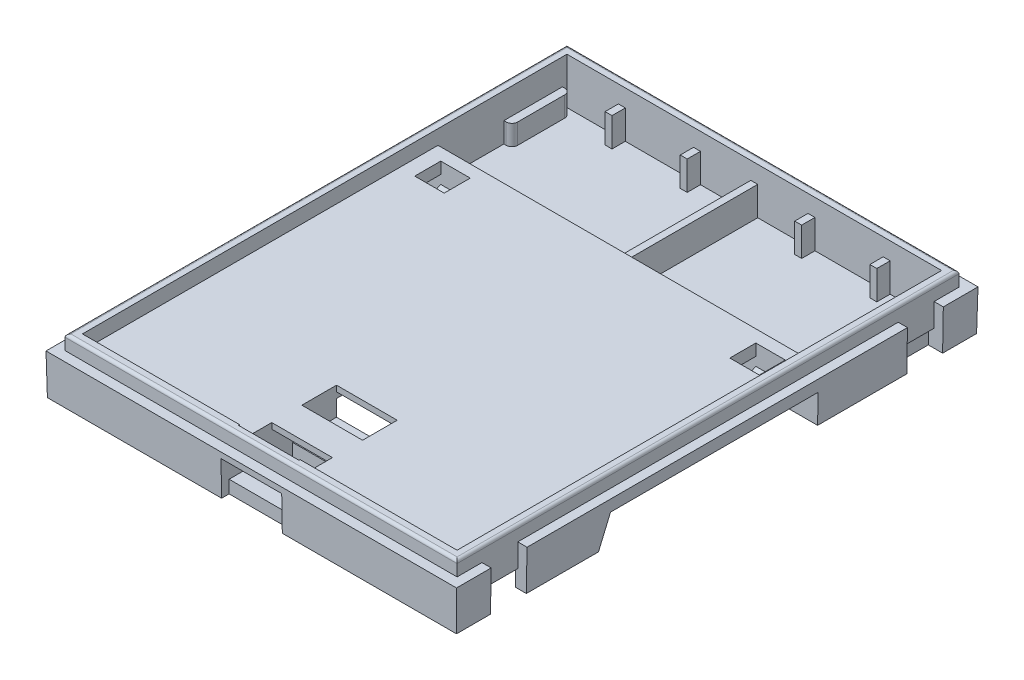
ISO-10303-21;
HEADER;
FILE_DESCRIPTION(('STEP AP214'),'2;1');
FILE_NAME('part.step','',(''),(''),'','','');
FILE_SCHEMA(('AUTOMOTIVE_DESIGN { 1 0 10303 214 1 1 1 1 }'));
ENDSEC;
DATA;
#1=APPLICATION_CONTEXT('core data for automotive mechanical design processes');
#2=APPLICATION_PROTOCOL_DEFINITION('international standard','automotive_design',2000,#1);
#3=PRODUCT_CONTEXT('',#1,'mechanical');
#4=PRODUCT('Part','Part','',(#3));
#5=PRODUCT_RELATED_PRODUCT_CATEGORY('part','',(#4));
#6=PRODUCT_DEFINITION_FORMATION('','',#4);
#7=PRODUCT_DEFINITION_CONTEXT('part definition',#1,'design');
#8=PRODUCT_DEFINITION('design','',#6,#7);
#9=PRODUCT_DEFINITION_SHAPE('','',#8);
#10=(LENGTH_UNIT() NAMED_UNIT(*) SI_UNIT(.MILLI.,.METRE.));
#11=(NAMED_UNIT(*) PLANE_ANGLE_UNIT() SI_UNIT($,.RADIAN.));
#12=(NAMED_UNIT(*) SI_UNIT($,.STERADIAN.) SOLID_ANGLE_UNIT());
#13=UNCERTAINTY_MEASURE_WITH_UNIT(LENGTH_MEASURE(1.E-05),#10,'distance_accuracy_value','');
#14=(GEOMETRIC_REPRESENTATION_CONTEXT(3) GLOBAL_UNCERTAINTY_ASSIGNED_CONTEXT((#13)) GLOBAL_UNIT_ASSIGNED_CONTEXT((#10,
#11,#12)) REPRESENTATION_CONTEXT('',''));
#15=CARTESIAN_POINT('',(0.,0.,0.));
#16=DIRECTION('',(0.,0.,1.));
#17=DIRECTION('',(1.,0.,0.));
#18=AXIS2_PLACEMENT_3D('',#15,#16,#17);
#19=CARTESIAN_POINT('',(0.,-0.5,-40.75));
#20=DIRECTION('',(0.,-1.,0.));
#21=DIRECTION('',(0.,0.,-1.));
#22=AXIS2_PLACEMENT_3D('',#19,#20,#21);
#23=PLANE('',#22);
#24=DIRECTION('',(1.,0.,0.));
#25=VECTOR('',#24,1.);
#26=CARTESIAN_POINT('',(0.,-0.5,-41.9));
#27=LINE('',#26,#25);
#28=CARTESIAN_POINT('',(9.30000000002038,-0.5,-41.9));
#29=VERTEX_POINT('',#28);
#30=CARTESIAN_POINT('',(10.5000000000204,-0.5,-41.9));
#31=VERTEX_POINT('',#30);
#32=EDGE_CURVE('E1579',#29,#31,#27,.T.);
#33=ORIENTED_EDGE('',*,*,#32,.F.);
#34=DIRECTION('',(0.,0.,1.));
#35=VECTOR('',#34,1.);
#36=CARTESIAN_POINT('',(9.30000000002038,-0.5,-41.9));
#37=LINE('',#36,#35);
#38=CARTESIAN_POINT('',(9.30000000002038,-0.5,-39.6));
#39=VERTEX_POINT('',#38);
#40=EDGE_CURVE('E1352',#39,#29,#37,.F.);
#41=ORIENTED_EDGE('',*,*,#40,.F.);
#42=DIRECTION('',(1.,0.,0.));
#43=VECTOR('',#42,1.);
#44=CARTESIAN_POINT('',(9.30000000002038,-0.5,-39.6));
#45=LINE('',#44,#43);
#46=CARTESIAN_POINT('',(10.5000000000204,-0.5,-39.6));
#47=VERTEX_POINT('',#46);
#48=EDGE_CURVE('E1575',#47,#39,#45,.F.);
#49=ORIENTED_EDGE('',*,*,#48,.F.);
#50=DIRECTION('',(0.,0.,-1.));
#51=VECTOR('',#50,1.);
#52=CARTESIAN_POINT('',(10.5000000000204,-0.5,-39.6));
#53=LINE('',#52,#51);
#54=EDGE_CURVE('E1360',#31,#47,#53,.F.);
#55=ORIENTED_EDGE('',*,*,#54,.F.);
#56=EDGE_LOOP('',(#33,#41,#49,#55));
#57=FACE_BOUND('',#56,.T.);
#58=ADVANCED_FACE('F16',(#57),#23,.F.);
#59=CARTESIAN_POINT('',(9.30000000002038,-5.5,-39.6));
#60=DIRECTION('',(0.,0.,1.));
#61=DIRECTION('',(1.,0.,0.));
#62=AXIS2_PLACEMENT_3D('',#59,#60,#61);
#63=PLANE('',#62);
#64=DIRECTION('',(1.,0.,0.));
#65=VECTOR('',#64,1.);
#66=CARTESIAN_POINT('',(9.30000000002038,-5.5,-39.6));
#67=LINE('',#66,#65);
#68=CARTESIAN_POINT('',(9.30000000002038,-5.5,-39.6));
#69=VERTEX_POINT('',#68);
#70=CARTESIAN_POINT('',(10.5000000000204,-5.5,-39.6));
#71=VERTEX_POINT('',#70);
#72=EDGE_CURVE('E1572',#69,#71,#67,.T.);
#73=ORIENTED_EDGE('',*,*,#72,.T.);
#74=DIRECTION('',(0.,1.,0.));
#75=VECTOR('',#74,1.);
#76=CARTESIAN_POINT('',(10.5000000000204,-5.5,-39.6));
#77=LINE('',#76,#75);
#78=EDGE_CURVE('E1356',#47,#71,#77,.F.);
#79=ORIENTED_EDGE('',*,*,#78,.F.);
#80=ORIENTED_EDGE('',*,*,#48,.T.);
#81=DIRECTION('',(0.,1.,0.));
#82=VECTOR('',#81,1.);
#83=CARTESIAN_POINT('',(9.30000000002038,-5.5,-39.6));
#84=LINE('',#83,#82);
#85=EDGE_CURVE('E1348',#69,#39,#84,.T.);
#86=ORIENTED_EDGE('',*,*,#85,.F.);
#87=EDGE_LOOP('',(#73,#79,#80,#86));
#88=FACE_BOUND('',#87,.T.);
#89=ADVANCED_FACE('F4294',(#88),#63,.T.);
#90=CARTESIAN_POINT('',(0.,-0.5,-40.75));
#91=DIRECTION('',(0.,-1.,0.));
#92=DIRECTION('',(0.,0.,-1.));
#93=AXIS2_PLACEMENT_3D('',#90,#91,#92);
#94=PLANE('',#93);
#95=DIRECTION('',(0.,0.,1.));
#96=VECTOR('',#95,1.);
#97=CARTESIAN_POINT('',(-10.5000000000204,-0.5,-41.9));
#98=LINE('',#97,#96);
#99=CARTESIAN_POINT('',(-10.5000000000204,-0.5,-39.6));
#100=VERTEX_POINT('',#99);
#101=CARTESIAN_POINT('',(-10.5000000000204,-0.5,-41.9));
#102=VERTEX_POINT('',#101);
#103=EDGE_CURVE('E1336',#100,#102,#98,.F.);
#104=ORIENTED_EDGE('',*,*,#103,.F.);
#105=DIRECTION('',(1.,0.,0.));
#106=VECTOR('',#105,1.);
#107=CARTESIAN_POINT('',(-10.5000000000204,-0.5,-39.6));
#108=LINE('',#107,#106);
#109=CARTESIAN_POINT('',(-9.30000000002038,-0.5,-39.6));
#110=VERTEX_POINT('',#109);
#111=EDGE_CURVE('E1565',#110,#100,#108,.F.);
#112=ORIENTED_EDGE('',*,*,#111,.F.);
#113=DIRECTION('',(0.,0.,-1.));
#114=VECTOR('',#113,1.);
#115=CARTESIAN_POINT('',(-9.30000000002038,-0.5,-39.6));
#116=LINE('',#115,#114);
#117=CARTESIAN_POINT('',(-9.30000000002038,-0.5,-41.9));
#118=VERTEX_POINT('',#117);
#119=EDGE_CURVE('E1344',#118,#110,#116,.F.);
#120=ORIENTED_EDGE('',*,*,#119,.F.);
#121=DIRECTION('',(1.,0.,0.));
#122=VECTOR('',#121,1.);
#123=CARTESIAN_POINT('',(0.,-0.5,-41.9));
#124=LINE('',#123,#122);
#125=EDGE_CURVE('E1569',#102,#118,#124,.T.);
#126=ORIENTED_EDGE('',*,*,#125,.F.);
#127=EDGE_LOOP('',(#104,#112,#120,#126));
#128=FACE_BOUND('',#127,.T.);
#129=ADVANCED_FACE('F4284',(#128),#94,.F.);
#130=CARTESIAN_POINT('',(-10.5000000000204,-5.5,-39.6));
#131=DIRECTION('',(0.,0.,1.));
#132=DIRECTION('',(1.,0.,0.));
#133=AXIS2_PLACEMENT_3D('',#130,#131,#132);
#134=PLANE('',#133);
#135=DIRECTION('',(1.,0.,0.));
#136=VECTOR('',#135,1.);
#137=CARTESIAN_POINT('',(-10.5000000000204,-5.5,-39.6));
#138=LINE('',#137,#136);
#139=CARTESIAN_POINT('',(-10.5000000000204,-5.5,-39.6));
#140=VERTEX_POINT('',#139);
#141=CARTESIAN_POINT('',(-9.30000000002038,-5.5,-39.6));
#142=VERTEX_POINT('',#141);
#143=EDGE_CURVE('E1562',#140,#142,#138,.T.);
#144=ORIENTED_EDGE('',*,*,#143,.T.);
#145=DIRECTION('',(0.,1.,0.));
#146=VECTOR('',#145,1.);
#147=CARTESIAN_POINT('',(-9.30000000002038,-5.5,-39.6));
#148=LINE('',#147,#146);
#149=EDGE_CURVE('E1340',#110,#142,#148,.F.);
#150=ORIENTED_EDGE('',*,*,#149,.F.);
#151=ORIENTED_EDGE('',*,*,#111,.T.);
#152=DIRECTION('',(0.,1.,0.));
#153=VECTOR('',#152,1.);
#154=CARTESIAN_POINT('',(-10.5000000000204,-5.5,-39.6));
#155=LINE('',#154,#153);
#156=EDGE_CURVE('E1332',#140,#100,#155,.T.);
#157=ORIENTED_EDGE('',*,*,#156,.F.);
#158=EDGE_LOOP('',(#144,#150,#151,#157));
#159=FACE_BOUND('',#158,.T.);
#160=ADVANCED_FACE('F4274',(#159),#134,.T.);
#161=CARTESIAN_POINT('',(6.3,-0.5,-40.75));
#162=DIRECTION('',(0.,-1.,0.));
#163=DIRECTION('',(0.,0.,-1.));
#164=AXIS2_PLACEMENT_3D('',#161,#162,#163);
#165=PLANE('',#164);
#166=DIRECTION('',(0.,0.,1.));
#167=VECTOR('',#166,1.);
#168=CARTESIAN_POINT('',(-23.5000000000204,-0.5,-41.9));
#169=LINE('',#168,#167);
#170=CARTESIAN_POINT('',(-23.5000000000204,-0.5,-39.6));
#171=VERTEX_POINT('',#170);
#172=CARTESIAN_POINT('',(-23.5000000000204,-0.5,-41.9));
#173=VERTEX_POINT('',#172);
#174=EDGE_CURVE('E1320',#171,#173,#169,.F.);
#175=ORIENTED_EDGE('',*,*,#174,.F.);
#176=DIRECTION('',(1.,0.,0.));
#177=VECTOR('',#176,1.);
#178=CARTESIAN_POINT('',(-23.5000000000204,-0.5,-39.6));
#179=LINE('',#178,#177);
#180=CARTESIAN_POINT('',(-22.3000000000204,-0.5,-39.6));
#181=VERTEX_POINT('',#180);
#182=EDGE_CURVE('E1555',#181,#171,#179,.F.);
#183=ORIENTED_EDGE('',*,*,#182,.F.);
#184=DIRECTION('',(0.,0.,-1.));
#185=VECTOR('',#184,1.);
#186=CARTESIAN_POINT('',(-22.3000000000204,-0.5,-39.6));
#187=LINE('',#186,#185);
#188=CARTESIAN_POINT('',(-22.3000000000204,-0.5,-41.9));
#189=VERTEX_POINT('',#188);
#190=EDGE_CURVE('E1328',#189,#181,#187,.F.);
#191=ORIENTED_EDGE('',*,*,#190,.F.);
#192=DIRECTION('',(1.,0.,0.));
#193=VECTOR('',#192,1.);
#194=CARTESIAN_POINT('',(6.3,-0.5,-41.9));
#195=LINE('',#194,#193);
#196=EDGE_CURVE('E1559',#173,#189,#195,.T.);
#197=ORIENTED_EDGE('',*,*,#196,.F.);
#198=EDGE_LOOP('',(#175,#183,#191,#197));
#199=FACE_BOUND('',#198,.T.);
#200=ADVANCED_FACE('F4264',(#199),#165,.F.);
#201=CARTESIAN_POINT('',(-23.5000000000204,-5.5,-39.6));
#202=DIRECTION('',(0.,0.,1.));
#203=DIRECTION('',(1.,0.,0.));
#204=AXIS2_PLACEMENT_3D('',#201,#202,#203);
#205=PLANE('',#204);
#206=DIRECTION('',(1.,0.,0.));
#207=VECTOR('',#206,1.);
#208=CARTESIAN_POINT('',(-23.5000000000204,-5.5,-39.6));
#209=LINE('',#208,#207);
#210=CARTESIAN_POINT('',(-23.5000000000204,-5.5,-39.6));
#211=VERTEX_POINT('',#210);
#212=CARTESIAN_POINT('',(-22.3000000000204,-5.5,-39.6));
#213=VERTEX_POINT('',#212);
#214=EDGE_CURVE('E1552',#211,#213,#209,.T.);
#215=ORIENTED_EDGE('',*,*,#214,.T.);
#216=DIRECTION('',(0.,1.,0.));
#217=VECTOR('',#216,1.);
#218=CARTESIAN_POINT('',(-22.3000000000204,-5.5,-39.6));
#219=LINE('',#218,#217);
#220=EDGE_CURVE('E1324',#181,#213,#219,.F.);
#221=ORIENTED_EDGE('',*,*,#220,.F.);
#222=ORIENTED_EDGE('',*,*,#182,.T.);
#223=DIRECTION('',(0.,1.,0.));
#224=VECTOR('',#223,1.);
#225=CARTESIAN_POINT('',(-23.5000000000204,-5.5,-39.6));
#226=LINE('',#225,#224);
#227=EDGE_CURVE('E1316',#211,#171,#226,.T.);
#228=ORIENTED_EDGE('',*,*,#227,.F.);
#229=EDGE_LOOP('',(#215,#221,#222,#228));
#230=FACE_BOUND('',#229,.T.);
#231=ADVANCED_FACE('F4254',(#230),#205,.T.);
#232=CARTESIAN_POINT('',(-6.3,-0.5,-40.75));
#233=DIRECTION('',(0.,-1.,0.));
#234=DIRECTION('',(0.,0.,-1.));
#235=AXIS2_PLACEMENT_3D('',#232,#233,#234);
#236=PLANE('',#235);
#237=DIRECTION('',(1.,0.,0.));
#238=VECTOR('',#237,1.);
#239=CARTESIAN_POINT('',(-6.3,-0.5,-41.9));
#240=LINE('',#239,#238);
#241=CARTESIAN_POINT('',(22.3000000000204,-0.5,-41.9));
#242=VERTEX_POINT('',#241);
#243=CARTESIAN_POINT('',(23.5000000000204,-0.5,-41.9));
#244=VERTEX_POINT('',#243);
#245=EDGE_CURVE('E1549',#242,#244,#240,.T.);
#246=ORIENTED_EDGE('',*,*,#245,.F.);
#247=DIRECTION('',(0.,0.,1.));
#248=VECTOR('',#247,1.);
#249=CARTESIAN_POINT('',(22.3000000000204,-0.5,-41.9));
#250=LINE('',#249,#248);
#251=CARTESIAN_POINT('',(22.3000000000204,-0.5,-39.6));
#252=VERTEX_POINT('',#251);
#253=EDGE_CURVE('E1368',#252,#242,#250,.F.);
#254=ORIENTED_EDGE('',*,*,#253,.F.);
#255=DIRECTION('',(1.,0.,0.));
#256=VECTOR('',#255,1.);
#257=CARTESIAN_POINT('',(22.3000000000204,-0.5,-39.6));
#258=LINE('',#257,#256);
#259=CARTESIAN_POINT('',(23.5000000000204,-0.5,-39.6));
#260=VERTEX_POINT('',#259);
#261=EDGE_CURVE('E1545',#260,#252,#258,.F.);
#262=ORIENTED_EDGE('',*,*,#261,.F.);
#263=DIRECTION('',(0.,0.,-1.));
#264=VECTOR('',#263,1.);
#265=CARTESIAN_POINT('',(23.5000000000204,-0.5,-39.6));
#266=LINE('',#265,#264);
#267=EDGE_CURVE('E1312',#244,#260,#266,.F.);
#268=ORIENTED_EDGE('',*,*,#267,.F.);
#269=EDGE_LOOP('',(#246,#254,#262,#268));
#270=FACE_BOUND('',#269,.T.);
#271=ADVANCED_FACE('F4244',(#270),#236,.F.);
#272=CARTESIAN_POINT('',(22.3000000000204,-5.5,-39.6));
#273=DIRECTION('',(0.,0.,1.));
#274=DIRECTION('',(1.,0.,0.));
#275=AXIS2_PLACEMENT_3D('',#272,#273,#274);
#276=PLANE('',#275);
#277=DIRECTION('',(1.,0.,0.));
#278=VECTOR('',#277,1.);
#279=CARTESIAN_POINT('',(22.3000000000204,-5.5,-39.6));
#280=LINE('',#279,#278);
#281=CARTESIAN_POINT('',(22.3000000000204,-5.5,-39.6));
#282=VERTEX_POINT('',#281);
#283=CARTESIAN_POINT('',(23.5000000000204,-5.5,-39.6));
#284=VERTEX_POINT('',#283);
#285=EDGE_CURVE('E919',#282,#284,#280,.T.);
#286=ORIENTED_EDGE('',*,*,#285,.T.);
#287=DIRECTION('',(0.,1.,0.));
#288=VECTOR('',#287,1.);
#289=CARTESIAN_POINT('',(23.5000000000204,-5.5,-39.6));
#290=LINE('',#289,#288);
#291=EDGE_CURVE('E1084',#260,#284,#290,.F.);
#292=ORIENTED_EDGE('',*,*,#291,.F.);
#293=ORIENTED_EDGE('',*,*,#261,.T.);
#294=DIRECTION('',(0.,1.,0.));
#295=VECTOR('',#294,1.);
#296=CARTESIAN_POINT('',(22.3000000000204,-5.5,-39.6));
#297=LINE('',#296,#295);
#298=EDGE_CURVE('E1364',#282,#252,#297,.T.);
#299=ORIENTED_EDGE('',*,*,#298,.F.);
#300=EDGE_LOOP('',(#286,#292,#293,#299));
#301=FACE_BOUND('',#300,.T.);
#302=ADVANCED_FACE('F4234',(#301),#276,.T.);
#303=CARTESIAN_POINT('',(40.2000000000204,0.,-43.3999999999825));
#304=DIRECTION('',(0.,0.,-1.));
#305=DIRECTION('',(-1.,0.,0.));
#306=AXIS2_PLACEMENT_3D('',#303,#304,#305);
#307=PLANE('',#306);
#308=DIRECTION('',(1.,0.,0.));
#309=VECTOR('',#308,1.);
#310=CARTESIAN_POINT('',(0.,0.,-43.3999999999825));
#311=LINE('',#310,#309);
#312=CARTESIAN_POINT('',(-33.9000000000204,0.,-43.3999999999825));
#313=VERTEX_POINT('',#312);
#314=CARTESIAN_POINT('',(33.9000000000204,0.,-43.3999999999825));
#315=VERTEX_POINT('',#314);
#316=EDGE_CURVE('E1470',#313,#315,#311,.T.);
#317=ORIENTED_EDGE('',*,*,#316,.F.);
#318=DIRECTION('',(0.,1.,0.));
#319=VECTOR('',#318,1.);
#320=CARTESIAN_POINT('',(-33.9000000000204,0.,-43.3999999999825));
#321=LINE('',#320,#319);
#322=CARTESIAN_POINT('',(-33.9000000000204,2.,-43.3999999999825));
#323=VERTEX_POINT('',#322);
#324=EDGE_CURVE('E1469',#323,#313,#321,.F.);
#325=ORIENTED_EDGE('',*,*,#324,.F.);
#326=DIRECTION('',(-1.,0.,0.));
#327=VECTOR('',#326,1.);
#328=CARTESIAN_POINT('',(20.1000000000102,2.,-43.3999999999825));
#329=LINE('',#328,#327);
#330=CARTESIAN_POINT('',(33.9000000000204,2.,-43.3999999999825));
#331=VERTEX_POINT('',#330);
#332=EDGE_CURVE('E1074',#331,#323,#329,.T.);
#333=ORIENTED_EDGE('',*,*,#332,.F.);
#334=DIRECTION('',(0.,1.,0.));
#335=VECTOR('',#334,1.);
#336=CARTESIAN_POINT('',(33.9000000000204,0.,-43.3999999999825));
#337=LINE('',#336,#335);
#338=EDGE_CURVE('E1095',#315,#331,#337,.T.);
#339=ORIENTED_EDGE('',*,*,#338,.F.);
#340=EDGE_LOOP('',(#317,#325,#333,#339));
#341=FACE_BOUND('',#340,.T.);
#342=ADVANCED_FACE('F4225',(#341),#307,.T.);
#343=CARTESIAN_POINT('',(31.6422859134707,-4.,41.1261222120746));
#344=DIRECTION('',(0.,0.,1.));
#345=DIRECTION('',(1.,0.,0.));
#346=AXIS2_PLACEMENT_3D('',#343,#344,#345);
#347=PLANE('',#346);
#348=DIRECTION('',(0.,1.,0.));
#349=VECTOR('',#348,1.);
#350=CARTESIAN_POINT('',(33.5,-7.,41.1261222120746));
#351=LINE('',#350,#349);
#352=CARTESIAN_POINT('',(33.5,-4.,41.1261222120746));
#353=VERTEX_POINT('',#352);
#354=CARTESIAN_POINT('',(33.5,-2.,41.1261222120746));
#355=VERTEX_POINT('',#354);
#356=EDGE_CURVE('E914',#353,#355,#351,.T.);
#357=ORIENTED_EDGE('',*,*,#356,.T.);
#358=DIRECTION('',(1.,0.,0.));
#359=VECTOR('',#358,1.);
#360=CARTESIAN_POINT('',(31.6422859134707,-2.,41.1261222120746));
#361=LINE('',#360,#359);
#362=CARTESIAN_POINT('',(32.6422859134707,-2.,41.1261222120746));
#363=VERTEX_POINT('',#362);
#364=EDGE_CURVE('E907',#355,#363,#361,.F.);
#365=ORIENTED_EDGE('',*,*,#364,.T.);
#366=DIRECTION('',(0.,1.,0.));
#367=VECTOR('',#366,1.);
#368=CARTESIAN_POINT('',(32.6422859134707,-4.,41.1261222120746));
#369=LINE('',#368,#367);
#370=CARTESIAN_POINT('',(32.6422859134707,-4.,41.1261222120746));
#371=VERTEX_POINT('',#370);
#372=EDGE_CURVE('E911',#371,#363,#369,.T.);
#373=ORIENTED_EDGE('',*,*,#372,.F.);
#374=DIRECTION('',(1.,0.,0.));
#375=VECTOR('',#374,1.);
#376=CARTESIAN_POINT('',(34.2000000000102,-4.,41.1261222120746));
#377=LINE('',#376,#375);
#378=EDGE_CURVE('E976',#371,#353,#377,.T.);
#379=ORIENTED_EDGE('',*,*,#378,.T.);
#380=EDGE_LOOP('',(#357,#365,#373,#379));
#381=FACE_BOUND('',#380,.T.);
#382=ADVANCED_FACE('F909',(#381),#347,.T.);
#383=CARTESIAN_POINT('',(-33.5,-4.,41.1261222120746));
#384=DIRECTION('',(0.,0.,1.));
#385=DIRECTION('',(1.,0.,0.));
#386=AXIS2_PLACEMENT_3D('',#383,#384,#385);
#387=PLANE('',#386);
#388=DIRECTION('',(0.,1.,0.));
#389=VECTOR('',#388,1.);
#390=CARTESIAN_POINT('',(-33.5,-7.,41.1261222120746));
#391=LINE('',#390,#389);
#392=CARTESIAN_POINT('',(-33.5,-2.,41.1261222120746));
#393=VERTEX_POINT('',#392);
#394=CARTESIAN_POINT('',(-33.5,-4.,41.1261222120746));
#395=VERTEX_POINT('',#394);
#396=EDGE_CURVE('E990',#393,#395,#391,.F.);
#397=ORIENTED_EDGE('',*,*,#396,.T.);
#398=DIRECTION('',(1.,0.,0.));
#399=VECTOR('',#398,1.);
#400=CARTESIAN_POINT('',(-34.2000000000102,-4.,41.1261222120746));
#401=LINE('',#400,#399);
#402=CARTESIAN_POINT('',(-32.6422859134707,-4.,41.1261222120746));
#403=VERTEX_POINT('',#402);
#404=EDGE_CURVE('E1108',#395,#403,#401,.T.);
#405=ORIENTED_EDGE('',*,*,#404,.T.);
#406=DIRECTION('',(0.,1.,0.));
#407=VECTOR('',#406,1.);
#408=CARTESIAN_POINT('',(-32.6422859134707,-4.,41.1261222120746));
#409=LINE('',#408,#407);
#410=CARTESIAN_POINT('',(-32.6422859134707,-2.,41.1261222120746));
#411=VERTEX_POINT('',#410);
#412=EDGE_CURVE('E1113',#411,#403,#409,.F.);
#413=ORIENTED_EDGE('',*,*,#412,.F.);
#414=DIRECTION('',(1.,0.,0.));
#415=VECTOR('',#414,1.);
#416=CARTESIAN_POINT('',(-33.5,-2.,41.1261222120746));
#417=LINE('',#416,#415);
#418=EDGE_CURVE('E918',#411,#393,#417,.F.);
#419=ORIENTED_EDGE('',*,*,#418,.T.);
#420=EDGE_LOOP('',(#397,#405,#413,#419));
#421=FACE_BOUND('',#420,.T.);
#422=ADVANCED_FACE('F4206',(#421),#387,.T.);
#423=CARTESIAN_POINT('',(-40.2000000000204,0.,43.3999999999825));
#424=DIRECTION('',(0.,0.,1.));
#425=DIRECTION('',(1.,0.,0.));
#426=AXIS2_PLACEMENT_3D('',#423,#424,#425);
#427=PLANE('',#426);
#428=DIRECTION('',(1.,0.,0.));
#429=VECTOR('',#428,1.);
#430=CARTESIAN_POINT('',(0.,0.,43.3999999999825));
#431=LINE('',#430,#429);
#432=CARTESIAN_POINT('',(33.9000000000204,0.,43.3999999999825));
#433=VERTEX_POINT('',#432);
#434=CARTESIAN_POINT('',(-33.9000000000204,0.,43.3999999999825));
#435=VERTEX_POINT('',#434);
#436=EDGE_CURVE('E1604',#433,#435,#431,.F.);
#437=ORIENTED_EDGE('',*,*,#436,.F.);
#438=DIRECTION('',(0.,1.,0.));
#439=VECTOR('',#438,1.);
#440=CARTESIAN_POINT('',(33.9000000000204,0.,43.3999999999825));
#441=LINE('',#440,#439);
#442=CARTESIAN_POINT('',(33.9000000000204,2.,43.3999999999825));
#443=VERTEX_POINT('',#442);
#444=EDGE_CURVE('E1455',#443,#433,#441,.F.);
#445=ORIENTED_EDGE('',*,*,#444,.F.);
#446=DIRECTION('',(1.,0.,0.));
#447=VECTOR('',#446,1.);
#448=CARTESIAN_POINT('',(-20.1000000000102,2.,43.3999999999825));
#449=LINE('',#448,#447);
#450=CARTESIAN_POINT('',(-33.9000000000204,2.,43.3999999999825));
#451=VERTEX_POINT('',#450);
#452=EDGE_CURVE('E995',#451,#443,#449,.T.);
#453=ORIENTED_EDGE('',*,*,#452,.F.);
#454=DIRECTION('',(0.,1.,0.));
#455=VECTOR('',#454,1.);
#456=CARTESIAN_POINT('',(-33.9000000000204,0.,43.3999999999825));
#457=LINE('',#456,#455);
#458=EDGE_CURVE('E1460',#435,#451,#457,.T.);
#459=ORIENTED_EDGE('',*,*,#458,.F.);
#460=EDGE_LOOP('',(#437,#445,#453,#459));
#461=FACE_BOUND('',#460,.T.);
#462=ADVANCED_FACE('F4197',(#461),#427,.T.);
#463=CARTESIAN_POINT('',(32.6422859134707,-4.,40.1261222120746));
#464=DIRECTION('',(0.,1.,0.));
#465=DIRECTION('',(0.,0.,1.));
#466=AXIS2_PLACEMENT_3D('',#463,#464,#465);
#467=CYLINDRICAL_SURFACE('',#466,1.);
#468=CARTESIAN_POINT('',(32.6422859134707,-2.,40.1261222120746));
#469=DIRECTION('',(0.,1.,0.));
#470=DIRECTION('',(0.,0.,1.));
#471=AXIS2_PLACEMENT_3D('',#468,#469,#470);
#472=CIRCLE('',#471,1.);
#473=CARTESIAN_POINT('',(31.6422859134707,-2.,40.1261222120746));
#474=VERTEX_POINT('',#473);
#475=EDGE_CURVE('E19',#363,#474,#472,.F.);
#476=ORIENTED_EDGE('',*,*,#475,.T.);
#477=DIRECTION('',(0.,1.,0.));
#478=VECTOR('',#477,1.);
#479=CARTESIAN_POINT('',(31.6422859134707,-4.,40.1261222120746));
#480=LINE('',#479,#478);
#481=CARTESIAN_POINT('',(31.6422859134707,-4.,40.1261222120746));
#482=VERTEX_POINT('',#481);
#483=EDGE_CURVE('E1148',#482,#474,#480,.T.);
#484=ORIENTED_EDGE('',*,*,#483,.F.);
#485=CARTESIAN_POINT('',(32.6422859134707,-4.,40.1261222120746));
#486=DIRECTION('',(0.,1.,0.));
#487=DIRECTION('',(0.,0.,1.));
#488=AXIS2_PLACEMENT_3D('',#485,#486,#487);
#489=CIRCLE('',#488,1.);
#490=EDGE_CURVE('E932',#482,#371,#489,.T.);
#491=ORIENTED_EDGE('',*,*,#490,.T.);
#492=ORIENTED_EDGE('',*,*,#372,.T.);
#493=EDGE_LOOP('',(#476,#484,#491,#492));
#494=FACE_BOUND('',#493,.T.);
#495=ADVANCED_FACE('F930',(#494),#467,.T.);
#496=CARTESIAN_POINT('',(32.6422859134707,-4.,31.990558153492));
#497=DIRECTION('',(0.,1.,0.));
#498=DIRECTION('',(0.,0.,1.));
#499=AXIS2_PLACEMENT_3D('',#496,#497,#498);
#500=CYLINDRICAL_SURFACE('',#499,1.);
#501=CARTESIAN_POINT('',(32.6422859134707,-2.,31.990558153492));
#502=DIRECTION('',(0.,1.,0.));
#503=DIRECTION('',(0.,0.,1.));
#504=AXIS2_PLACEMENT_3D('',#501,#502,#503);
#505=CIRCLE('',#504,1.);
#506=CARTESIAN_POINT('',(31.6422859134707,-2.,31.990558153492));
#507=VERTEX_POINT('',#506);
#508=CARTESIAN_POINT('',(32.6422859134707,-2.,30.990558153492));
#509=VERTEX_POINT('',#508);
#510=EDGE_CURVE('E929',#507,#509,#505,.F.);
#511=ORIENTED_EDGE('',*,*,#510,.T.);
#512=DIRECTION('',(0.,1.,0.));
#513=VECTOR('',#512,1.);
#514=CARTESIAN_POINT('',(32.6422859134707,-4.,30.990558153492));
#515=LINE('',#514,#513);
#516=CARTESIAN_POINT('',(32.6422859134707,-4.,30.990558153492));
#517=VERTEX_POINT('',#516);
#518=EDGE_CURVE('E944',#517,#509,#515,.T.);
#519=ORIENTED_EDGE('',*,*,#518,.F.);
#520=CARTESIAN_POINT('',(32.6422859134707,-4.,31.990558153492));
#521=DIRECTION('',(0.,1.,0.));
#522=DIRECTION('',(0.,0.,1.));
#523=AXIS2_PLACEMENT_3D('',#520,#521,#522);
#524=CIRCLE('',#523,1.);
#525=CARTESIAN_POINT('',(31.6422859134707,-4.,31.990558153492));
#526=VERTEX_POINT('',#525);
#527=EDGE_CURVE('E1117',#517,#526,#524,.T.);
#528=ORIENTED_EDGE('',*,*,#527,.T.);
#529=DIRECTION('',(0.,1.,0.));
#530=VECTOR('',#529,1.);
#531=CARTESIAN_POINT('',(31.6422859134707,-4.,31.990558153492));
#532=LINE('',#531,#530);
#533=EDGE_CURVE('E1127',#507,#526,#532,.F.);
#534=ORIENTED_EDGE('',*,*,#533,.F.);
#535=EDGE_LOOP('',(#511,#519,#528,#534));
#536=FACE_BOUND('',#535,.T.);
#537=ADVANCED_FACE('F1124',(#536),#500,.T.);
#538=CARTESIAN_POINT('',(33.5,-4.,30.990558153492));
#539=DIRECTION('',(0.,0.,-1.));
#540=DIRECTION('',(-1.,0.,0.));
#541=AXIS2_PLACEMENT_3D('',#538,#539,#540);
#542=PLANE('',#541);
#543=DIRECTION('',(0.,1.,0.));
#544=VECTOR('',#543,1.);
#545=CARTESIAN_POINT('',(33.5,-7.,30.990558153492));
#546=LINE('',#545,#544);
#547=CARTESIAN_POINT('',(33.5,-2.,30.990558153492));
#548=VERTEX_POINT('',#547);
#549=CARTESIAN_POINT('',(33.5,-4.,30.990558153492));
#550=VERTEX_POINT('',#549);
#551=EDGE_CURVE('E949',#548,#550,#546,.F.);
#552=ORIENTED_EDGE('',*,*,#551,.T.);
#553=DIRECTION('',(1.,0.,0.));
#554=VECTOR('',#553,1.);
#555=CARTESIAN_POINT('',(34.2000000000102,-4.,30.990558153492));
#556=LINE('',#555,#554);
#557=EDGE_CURVE('E1119',#550,#517,#556,.F.);
#558=ORIENTED_EDGE('',*,*,#557,.T.);
#559=ORIENTED_EDGE('',*,*,#518,.T.);
#560=DIRECTION('',(-1.,0.,0.));
#561=VECTOR('',#560,1.);
#562=CARTESIAN_POINT('',(33.5,-2.,30.990558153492));
#563=LINE('',#562,#561);
#564=EDGE_CURVE('E948',#509,#548,#563,.F.);
#565=ORIENTED_EDGE('',*,*,#564,.T.);
#566=EDGE_LOOP('',(#552,#558,#559,#565));
#567=FACE_BOUND('',#566,.T.);
#568=ADVANCED_FACE('F1132',(#567),#542,.T.);
#569=CARTESIAN_POINT('',(34.2000000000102,-4.,36.));
#570=DIRECTION('',(0.,1.,0.));
#571=DIRECTION('',(0.,0.,1.));
#572=AXIS2_PLACEMENT_3D('',#569,#570,#571);
#573=PLANE('',#572);
#574=DIRECTION('',(0.,0.,1.));
#575=VECTOR('',#574,1.);
#576=CARTESIAN_POINT('',(31.6422859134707,-4.,30.990558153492));
#577=LINE('',#576,#575);
#578=EDGE_CURVE('E953',#526,#482,#577,.T.);
#579=ORIENTED_EDGE('',*,*,#578,.F.);
#580=ORIENTED_EDGE('',*,*,#527,.F.);
#581=ORIENTED_EDGE('',*,*,#557,.F.);
#582=DIRECTION('',(0.,0.,-1.));
#583=VECTOR('',#582,1.);
#584=CARTESIAN_POINT('',(33.5,-4.,41.9778145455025));
#585=LINE('',#584,#583);
#586=CARTESIAN_POINT('',(33.5,-4.,32.9));
#587=VERTEX_POINT('',#586);
#588=EDGE_CURVE('E952',#550,#587,#585,.F.);
#589=ORIENTED_EDGE('',*,*,#588,.T.);
#590=DIRECTION('',(1.,0.,0.));
#591=VECTOR('',#590,1.);
#592=CARTESIAN_POINT('',(34.2000000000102,-4.,32.9));
#593=LINE('',#592,#591);
#594=CARTESIAN_POINT('',(33.9000000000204,-4.,32.9));
#595=VERTEX_POINT('',#594);
#596=EDGE_CURVE('E1138',#595,#587,#593,.F.);
#597=ORIENTED_EDGE('',*,*,#596,.F.);
#598=DIRECTION('',(0.,0.,-1.));
#599=VECTOR('',#598,1.);
#600=CARTESIAN_POINT('',(33.9000000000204,-4.,43.3999999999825));
#601=LINE('',#600,#599);
#602=CARTESIAN_POINT('',(33.9000000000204,-4.,39.1));
#603=VERTEX_POINT('',#602);
#604=EDGE_CURVE('E1451',#603,#595,#601,.T.);
#605=ORIENTED_EDGE('',*,*,#604,.F.);
#606=DIRECTION('',(1.,0.,0.));
#607=VECTOR('',#606,1.);
#608=CARTESIAN_POINT('',(35.5,-4.,39.1));
#609=LINE('',#608,#607);
#610=CARTESIAN_POINT('',(33.5,-4.,39.1));
#611=VERTEX_POINT('',#610);
#612=EDGE_CURVE('E1204',#603,#611,#609,.F.);
#613=ORIENTED_EDGE('',*,*,#612,.T.);
#614=DIRECTION('',(0.,0.,-1.));
#615=VECTOR('',#614,1.);
#616=CARTESIAN_POINT('',(33.5,-4.,41.9778145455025));
#617=LINE('',#616,#615);
#618=EDGE_CURVE('E962',#611,#353,#617,.F.);
#619=ORIENTED_EDGE('',*,*,#618,.T.);
#620=ORIENTED_EDGE('',*,*,#378,.F.);
#621=ORIENTED_EDGE('',*,*,#490,.F.);
#622=EDGE_LOOP('',(#579,#580,#581,#589,#597,#605,#613,#619,#620,#621));
#623=FACE_BOUND('',#622,.T.);
#624=ADVANCED_FACE('F1141',(#623),#573,.F.);
#625=CARTESIAN_POINT('',(-31.6422859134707,-4.,30.990558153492));
#626=DIRECTION('',(0.,0.,-1.));
#627=DIRECTION('',(-1.,0.,0.));
#628=AXIS2_PLACEMENT_3D('',#625,#626,#627);
#629=PLANE('',#628);
#630=DIRECTION('',(0.,1.,0.));
#631=VECTOR('',#630,1.);
#632=CARTESIAN_POINT('',(-33.5,-7.,30.990558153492));
#633=LINE('',#632,#631);
#634=CARTESIAN_POINT('',(-33.5,-4.,30.990558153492));
#635=VERTEX_POINT('',#634);
#636=CARTESIAN_POINT('',(-33.5,-2.,30.990558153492));
#637=VERTEX_POINT('',#636);
#638=EDGE_CURVE('E1648',#635,#637,#633,.T.);
#639=ORIENTED_EDGE('',*,*,#638,.T.);
#640=DIRECTION('',(-1.,0.,0.));
#641=VECTOR('',#640,1.);
#642=CARTESIAN_POINT('',(-31.6422859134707,-2.,30.990558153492));
#643=LINE('',#642,#641);
#644=CARTESIAN_POINT('',(-32.6422859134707,-2.,30.990558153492));
#645=VERTEX_POINT('',#644);
#646=EDGE_CURVE('E1114',#637,#645,#643,.F.);
#647=ORIENTED_EDGE('',*,*,#646,.T.);
#648=DIRECTION('',(0.,1.,0.));
#649=VECTOR('',#648,1.);
#650=CARTESIAN_POINT('',(-32.6422859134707,-4.,30.990558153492));
#651=LINE('',#650,#649);
#652=CARTESIAN_POINT('',(-32.6422859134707,-4.,30.990558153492));
#653=VERTEX_POINT('',#652);
#654=EDGE_CURVE('E1100',#653,#645,#651,.T.);
#655=ORIENTED_EDGE('',*,*,#654,.F.);
#656=DIRECTION('',(1.,0.,0.));
#657=VECTOR('',#656,1.);
#658=CARTESIAN_POINT('',(-34.2000000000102,-4.,30.990558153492));
#659=LINE('',#658,#657);
#660=EDGE_CURVE('E1511',#653,#635,#659,.F.);
#661=ORIENTED_EDGE('',*,*,#660,.T.);
#662=EDGE_LOOP('',(#639,#647,#655,#661));
#663=FACE_BOUND('',#662,.T.);
#664=ADVANCED_FACE('F2178',(#663),#629,.T.);
#665=CARTESIAN_POINT('',(-32.6422859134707,-4.,40.1261222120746));
#666=DIRECTION('',(0.,1.,0.));
#667=DIRECTION('',(0.,0.,1.));
#668=AXIS2_PLACEMENT_3D('',#665,#666,#667);
#669=CYLINDRICAL_SURFACE('',#668,1.);
#670=CARTESIAN_POINT('',(-32.6422859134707,-2.,40.1261222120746));
#671=DIRECTION('',(0.,1.,0.));
#672=DIRECTION('',(0.,0.,1.));
#673=AXIS2_PLACEMENT_3D('',#670,#671,#672);
#674=CIRCLE('',#673,1.);
#675=CARTESIAN_POINT('',(-31.6422859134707,-2.,40.1261222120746));
#676=VERTEX_POINT('',#675);
#677=EDGE_CURVE('E1109',#676,#411,#674,.F.);
#678=ORIENTED_EDGE('',*,*,#677,.T.);
#679=ORIENTED_EDGE('',*,*,#412,.T.);
#680=CARTESIAN_POINT('',(-32.6422859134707,-4.,40.1261222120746));
#681=DIRECTION('',(0.,1.,0.));
#682=DIRECTION('',(0.,0.,1.));
#683=AXIS2_PLACEMENT_3D('',#680,#681,#682);
#684=CIRCLE('',#683,1.);
#685=CARTESIAN_POINT('',(-31.6422859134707,-4.,40.1261222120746));
#686=VERTEX_POINT('',#685);
#687=EDGE_CURVE('E1105',#403,#686,#684,.T.);
#688=ORIENTED_EDGE('',*,*,#687,.T.);
#689=DIRECTION('',(0.,1.,0.));
#690=VECTOR('',#689,1.);
#691=CARTESIAN_POINT('',(-31.6422859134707,-4.,40.1261222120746));
#692=LINE('',#691,#690);
#693=EDGE_CURVE('E1508',#676,#686,#692,.F.);
#694=ORIENTED_EDGE('',*,*,#693,.F.);
#695=EDGE_LOOP('',(#678,#679,#688,#694));
#696=FACE_BOUND('',#695,.T.);
#697=ADVANCED_FACE('F4147',(#696),#669,.T.);
#698=CARTESIAN_POINT('',(-34.2000000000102,-4.,36.));
#699=DIRECTION('',(0.,1.,0.));
#700=DIRECTION('',(0.,0.,1.));
#701=AXIS2_PLACEMENT_3D('',#698,#699,#700);
#702=PLANE('',#701);
#703=ORIENTED_EDGE('',*,*,#404,.F.);
#704=DIRECTION('',(0.,0.,1.));
#705=VECTOR('',#704,1.);
#706=CARTESIAN_POINT('',(-33.5,-4.,18.4221854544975));
#707=LINE('',#706,#705);
#708=CARTESIAN_POINT('',(-33.5,-4.,39.1));
#709=VERTEX_POINT('',#708);
#710=EDGE_CURVE('E971',#395,#709,#707,.F.);
#711=ORIENTED_EDGE('',*,*,#710,.T.);
#712=DIRECTION('',(1.,0.,0.));
#713=VECTOR('',#712,1.);
#714=CARTESIAN_POINT('',(-33.9000000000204,-4.,39.1));
#715=LINE('',#714,#713);
#716=CARTESIAN_POINT('',(-33.9000000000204,-4.,39.1));
#717=VERTEX_POINT('',#716);
#718=EDGE_CURVE('E1210',#709,#717,#715,.F.);
#719=ORIENTED_EDGE('',*,*,#718,.T.);
#720=DIRECTION('',(0.,0.,1.));
#721=VECTOR('',#720,1.);
#722=CARTESIAN_POINT('',(-33.9000000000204,-4.,-43.3999999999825));
#723=LINE('',#722,#721);
#724=CARTESIAN_POINT('',(-33.9000000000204,-4.,32.9));
#725=VERTEX_POINT('',#724);
#726=EDGE_CURVE('E1456',#725,#717,#723,.T.);
#727=ORIENTED_EDGE('',*,*,#726,.F.);
#728=DIRECTION('',(-1.,0.,0.));
#729=VECTOR('',#728,1.);
#730=CARTESIAN_POINT('',(-35.5,-4.,32.9));
#731=LINE('',#730,#729);
#732=CARTESIAN_POINT('',(-33.5,-4.,32.9));
#733=VERTEX_POINT('',#732);
#734=EDGE_CURVE('E1169',#725,#733,#731,.F.);
#735=ORIENTED_EDGE('',*,*,#734,.T.);
#736=DIRECTION('',(0.,0.,1.));
#737=VECTOR('',#736,1.);
#738=CARTESIAN_POINT('',(-33.5,-4.,18.4221854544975));
#739=LINE('',#738,#737);
#740=EDGE_CURVE('E1644',#733,#635,#739,.F.);
#741=ORIENTED_EDGE('',*,*,#740,.T.);
#742=ORIENTED_EDGE('',*,*,#660,.F.);
#743=CARTESIAN_POINT('',(-32.6422859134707,-4.,31.990558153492));
#744=DIRECTION('',(0.,1.,0.));
#745=DIRECTION('',(0.,0.,1.));
#746=AXIS2_PLACEMENT_3D('',#743,#744,#745);
#747=CIRCLE('',#746,1.);
#748=CARTESIAN_POINT('',(-31.6422859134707,-4.,31.990558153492));
#749=VERTEX_POINT('',#748);
#750=EDGE_CURVE('E1101',#749,#653,#747,.T.);
#751=ORIENTED_EDGE('',*,*,#750,.F.);
#752=DIRECTION('',(0.,0.,-1.));
#753=VECTOR('',#752,1.);
#754=CARTESIAN_POINT('',(-31.6422859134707,-4.,41.1261222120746));
#755=LINE('',#754,#753);
#756=EDGE_CURVE('E1503',#686,#749,#755,.T.);
#757=ORIENTED_EDGE('',*,*,#756,.F.);
#758=ORIENTED_EDGE('',*,*,#687,.F.);
#759=EDGE_LOOP('',(#703,#711,#719,#727,#735,#741,#742,#751,#757,#758));
#760=FACE_BOUND('',#759,.T.);
#761=ADVANCED_FACE('F2183',(#760),#702,.F.);
#762=CARTESIAN_POINT('',(-32.6422859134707,-4.,31.990558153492));
#763=DIRECTION('',(0.,1.,0.));
#764=DIRECTION('',(0.,0.,1.));
#765=AXIS2_PLACEMENT_3D('',#762,#763,#764);
#766=CYLINDRICAL_SURFACE('',#765,1.);
#767=CARTESIAN_POINT('',(-32.6422859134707,-2.,31.990558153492));
#768=DIRECTION('',(0.,1.,0.));
#769=DIRECTION('',(0.,0.,1.));
#770=AXIS2_PLACEMENT_3D('',#767,#768,#769);
#771=CIRCLE('',#770,1.);
#772=CARTESIAN_POINT('',(-31.6422859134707,-2.,31.990558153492));
#773=VERTEX_POINT('',#772);
#774=EDGE_CURVE('E1096',#645,#773,#771,.F.);
#775=ORIENTED_EDGE('',*,*,#774,.T.);
#776=DIRECTION('',(0.,1.,0.));
#777=VECTOR('',#776,1.);
#778=CARTESIAN_POINT('',(-31.6422859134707,-4.,31.990558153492));
#779=LINE('',#778,#777);
#780=EDGE_CURVE('E1507',#749,#773,#779,.T.);
#781=ORIENTED_EDGE('',*,*,#780,.F.);
#782=ORIENTED_EDGE('',*,*,#750,.T.);
#783=ORIENTED_EDGE('',*,*,#654,.T.);
#784=EDGE_LOOP('',(#775,#781,#782,#783));
#785=FACE_BOUND('',#784,.T.);
#786=ADVANCED_FACE('F4128',(#785),#766,.T.);
#787=CARTESIAN_POINT('',(0.,-2.5,-14.0778145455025));
#788=DIRECTION('',(0.,-1.,0.));
#789=DIRECTION('',(0.,0.,-1.));
#790=AXIS2_PLACEMENT_3D('',#787,#788,#789);
#791=PLANE('',#790);
#792=DIRECTION('',(1.,0.,0.));
#793=VECTOR('',#792,1.);
#794=CARTESIAN_POINT('',(19.3233609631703,-2.5,-13.0778145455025));
#795=LINE('',#794,#793);
#796=CARTESIAN_POINT('',(-13.0233609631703,-2.5,-13.0778145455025));
#797=VERTEX_POINT('',#796);
#798=CARTESIAN_POINT('',(19.3233609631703,-2.5,-13.0778145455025));
#799=VERTEX_POINT('',#798);
#800=EDGE_CURVE('E2113',#797,#799,#795,.T.);
#801=ORIENTED_EDGE('',*,*,#800,.F.);
#802=DIRECTION('',(0.,0.,1.));
#803=VECTOR('',#802,1.);
#804=CARTESIAN_POINT('',(-13.0233609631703,-2.5,-13.0778145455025));
#805=LINE('',#804,#803);
#806=CARTESIAN_POINT('',(-13.0233609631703,-2.5,-15.0778145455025));
#807=VERTEX_POINT('',#806);
#808=EDGE_CURVE('E2101',#807,#797,#805,.T.);
#809=ORIENTED_EDGE('',*,*,#808,.F.);
#810=DIRECTION('',(-1.,0.,0.));
#811=VECTOR('',#810,1.);
#812=CARTESIAN_POINT('',(-19.3233609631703,-2.5,-15.0778145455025));
#813=LINE('',#812,#811);
#814=CARTESIAN_POINT('',(19.3233609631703,-2.5,-15.0778145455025));
#815=VERTEX_POINT('',#814);
#816=EDGE_CURVE('E2125',#815,#807,#813,.T.);
#817=ORIENTED_EDGE('',*,*,#816,.F.);
#818=DIRECTION('',(0.,0.,-1.));
#819=VECTOR('',#818,1.);
#820=CARTESIAN_POINT('',(19.3233609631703,-2.5,-15.0778145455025));
#821=LINE('',#820,#819);
#822=EDGE_CURVE('E2121',#799,#815,#821,.T.);
#823=ORIENTED_EDGE('',*,*,#822,.F.);
#824=EDGE_LOOP('',(#801,#809,#817,#823));
#825=FACE_BOUND('',#824,.T.);
#826=ADVANCED_FACE('F4118',(#825),#791,.T.);
#827=CARTESIAN_POINT('',(-15.6666171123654,-2.,23.6));
#828=DIRECTION('',(-1.,0.,0.));
#829=DIRECTION('',(0.,0.,1.));
#830=AXIS2_PLACEMENT_3D('',#827,#828,#829);
#831=PLANE('',#830);
#832=DIRECTION('',(0.,0.,1.));
#833=VECTOR('',#832,1.);
#834=CARTESIAN_POINT('',(-15.6666171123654,-5.,23.35));
#835=LINE('',#834,#833);
#836=CARTESIAN_POINT('',(-15.6666171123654,-5.,23.1));
#837=VERTEX_POINT('',#836);
#838=CARTESIAN_POINT('',(-15.6666171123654,-5.,23.6));
#839=VERTEX_POINT('',#838);
#840=EDGE_CURVE('E1496',#837,#839,#835,.T.);
#841=ORIENTED_EDGE('',*,*,#840,.T.);
#842=DIRECTION('',(0.,-1.,0.));
#843=VECTOR('',#842,1.);
#844=CARTESIAN_POINT('',(-15.6666171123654,-2.,23.6));
#845=LINE('',#844,#843);
#846=CARTESIAN_POINT('',(-15.6666171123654,-2.,23.6));
#847=VERTEX_POINT('',#846);
#848=EDGE_CURVE('E1054',#847,#839,#845,.T.);
#849=ORIENTED_EDGE('',*,*,#848,.F.);
#850=DIRECTION('',(0.,0.,1.));
#851=VECTOR('',#850,1.);
#852=CARTESIAN_POINT('',(-15.6666171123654,-2.,23.6));
#853=LINE('',#852,#851);
#854=CARTESIAN_POINT('',(-15.6666171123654,-2.,23.1));
#855=VERTEX_POINT('',#854);
#856=EDGE_CURVE('E1099',#847,#855,#853,.F.);
#857=ORIENTED_EDGE('',*,*,#856,.T.);
#858=DIRECTION('',(0.,-1.,0.));
#859=VECTOR('',#858,1.);
#860=CARTESIAN_POINT('',(-15.6666171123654,-2.,23.1));
#861=LINE('',#860,#859);
#862=EDGE_CURVE('E1059',#837,#855,#861,.F.);
#863=ORIENTED_EDGE('',*,*,#862,.F.);
#864=EDGE_LOOP('',(#841,#849,#857,#863));
#865=FACE_BOUND('',#864,.T.);
#866=ADVANCED_FACE('F4108',(#865),#831,.T.);
#867=CARTESIAN_POINT('',(-14.1666171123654,-5.,23.35));
#868=DIRECTION('',(0.,1.,0.));
#869=DIRECTION('',(0.,0.,1.));
#870=AXIS2_PLACEMENT_3D('',#867,#868,#869);
#871=PLANE('',#870);
#872=DIRECTION('',(0.,0.,-1.));
#873=VECTOR('',#872,1.);
#874=CARTESIAN_POINT('',(-12.6666171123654,-5.,23.1));
#875=LINE('',#874,#873);
#876=CARTESIAN_POINT('',(-12.6666171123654,-5.,23.6));
#877=VERTEX_POINT('',#876);
#878=CARTESIAN_POINT('',(-12.6666171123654,-5.,23.1));
#879=VERTEX_POINT('',#878);
#880=EDGE_CURVE('E1492',#877,#879,#875,.T.);
#881=ORIENTED_EDGE('',*,*,#880,.F.);
#882=CARTESIAN_POINT('',(-14.1666171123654,-5.,23.6));
#883=DIRECTION('',(0.,-1.,0.));
#884=DIRECTION('',(0.,0.,-1.));
#885=AXIS2_PLACEMENT_3D('',#882,#883,#884);
#886=CIRCLE('',#885,1.5);
#887=EDGE_CURVE('E1049',#839,#877,#886,.F.);
#888=ORIENTED_EDGE('',*,*,#887,.F.);
#889=ORIENTED_EDGE('',*,*,#840,.F.);
#890=CARTESIAN_POINT('',(-14.1666171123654,-5.,23.1));
#891=DIRECTION('',(0.,-1.,0.));
#892=DIRECTION('',(0.,0.,-1.));
#893=AXIS2_PLACEMENT_3D('',#890,#891,#892);
#894=CIRCLE('',#893,1.5);
#895=EDGE_CURVE('E1055',#879,#837,#894,.F.);
#896=ORIENTED_EDGE('',*,*,#895,.F.);
#897=EDGE_LOOP('',(#881,#888,#889,#896));
#898=FACE_BOUND('',#897,.T.);
#899=ADVANCED_FACE('F4098',(#898),#871,.F.);
#900=CARTESIAN_POINT('',(-12.6666171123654,-2.,23.1));
#901=DIRECTION('',(1.,0.,0.));
#902=DIRECTION('',(0.,0.,-1.));
#903=AXIS2_PLACEMENT_3D('',#900,#901,#902);
#904=PLANE('',#903);
#905=ORIENTED_EDGE('',*,*,#880,.T.);
#906=DIRECTION('',(0.,-1.,0.));
#907=VECTOR('',#906,1.);
#908=CARTESIAN_POINT('',(-12.6666171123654,-2.,23.1));
#909=LINE('',#908,#907);
#910=CARTESIAN_POINT('',(-12.6666171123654,-2.,23.1));
#911=VERTEX_POINT('',#910);
#912=EDGE_CURVE('E1060',#911,#879,#909,.T.);
#913=ORIENTED_EDGE('',*,*,#912,.F.);
#914=DIRECTION('',(0.,0.,-1.));
#915=VECTOR('',#914,1.);
#916=CARTESIAN_POINT('',(-12.6666171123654,-2.,23.1));
#917=LINE('',#916,#915);
#918=CARTESIAN_POINT('',(-12.6666171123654,-2.,23.6));
#919=VERTEX_POINT('',#918);
#920=EDGE_CURVE('E1493',#911,#919,#917,.F.);
#921=ORIENTED_EDGE('',*,*,#920,.T.);
#922=DIRECTION('',(0.,-1.,0.));
#923=VECTOR('',#922,1.);
#924=CARTESIAN_POINT('',(-12.6666171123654,-2.,23.6));
#925=LINE('',#924,#923);
#926=EDGE_CURVE('E1053',#877,#919,#925,.F.);
#927=ORIENTED_EDGE('',*,*,#926,.F.);
#928=EDGE_LOOP('',(#905,#913,#921,#927));
#929=FACE_BOUND('',#928,.T.);
#930=ADVANCED_FACE('F4088',(#929),#904,.T.);
#931=CARTESIAN_POINT('',(15.6666171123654,-2.,23.1));
#932=DIRECTION('',(1.,0.,0.));
#933=DIRECTION('',(0.,0.,-1.));
#934=AXIS2_PLACEMENT_3D('',#931,#932,#933);
#935=PLANE('',#934);
#936=DIRECTION('',(0.,0.,1.));
#937=VECTOR('',#936,1.);
#938=CARTESIAN_POINT('',(15.6666171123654,-5.,23.35));
#939=LINE('',#938,#937);
#940=CARTESIAN_POINT('',(15.6666171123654,-5.,23.6));
#941=VERTEX_POINT('',#940);
#942=CARTESIAN_POINT('',(15.6666171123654,-5.,23.1));
#943=VERTEX_POINT('',#942);
#944=EDGE_CURVE('E1484',#941,#943,#939,.F.);
#945=ORIENTED_EDGE('',*,*,#944,.T.);
#946=DIRECTION('',(0.,-1.,0.));
#947=VECTOR('',#946,1.);
#948=CARTESIAN_POINT('',(15.6666171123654,-2.,23.1));
#949=LINE('',#948,#947);
#950=CARTESIAN_POINT('',(15.6666171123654,-2.,23.1));
#951=VERTEX_POINT('',#950);
#952=EDGE_CURVE('E1042',#951,#943,#949,.T.);
#953=ORIENTED_EDGE('',*,*,#952,.F.);
#954=DIRECTION('',(0.,0.,-1.));
#955=VECTOR('',#954,1.);
#956=CARTESIAN_POINT('',(15.6666171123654,-2.,23.1));
#957=LINE('',#956,#955);
#958=CARTESIAN_POINT('',(15.6666171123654,-2.,23.6));
#959=VERTEX_POINT('',#958);
#960=EDGE_CURVE('E1489',#951,#959,#957,.F.);
#961=ORIENTED_EDGE('',*,*,#960,.T.);
#962=DIRECTION('',(0.,-1.,0.));
#963=VECTOR('',#962,1.);
#964=CARTESIAN_POINT('',(15.6666171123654,-2.,23.6));
#965=LINE('',#964,#963);
#966=EDGE_CURVE('E1047',#941,#959,#965,.F.);
#967=ORIENTED_EDGE('',*,*,#966,.F.);
#968=EDGE_LOOP('',(#945,#953,#961,#967));
#969=FACE_BOUND('',#968,.T.);
#970=ADVANCED_FACE('F4078',(#969),#935,.T.);
#971=CARTESIAN_POINT('',(14.1666171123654,-5.,23.35));
#972=DIRECTION('',(0.,1.,0.));
#973=DIRECTION('',(0.,0.,1.));
#974=AXIS2_PLACEMENT_3D('',#971,#972,#973);
#975=PLANE('',#974);
#976=CARTESIAN_POINT('',(14.1666171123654,-5.,23.6));
#977=DIRECTION('',(0.,-1.,0.));
#978=DIRECTION('',(0.,0.,-1.));
#979=AXIS2_PLACEMENT_3D('',#976,#977,#978);
#980=CIRCLE('',#979,1.5);
#981=CARTESIAN_POINT('',(12.6666171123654,-5.,23.6));
#982=VERTEX_POINT('',#981);
#983=EDGE_CURVE('E1043',#982,#941,#980,.F.);
#984=ORIENTED_EDGE('',*,*,#983,.F.);
#985=DIRECTION('',(0.,0.,1.));
#986=VECTOR('',#985,1.);
#987=CARTESIAN_POINT('',(12.6666171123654,-5.,23.6));
#988=LINE('',#987,#986);
#989=CARTESIAN_POINT('',(12.6666171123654,-5.,23.1));
#990=VERTEX_POINT('',#989);
#991=EDGE_CURVE('E1480',#990,#982,#988,.T.);
#992=ORIENTED_EDGE('',*,*,#991,.F.);
#993=CARTESIAN_POINT('',(14.1666171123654,-5.,23.1));
#994=DIRECTION('',(0.,-1.,0.));
#995=DIRECTION('',(0.,0.,-1.));
#996=AXIS2_PLACEMENT_3D('',#993,#994,#995);
#997=CIRCLE('',#996,1.5);
#998=EDGE_CURVE('E1037',#943,#990,#997,.F.);
#999=ORIENTED_EDGE('',*,*,#998,.F.);
#1000=ORIENTED_EDGE('',*,*,#944,.F.);
#1001=EDGE_LOOP('',(#984,#992,#999,#1000));
#1002=FACE_BOUND('',#1001,.T.);
#1003=ADVANCED_FACE('F4068',(#1002),#975,.F.);
#1004=CARTESIAN_POINT('',(12.6666171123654,-2.,23.6));
#1005=DIRECTION('',(-1.,0.,0.));
#1006=DIRECTION('',(0.,0.,1.));
#1007=AXIS2_PLACEMENT_3D('',#1004,#1005,#1006);
#1008=PLANE('',#1007);
#1009=ORIENTED_EDGE('',*,*,#991,.T.);
#1010=DIRECTION('',(0.,-1.,0.));
#1011=VECTOR('',#1010,1.);
#1012=CARTESIAN_POINT('',(12.6666171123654,-2.,23.6));
#1013=LINE('',#1012,#1011);
#1014=CARTESIAN_POINT('',(12.6666171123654,-2.,23.6));
#1015=VERTEX_POINT('',#1014);
#1016=EDGE_CURVE('E1048',#1015,#982,#1013,.T.);
#1017=ORIENTED_EDGE('',*,*,#1016,.F.);
#1018=DIRECTION('',(0.,0.,1.));
#1019=VECTOR('',#1018,1.);
#1020=CARTESIAN_POINT('',(12.6666171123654,-2.,23.6));
#1021=LINE('',#1020,#1019);
#1022=CARTESIAN_POINT('',(12.6666171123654,-2.,23.1));
#1023=VERTEX_POINT('',#1022);
#1024=EDGE_CURVE('E1481',#1015,#1023,#1021,.F.);
#1025=ORIENTED_EDGE('',*,*,#1024,.T.);
#1026=DIRECTION('',(0.,-1.,0.));
#1027=VECTOR('',#1026,1.);
#1028=CARTESIAN_POINT('',(12.6666171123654,-2.,23.1));
#1029=LINE('',#1028,#1027);
#1030=EDGE_CURVE('E1041',#990,#1023,#1029,.F.);
#1031=ORIENTED_EDGE('',*,*,#1030,.F.);
#1032=EDGE_LOOP('',(#1009,#1017,#1025,#1031));
#1033=FACE_BOUND('',#1032,.T.);
#1034=ADVANCED_FACE('F4058',(#1033),#1008,.T.);
#1035=CARTESIAN_POINT('',(34.2000000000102,-4.,-36.));
#1036=DIRECTION('',(0.,1.,0.));
#1037=DIRECTION('',(0.,0.,1.));
#1038=AXIS2_PLACEMENT_3D('',#1035,#1036,#1037);
#1039=PLANE('',#1038);
#1040=DIRECTION('',(1.,0.,0.));
#1041=VECTOR('',#1040,1.);
#1042=CARTESIAN_POINT('',(34.2000000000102,-4.,-32.9));
#1043=LINE('',#1042,#1041);
#1044=CARTESIAN_POINT('',(32.9000000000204,-4.,-32.9));
#1045=VERTEX_POINT('',#1044);
#1046=CARTESIAN_POINT('',(33.9000000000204,-4.,-32.9));
#1047=VERTEX_POINT('',#1046);
#1048=EDGE_CURVE('E1474',#1045,#1047,#1043,.T.);
#1049=ORIENTED_EDGE('',*,*,#1048,.F.);
#1050=DIRECTION('',(0.,0.,1.));
#1051=VECTOR('',#1050,1.);
#1052=CARTESIAN_POINT('',(32.9000000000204,-4.,-39.1));
#1053=LINE('',#1052,#1051);
#1054=CARTESIAN_POINT('',(32.9000000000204,-4.,-39.1));
#1055=VERTEX_POINT('',#1054);
#1056=EDGE_CURVE('E2041',#1045,#1055,#1053,.F.);
#1057=ORIENTED_EDGE('',*,*,#1056,.T.);
#1058=DIRECTION('',(1.,0.,0.));
#1059=VECTOR('',#1058,1.);
#1060=CARTESIAN_POINT('',(34.2000000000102,-4.,-39.1));
#1061=LINE('',#1060,#1059);
#1062=CARTESIAN_POINT('',(33.9000000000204,-4.,-39.1));
#1063=VERTEX_POINT('',#1062);
#1064=EDGE_CURVE('E1477',#1063,#1055,#1061,.F.);
#1065=ORIENTED_EDGE('',*,*,#1064,.F.);
#1066=DIRECTION('',(0.,0.,-1.));
#1067=VECTOR('',#1066,1.);
#1068=CARTESIAN_POINT('',(33.9000000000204,-4.,43.3999999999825));
#1069=LINE('',#1068,#1067);
#1070=EDGE_CURVE('E1446',#1047,#1063,#1069,.T.);
#1071=ORIENTED_EDGE('',*,*,#1070,.F.);
#1072=EDGE_LOOP('',(#1049,#1057,#1065,#1071));
#1073=FACE_BOUND('',#1072,.T.);
#1074=ADVANCED_FACE('F4048',(#1073),#1039,.F.);
#1075=CARTESIAN_POINT('',(0.,0.,0.));
#1076=DIRECTION('',(0.,1.,0.));
#1077=DIRECTION('',(0.,0.,1.));
#1078=AXIS2_PLACEMENT_3D('',#1075,#1076,#1077);
#1079=PLANE('',#1078);
#1080=DIRECTION('',(1.,0.,0.));
#1081=VECTOR('',#1080,1.);
#1082=CARTESIAN_POINT('',(41.8,0.,-45.1));
#1083=LINE('',#1082,#1081);
#1084=CARTESIAN_POINT('',(-35.5,0.,-45.1));
#1085=VERTEX_POINT('',#1084);
#1086=CARTESIAN_POINT('',(35.5,0.,-45.1));
#1087=VERTEX_POINT('',#1086);
#1088=EDGE_CURVE('E2027',#1085,#1087,#1083,.T.);
#1089=ORIENTED_EDGE('',*,*,#1088,.F.);
#1090=DIRECTION('',(0.,0.,1.));
#1091=VECTOR('',#1090,1.);
#1092=CARTESIAN_POINT('',(-35.5,0.,-45.1));
#1093=LINE('',#1092,#1091);
#1094=CARTESIAN_POINT('',(-35.5,0.,-39.1));
#1095=VERTEX_POINT('',#1094);
#1096=EDGE_CURVE('E2019',#1095,#1085,#1093,.F.);
#1097=ORIENTED_EDGE('',*,*,#1096,.F.);
#1098=DIRECTION('',(1.,0.,0.));
#1099=VECTOR('',#1098,1.);
#1100=CARTESIAN_POINT('',(0.,0.,-39.1));
#1101=LINE('',#1100,#1099);
#1102=CARTESIAN_POINT('',(-33.9000000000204,0.,-39.1));
#1103=VERTEX_POINT('',#1102);
#1104=EDGE_CURVE('E1471',#1095,#1103,#1101,.T.);
#1105=ORIENTED_EDGE('',*,*,#1104,.T.);
#1106=DIRECTION('',(0.,0.,1.));
#1107=VECTOR('',#1106,1.);
#1108=CARTESIAN_POINT('',(-33.9000000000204,0.,-43.3999999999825));
#1109=LINE('',#1108,#1107);
#1110=EDGE_CURVE('E1465',#313,#1103,#1109,.T.);
#1111=ORIENTED_EDGE('',*,*,#1110,.F.);
#1112=ORIENTED_EDGE('',*,*,#316,.T.);
#1113=DIRECTION('',(0.,0.,-1.));
#1114=VECTOR('',#1113,1.);
#1115=CARTESIAN_POINT('',(33.9000000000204,0.,43.3999999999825));
#1116=LINE('',#1115,#1114);
#1117=CARTESIAN_POINT('',(33.9000000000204,0.,-39.1));
#1118=VERTEX_POINT('',#1117);
#1119=EDGE_CURVE('E1450',#1118,#315,#1116,.T.);
#1120=ORIENTED_EDGE('',*,*,#1119,.F.);
#1121=DIRECTION('',(-1.,0.,0.));
#1122=VECTOR('',#1121,1.);
#1123=CARTESIAN_POINT('',(33.9000000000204,0.,-39.1));
#1124=LINE('',#1123,#1122);
#1125=CARTESIAN_POINT('',(35.5,0.,-39.1));
#1126=VERTEX_POINT('',#1125);
#1127=EDGE_CURVE('E1595',#1118,#1126,#1124,.F.);
#1128=ORIENTED_EDGE('',*,*,#1127,.T.);
#1129=DIRECTION('',(0.,0.,1.));
#1130=VECTOR('',#1129,1.);
#1131=CARTESIAN_POINT('',(35.5,0.,45.1));
#1132=LINE('',#1131,#1130);
#1133=EDGE_CURVE('E2031',#1087,#1126,#1132,.T.);
#1134=ORIENTED_EDGE('',*,*,#1133,.F.);
#1135=EDGE_LOOP('',(#1089,#1097,#1105,#1111,#1112,#1120,#1128,#1134));
#1136=FACE_BOUND('',#1135,.T.);
#1137=ADVANCED_FACE('F4039',(#1136),#1079,.T.);
#1138=CARTESIAN_POINT('',(-34.2000000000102,-4.,-36.));
#1139=DIRECTION('',(0.,1.,0.));
#1140=DIRECTION('',(0.,0.,1.));
#1141=AXIS2_PLACEMENT_3D('',#1138,#1139,#1140);
#1142=PLANE('',#1141);
#1143=DIRECTION('',(-1.,0.,0.));
#1144=VECTOR('',#1143,1.);
#1145=CARTESIAN_POINT('',(-35.5,-4.,-39.1));
#1146=LINE('',#1145,#1144);
#1147=CARTESIAN_POINT('',(-33.9000000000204,-4.,-39.1));
#1148=VERTEX_POINT('',#1147);
#1149=CARTESIAN_POINT('',(-32.9000000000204,-4.,-39.1));
#1150=VERTEX_POINT('',#1149);
#1151=EDGE_CURVE('E2008',#1148,#1150,#1146,.F.);
#1152=ORIENTED_EDGE('',*,*,#1151,.T.);
#1153=DIRECTION('',(0.,0.,-1.));
#1154=VECTOR('',#1153,1.);
#1155=CARTESIAN_POINT('',(-32.9000000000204,-4.,-32.9));
#1156=LINE('',#1155,#1154);
#1157=CARTESIAN_POINT('',(-32.9000000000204,-4.,-32.9));
#1158=VERTEX_POINT('',#1157);
#1159=EDGE_CURVE('E1996',#1150,#1158,#1156,.F.);
#1160=ORIENTED_EDGE('',*,*,#1159,.T.);
#1161=DIRECTION('',(1.,0.,0.));
#1162=VECTOR('',#1161,1.);
#1163=CARTESIAN_POINT('',(-34.2000000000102,-4.,-32.9));
#1164=LINE('',#1163,#1162);
#1165=CARTESIAN_POINT('',(-33.9000000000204,-4.,-32.9));
#1166=VERTEX_POINT('',#1165);
#1167=EDGE_CURVE('E1466',#1166,#1158,#1164,.T.);
#1168=ORIENTED_EDGE('',*,*,#1167,.F.);
#1169=DIRECTION('',(0.,0.,1.));
#1170=VECTOR('',#1169,1.);
#1171=CARTESIAN_POINT('',(-33.9000000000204,-4.,-43.3999999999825));
#1172=LINE('',#1171,#1170);
#1173=EDGE_CURVE('E1461',#1148,#1166,#1172,.T.);
#1174=ORIENTED_EDGE('',*,*,#1173,.F.);
#1175=EDGE_LOOP('',(#1152,#1160,#1168,#1174));
#1176=FACE_BOUND('',#1175,.T.);
#1177=ADVANCED_FACE('F2330',(#1176),#1142,.F.);
#1178=CARTESIAN_POINT('',(-33.9000000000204,0.,-43.3999999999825));
#1179=DIRECTION('',(-1.,0.,0.));
#1180=DIRECTION('',(0.,0.,1.));
#1181=AXIS2_PLACEMENT_3D('',#1178,#1179,#1180);
#1182=PLANE('',#1181);
#1183=DIRECTION('',(0.,0.,1.));
#1184=VECTOR('',#1183,1.);
#1185=CARTESIAN_POINT('',(-33.9000000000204,0.,0.));
#1186=LINE('',#1185,#1184);
#1187=CARTESIAN_POINT('',(-33.9000000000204,0.,39.1));
#1188=VERTEX_POINT('',#1187);
#1189=EDGE_CURVE('E1180',#435,#1188,#1186,.F.);
#1190=ORIENTED_EDGE('',*,*,#1189,.F.);
#1191=ORIENTED_EDGE('',*,*,#458,.T.);
#1192=DIRECTION('',(0.,0.,1.));
#1193=VECTOR('',#1192,1.);
#1194=CARTESIAN_POINT('',(-33.9000000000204,2.,-21.6999999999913));
#1195=LINE('',#1194,#1193);
#1196=EDGE_CURVE('E1069',#323,#451,#1195,.T.);
#1197=ORIENTED_EDGE('',*,*,#1196,.F.);
#1198=ORIENTED_EDGE('',*,*,#324,.T.);
#1199=ORIENTED_EDGE('',*,*,#1110,.T.);
#1200=DIRECTION('',(0.,1.,0.));
#1201=VECTOR('',#1200,1.);
#1202=CARTESIAN_POINT('',(-33.9000000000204,0.,-39.1));
#1203=LINE('',#1202,#1201);
#1204=EDGE_CURVE('E2011',#1103,#1148,#1203,.F.);
#1205=ORIENTED_EDGE('',*,*,#1204,.T.);
#1206=ORIENTED_EDGE('',*,*,#1173,.T.);
#1207=DIRECTION('',(0.,1.,0.));
#1208=VECTOR('',#1207,1.);
#1209=CARTESIAN_POINT('',(-33.9000000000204,0.,-32.9));
#1210=LINE('',#1209,#1208);
#1211=CARTESIAN_POINT('',(-33.9000000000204,0.,-32.9));
#1212=VERTEX_POINT('',#1211);
#1213=EDGE_CURVE('E1989',#1166,#1212,#1210,.T.);
#1214=ORIENTED_EDGE('',*,*,#1213,.T.);
#1215=DIRECTION('',(0.,0.,1.));
#1216=VECTOR('',#1215,1.);
#1217=CARTESIAN_POINT('',(-33.9000000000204,0.,0.));
#1218=LINE('',#1217,#1216);
#1219=CARTESIAN_POINT('',(-33.9000000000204,0.,32.9));
#1220=VERTEX_POINT('',#1219);
#1221=EDGE_CURVE('E1151',#1220,#1212,#1218,.F.);
#1222=ORIENTED_EDGE('',*,*,#1221,.F.);
#1223=DIRECTION('',(0.,1.,0.));
#1224=VECTOR('',#1223,1.);
#1225=CARTESIAN_POINT('',(-33.9000000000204,0.,32.9));
#1226=LINE('',#1225,#1224);
#1227=EDGE_CURVE('E1162',#1220,#725,#1226,.F.);
#1228=ORIENTED_EDGE('',*,*,#1227,.T.);
#1229=ORIENTED_EDGE('',*,*,#726,.T.);
#1230=DIRECTION('',(0.,1.,0.));
#1231=VECTOR('',#1230,1.);
#1232=CARTESIAN_POINT('',(-33.9000000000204,0.,39.1));
#1233=LINE('',#1232,#1231);
#1234=EDGE_CURVE('E1207',#717,#1188,#1233,.T.);
#1235=ORIENTED_EDGE('',*,*,#1234,.T.);
#1236=EDGE_LOOP('',(#1190,#1191,#1197,#1198,#1199,#1205,#1206,#1214,#1222,#1228,#1229,#1235));
#1237=FACE_BOUND('',#1236,.T.);
#1238=ADVANCED_FACE('F2327',(#1237),#1182,.T.);
#1239=CARTESIAN_POINT('',(33.9000000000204,0.,43.3999999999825));
#1240=DIRECTION('',(1.,0.,0.));
#1241=DIRECTION('',(0.,0.,-1.));
#1242=AXIS2_PLACEMENT_3D('',#1239,#1240,#1241);
#1243=PLANE('',#1242);
#1244=ORIENTED_EDGE('',*,*,#1119,.T.);
#1245=ORIENTED_EDGE('',*,*,#338,.T.);
#1246=DIRECTION('',(0.,0.,-1.));
#1247=VECTOR('',#1246,1.);
#1248=CARTESIAN_POINT('',(33.9000000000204,2.,21.6999999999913));
#1249=LINE('',#1248,#1247);
#1250=EDGE_CURVE('E1079',#443,#331,#1249,.T.);
#1251=ORIENTED_EDGE('',*,*,#1250,.F.);
#1252=ORIENTED_EDGE('',*,*,#444,.T.);
#1253=DIRECTION('',(0.,0.,1.));
#1254=VECTOR('',#1253,1.);
#1255=CARTESIAN_POINT('',(33.9000000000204,0.,0.));
#1256=LINE('',#1255,#1254);
#1257=CARTESIAN_POINT('',(33.9000000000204,0.,39.1));
#1258=VERTEX_POINT('',#1257);
#1259=EDGE_CURVE('E1185',#1258,#433,#1256,.T.);
#1260=ORIENTED_EDGE('',*,*,#1259,.F.);
#1261=DIRECTION('',(0.,1.,0.));
#1262=VECTOR('',#1261,1.);
#1263=CARTESIAN_POINT('',(33.9000000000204,0.,39.1));
#1264=LINE('',#1263,#1262);
#1265=EDGE_CURVE('E1197',#1258,#603,#1264,.F.);
#1266=ORIENTED_EDGE('',*,*,#1265,.T.);
#1267=ORIENTED_EDGE('',*,*,#604,.T.);
#1268=DIRECTION('',(0.,1.,0.));
#1269=VECTOR('',#1268,1.);
#1270=CARTESIAN_POINT('',(33.9000000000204,0.,32.9));
#1271=LINE('',#1270,#1269);
#1272=CARTESIAN_POINT('',(33.9000000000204,0.,32.9));
#1273=VERTEX_POINT('',#1272);
#1274=EDGE_CURVE('E2058',#595,#1273,#1271,.T.);
#1275=ORIENTED_EDGE('',*,*,#1274,.T.);
#1276=DIRECTION('',(0.,0.,1.));
#1277=VECTOR('',#1276,1.);
#1278=CARTESIAN_POINT('',(33.9000000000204,0.,0.));
#1279=LINE('',#1278,#1277);
#1280=CARTESIAN_POINT('',(33.9000000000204,0.,-32.9));
#1281=VERTEX_POINT('',#1280);
#1282=EDGE_CURVE('E2065',#1281,#1273,#1279,.T.);
#1283=ORIENTED_EDGE('',*,*,#1282,.F.);
#1284=DIRECTION('',(0.,1.,0.));
#1285=VECTOR('',#1284,1.);
#1286=CARTESIAN_POINT('',(33.9000000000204,0.,-32.9));
#1287=LINE('',#1286,#1285);
#1288=EDGE_CURVE('E1978',#1281,#1047,#1287,.F.);
#1289=ORIENTED_EDGE('',*,*,#1288,.T.);
#1290=ORIENTED_EDGE('',*,*,#1070,.T.);
#1291=DIRECTION('',(0.,1.,0.));
#1292=VECTOR('',#1291,1.);
#1293=CARTESIAN_POINT('',(33.9000000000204,0.,-39.1));
#1294=LINE('',#1293,#1292);
#1295=EDGE_CURVE('E1591',#1063,#1118,#1294,.T.);
#1296=ORIENTED_EDGE('',*,*,#1295,.T.);
#1297=EDGE_LOOP('',(#1244,#1245,#1251,#1252,#1260,#1266,#1267,#1275,#1283,#1289,#1290,#1296));
#1298=FACE_BOUND('',#1297,.T.);
#1299=ADVANCED_FACE('F4012',(#1298),#1243,.T.);
#1300=CARTESIAN_POINT('',(32.0086774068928,-5.5,-31.990558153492));
#1301=DIRECTION('',(0.,1.,0.));
#1302=DIRECTION('',(0.,0.,1.));
#1303=AXIS2_PLACEMENT_3D('',#1300,#1301,#1302);
#1304=CYLINDRICAL_SURFACE('',#1303,1.00000000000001);
#1305=CARTESIAN_POINT('',(32.0086774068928,-2.,-31.990558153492));
#1306=DIRECTION('',(0.,1.,0.));
#1307=DIRECTION('',(0.,0.,1.));
#1308=AXIS2_PLACEMENT_3D('',#1305,#1306,#1307);
#1309=CIRCLE('',#1308,1.00000000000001);
#1310=CARTESIAN_POINT('',(32.0086774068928,-2.,-30.990558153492));
#1311=VERTEX_POINT('',#1310);
#1312=CARTESIAN_POINT('',(31.0086774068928,-2.,-31.990558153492));
#1313=VERTEX_POINT('',#1312);
#1314=EDGE_CURVE('E1089',#1311,#1313,#1309,.F.);
#1315=ORIENTED_EDGE('',*,*,#1314,.T.);
#1316=DIRECTION('',(0.,1.,0.));
#1317=VECTOR('',#1316,1.);
#1318=CARTESIAN_POINT('',(31.0086774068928,-5.5,-31.990558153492));
#1319=LINE('',#1318,#1317);
#1320=CARTESIAN_POINT('',(31.0086774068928,-5.5,-31.990558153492));
#1321=VERTEX_POINT('',#1320);
#1322=EDGE_CURVE('E1427',#1321,#1313,#1319,.T.);
#1323=ORIENTED_EDGE('',*,*,#1322,.F.);
#1324=CARTESIAN_POINT('',(32.0086774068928,-5.5,-31.990558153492));
#1325=DIRECTION('',(0.,1.,0.));
#1326=DIRECTION('',(0.,0.,1.));
#1327=AXIS2_PLACEMENT_3D('',#1324,#1325,#1326);
#1328=CIRCLE('',#1327,1.00000000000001);
#1329=CARTESIAN_POINT('',(32.0086774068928,-5.5,-30.990558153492));
#1330=VERTEX_POINT('',#1329);
#1331=EDGE_CURVE('E1092',#1321,#1330,#1328,.T.);
#1332=ORIENTED_EDGE('',*,*,#1331,.T.);
#1333=DIRECTION('',(0.,1.,0.));
#1334=VECTOR('',#1333,1.);
#1335=CARTESIAN_POINT('',(32.0086774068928,-5.5,-30.990558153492));
#1336=LINE('',#1335,#1334);
#1337=EDGE_CURVE('E1406',#1311,#1330,#1336,.F.);
#1338=ORIENTED_EDGE('',*,*,#1337,.F.);
#1339=EDGE_LOOP('',(#1315,#1323,#1332,#1338));
#1340=FACE_BOUND('',#1339,.T.);
#1341=ADVANCED_FACE('F4002',(#1340),#1304,.T.);
#1342=CARTESIAN_POINT('',(32.0086774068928,-5.5,-40.1261222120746));
#1343=DIRECTION('',(0.,1.,0.));
#1344=DIRECTION('',(0.,0.,1.));
#1345=AXIS2_PLACEMENT_3D('',#1342,#1343,#1344);
#1346=CYLINDRICAL_SURFACE('',#1345,0.999999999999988);
#1347=CARTESIAN_POINT('',(32.0086774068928,-2.,-40.1261222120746));
#1348=DIRECTION('',(0.,1.,0.));
#1349=DIRECTION('',(0.,0.,1.));
#1350=AXIS2_PLACEMENT_3D('',#1347,#1348,#1349);
#1351=CIRCLE('',#1350,0.999999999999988);
#1352=CARTESIAN_POINT('',(31.0086774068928,-2.,-40.1261222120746));
#1353=VERTEX_POINT('',#1352);
#1354=CARTESIAN_POINT('',(32.0086774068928,-2.,-41.1261222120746));
#1355=VERTEX_POINT('',#1354);
#1356=EDGE_CURVE('E1032',#1353,#1355,#1351,.F.);
#1357=ORIENTED_EDGE('',*,*,#1356,.T.);
#1358=DIRECTION('',(0.,1.,0.));
#1359=VECTOR('',#1358,1.);
#1360=CARTESIAN_POINT('',(32.0086774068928,-5.5,-41.1261222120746));
#1361=LINE('',#1360,#1359);
#1362=CARTESIAN_POINT('',(32.0086774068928,-5.5,-41.1261222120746));
#1363=VERTEX_POINT('',#1362);
#1364=EDGE_CURVE('E1035',#1363,#1355,#1361,.T.);
#1365=ORIENTED_EDGE('',*,*,#1364,.F.);
#1366=CARTESIAN_POINT('',(32.0086774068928,-5.5,-40.1261222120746));
#1367=DIRECTION('',(0.,1.,0.));
#1368=DIRECTION('',(0.,0.,1.));
#1369=AXIS2_PLACEMENT_3D('',#1366,#1367,#1368);
#1370=CIRCLE('',#1369,0.999999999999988);
#1371=CARTESIAN_POINT('',(31.0086774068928,-5.5,-40.1261222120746));
#1372=VERTEX_POINT('',#1371);
#1373=EDGE_CURVE('E1085',#1363,#1372,#1370,.T.);
#1374=ORIENTED_EDGE('',*,*,#1373,.T.);
#1375=DIRECTION('',(0.,1.,0.));
#1376=VECTOR('',#1375,1.);
#1377=CARTESIAN_POINT('',(31.0086774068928,-5.5,-40.1261222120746));
#1378=LINE('',#1377,#1376);
#1379=EDGE_CURVE('E1372',#1353,#1372,#1378,.F.);
#1380=ORIENTED_EDGE('',*,*,#1379,.F.);
#1381=EDGE_LOOP('',(#1357,#1365,#1374,#1380));
#1382=FACE_BOUND('',#1381,.T.);
#1383=ADVANCED_FACE('F3992',(#1382),#1346,.T.);
#1384=CARTESIAN_POINT('',(0.00994160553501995,-0.5,-30.75));
#1385=DIRECTION('',(0.,-1.,0.));
#1386=DIRECTION('',(0.,0.,-1.));
#1387=AXIS2_PLACEMENT_3D('',#1384,#1385,#1386);
#1388=PLANE('',#1387);
#1389=DIRECTION('',(1.,0.,0.));
#1390=VECTOR('',#1389,1.);
#1391=CARTESIAN_POINT('',(0.00994160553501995,-0.5,-41.9));
#1392=LINE('',#1391,#1390);
#1393=CARTESIAN_POINT('',(-0.600000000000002,-0.5,-41.9));
#1394=VERTEX_POINT('',#1393);
#1395=CARTESIAN_POINT('',(0.600000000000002,-0.5,-41.9));
#1396=VERTEX_POINT('',#1395);
#1397=EDGE_CURVE('E1431',#1394,#1396,#1392,.T.);
#1398=ORIENTED_EDGE('',*,*,#1397,.F.);
#1399=DIRECTION('',(0.,0.,-1.));
#1400=VECTOR('',#1399,1.);
#1401=CARTESIAN_POINT('',(-0.600000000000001,-0.5,-41.9));
#1402=LINE('',#1401,#1400);
#1403=CARTESIAN_POINT('',(-0.600000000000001,-0.5,-19.6));
#1404=VERTEX_POINT('',#1403);
#1405=EDGE_CURVE('E1439',#1394,#1404,#1402,.F.);
#1406=ORIENTED_EDGE('',*,*,#1405,.T.);
#1407=DIRECTION('',(1.,0.,0.));
#1408=VECTOR('',#1407,1.);
#1409=CARTESIAN_POINT('',(0.00994160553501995,-0.5,-19.6));
#1410=LINE('',#1409,#1408);
#1411=CARTESIAN_POINT('',(0.600000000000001,-0.5,-19.6));
#1412=VERTEX_POINT('',#1411);
#1413=EDGE_CURVE('E1088',#1412,#1404,#1410,.F.);
#1414=ORIENTED_EDGE('',*,*,#1413,.F.);
#1415=DIRECTION('',(0.,0.,1.));
#1416=VECTOR('',#1415,1.);
#1417=CARTESIAN_POINT('',(0.600000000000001,-0.5,-19.6));
#1418=LINE('',#1417,#1416);
#1419=EDGE_CURVE('E1961',#1412,#1396,#1418,.F.);
#1420=ORIENTED_EDGE('',*,*,#1419,.T.);
#1421=EDGE_LOOP('',(#1398,#1406,#1414,#1420));
#1422=FACE_BOUND('',#1421,.T.);
#1423=ADVANCED_FACE('F3982',(#1422),#1388,.F.);
#1424=CARTESIAN_POINT('',(31.0086774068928,-5.5,-40.1261222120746));
#1425=DIRECTION('',(-1.,0.,0.));
#1426=DIRECTION('',(0.,0.,1.));
#1427=AXIS2_PLACEMENT_3D('',#1424,#1425,#1426);
#1428=PLANE('',#1427);
#1429=DIRECTION('',(0.,0.,-1.));
#1430=VECTOR('',#1429,1.);
#1431=CARTESIAN_POINT('',(31.0086774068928,-2.,-36.0583401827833));
#1432=LINE('',#1431,#1430);
#1433=EDGE_CURVE('E1036',#1313,#1353,#1432,.T.);
#1434=ORIENTED_EDGE('',*,*,#1433,.T.);
#1435=ORIENTED_EDGE('',*,*,#1379,.T.);
#1436=DIRECTION('',(0.,0.,-1.));
#1437=VECTOR('',#1436,1.);
#1438=CARTESIAN_POINT('',(31.0086774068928,-5.5,-30.75));
#1439=LINE('',#1438,#1437);
#1440=EDGE_CURVE('E1955',#1372,#1321,#1439,.F.);
#1441=ORIENTED_EDGE('',*,*,#1440,.T.);
#1442=ORIENTED_EDGE('',*,*,#1322,.T.);
#1443=EDGE_LOOP('',(#1434,#1435,#1441,#1442));
#1444=FACE_BOUND('',#1443,.T.);
#1445=ADVANCED_FACE('F3972',(#1444),#1428,.T.);
#1446=CARTESIAN_POINT('',(22.3000000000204,-5.5,-41.9));
#1447=DIRECTION('',(-1.,0.,0.));
#1448=DIRECTION('',(0.,0.,1.));
#1449=AXIS2_PLACEMENT_3D('',#1446,#1447,#1448);
#1450=PLANE('',#1449);
#1451=DIRECTION('',(0.,0.,-1.));
#1452=VECTOR('',#1451,1.);
#1453=CARTESIAN_POINT('',(22.3000000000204,-5.5,-30.75));
#1454=LINE('',#1453,#1452);
#1455=CARTESIAN_POINT('',(22.3000000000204,-5.5,-41.9));
#1456=VERTEX_POINT('',#1455);
#1457=EDGE_CURVE('E1938',#1456,#282,#1454,.F.);
#1458=ORIENTED_EDGE('',*,*,#1457,.T.);
#1459=ORIENTED_EDGE('',*,*,#298,.T.);
#1460=ORIENTED_EDGE('',*,*,#253,.T.);
#1461=DIRECTION('',(0.,1.,0.));
#1462=VECTOR('',#1461,1.);
#1463=CARTESIAN_POINT('',(22.3000000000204,0.,-41.9));
#1464=LINE('',#1463,#1462);
#1465=EDGE_CURVE('E1908',#242,#1456,#1464,.F.);
#1466=ORIENTED_EDGE('',*,*,#1465,.T.);
#1467=EDGE_LOOP('',(#1458,#1459,#1460,#1466));
#1468=FACE_BOUND('',#1467,.T.);
#1469=ADVANCED_FACE('F3962',(#1468),#1450,.T.);
#1470=CARTESIAN_POINT('',(10.5000000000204,-5.5,-39.6));
#1471=DIRECTION('',(1.,0.,0.));
#1472=DIRECTION('',(0.,0.,-1.));
#1473=AXIS2_PLACEMENT_3D('',#1470,#1471,#1472);
#1474=PLANE('',#1473);
#1475=DIRECTION('',(0.,0.,-1.));
#1476=VECTOR('',#1475,1.);
#1477=CARTESIAN_POINT('',(10.5000000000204,-5.5,-30.75));
#1478=LINE('',#1477,#1476);
#1479=CARTESIAN_POINT('',(10.5000000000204,-5.5,-41.9));
#1480=VERTEX_POINT('',#1479);
#1481=EDGE_CURVE('E1942',#71,#1480,#1478,.T.);
#1482=ORIENTED_EDGE('',*,*,#1481,.T.);
#1483=DIRECTION('',(0.,1.,0.));
#1484=VECTOR('',#1483,1.);
#1485=CARTESIAN_POINT('',(10.5000000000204,0.,-41.9));
#1486=LINE('',#1485,#1484);
#1487=EDGE_CURVE('E1900',#1480,#31,#1486,.T.);
#1488=ORIENTED_EDGE('',*,*,#1487,.T.);
#1489=ORIENTED_EDGE('',*,*,#54,.T.);
#1490=ORIENTED_EDGE('',*,*,#78,.T.);
#1491=EDGE_LOOP('',(#1482,#1488,#1489,#1490));
#1492=FACE_BOUND('',#1491,.T.);
#1493=ADVANCED_FACE('F3952',(#1492),#1474,.T.);
#1494=CARTESIAN_POINT('',(9.30000000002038,-5.5,-41.9));
#1495=DIRECTION('',(-1.,0.,0.));
#1496=DIRECTION('',(0.,0.,1.));
#1497=AXIS2_PLACEMENT_3D('',#1494,#1495,#1496);
#1498=PLANE('',#1497);
#1499=DIRECTION('',(0.,0.,-1.));
#1500=VECTOR('',#1499,1.);
#1501=CARTESIAN_POINT('',(9.30000000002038,-5.5,-30.75));
#1502=LINE('',#1501,#1500);
#1503=CARTESIAN_POINT('',(9.30000000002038,-5.5,-41.9));
#1504=VERTEX_POINT('',#1503);
#1505=EDGE_CURVE('E1945',#1504,#69,#1502,.F.);
#1506=ORIENTED_EDGE('',*,*,#1505,.T.);
#1507=ORIENTED_EDGE('',*,*,#85,.T.);
#1508=ORIENTED_EDGE('',*,*,#40,.T.);
#1509=DIRECTION('',(0.,1.,0.));
#1510=VECTOR('',#1509,1.);
#1511=CARTESIAN_POINT('',(9.30000000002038,0.,-41.9));
#1512=LINE('',#1511,#1510);
#1513=EDGE_CURVE('E1897',#29,#1504,#1512,.F.);
#1514=ORIENTED_EDGE('',*,*,#1513,.T.);
#1515=EDGE_LOOP('',(#1506,#1507,#1508,#1514));
#1516=FACE_BOUND('',#1515,.T.);
#1517=ADVANCED_FACE('F3942',(#1516),#1498,.T.);
#1518=CARTESIAN_POINT('',(-9.30000000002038,-5.5,-39.6));
#1519=DIRECTION('',(1.,0.,0.));
#1520=DIRECTION('',(0.,0.,-1.));
#1521=AXIS2_PLACEMENT_3D('',#1518,#1519,#1520);
#1522=PLANE('',#1521);
#1523=DIRECTION('',(0.,0.,-1.));
#1524=VECTOR('',#1523,1.);
#1525=CARTESIAN_POINT('',(-9.30000000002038,-5.5,-30.75));
#1526=LINE('',#1525,#1524);
#1527=CARTESIAN_POINT('',(-9.30000000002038,-5.5,-41.9));
#1528=VERTEX_POINT('',#1527);
#1529=EDGE_CURVE('E1914',#142,#1528,#1526,.T.);
#1530=ORIENTED_EDGE('',*,*,#1529,.T.);
#1531=DIRECTION('',(0.,1.,0.));
#1532=VECTOR('',#1531,1.);
#1533=CARTESIAN_POINT('',(-9.30000000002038,0.,-41.9));
#1534=LINE('',#1533,#1532);
#1535=EDGE_CURVE('E1878',#1528,#118,#1534,.T.);
#1536=ORIENTED_EDGE('',*,*,#1535,.T.);
#1537=ORIENTED_EDGE('',*,*,#119,.T.);
#1538=ORIENTED_EDGE('',*,*,#149,.T.);
#1539=EDGE_LOOP('',(#1530,#1536,#1537,#1538));
#1540=FACE_BOUND('',#1539,.T.);
#1541=ADVANCED_FACE('F3932',(#1540),#1522,.T.);
#1542=CARTESIAN_POINT('',(-10.5000000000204,-5.5,-41.9));
#1543=DIRECTION('',(-1.,0.,0.));
#1544=DIRECTION('',(0.,0.,1.));
#1545=AXIS2_PLACEMENT_3D('',#1542,#1543,#1544);
#1546=PLANE('',#1545);
#1547=DIRECTION('',(0.,0.,-1.));
#1548=VECTOR('',#1547,1.);
#1549=CARTESIAN_POINT('',(-10.5000000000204,-5.5,-30.75));
#1550=LINE('',#1549,#1548);
#1551=CARTESIAN_POINT('',(-10.5000000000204,-5.5,-41.9));
#1552=VERTEX_POINT('',#1551);
#1553=EDGE_CURVE('E1917',#1552,#140,#1550,.F.);
#1554=ORIENTED_EDGE('',*,*,#1553,.T.);
#1555=ORIENTED_EDGE('',*,*,#156,.T.);
#1556=ORIENTED_EDGE('',*,*,#103,.T.);
#1557=DIRECTION('',(0.,1.,0.));
#1558=VECTOR('',#1557,1.);
#1559=CARTESIAN_POINT('',(-10.5000000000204,0.,-41.9));
#1560=LINE('',#1559,#1558);
#1561=EDGE_CURVE('E1875',#102,#1552,#1560,.F.);
#1562=ORIENTED_EDGE('',*,*,#1561,.T.);
#1563=EDGE_LOOP('',(#1554,#1555,#1556,#1562));
#1564=FACE_BOUND('',#1563,.T.);
#1565=ADVANCED_FACE('F3922',(#1564),#1546,.T.);
#1566=CARTESIAN_POINT('',(-22.3000000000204,-5.5,-39.6));
#1567=DIRECTION('',(1.,0.,0.));
#1568=DIRECTION('',(0.,0.,-1.));
#1569=AXIS2_PLACEMENT_3D('',#1566,#1567,#1568);
#1570=PLANE('',#1569);
#1571=DIRECTION('',(0.,0.,-1.));
#1572=VECTOR('',#1571,1.);
#1573=CARTESIAN_POINT('',(-22.3000000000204,-5.5,-30.75));
#1574=LINE('',#1573,#1572);
#1575=CARTESIAN_POINT('',(-22.3000000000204,-5.5,-41.9));
#1576=VERTEX_POINT('',#1575);
#1577=EDGE_CURVE('E1921',#213,#1576,#1574,.T.);
#1578=ORIENTED_EDGE('',*,*,#1577,.T.);
#1579=DIRECTION('',(0.,1.,0.));
#1580=VECTOR('',#1579,1.);
#1581=CARTESIAN_POINT('',(-22.3000000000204,0.,-41.9));
#1582=LINE('',#1581,#1580);
#1583=EDGE_CURVE('E1867',#1576,#189,#1582,.T.);
#1584=ORIENTED_EDGE('',*,*,#1583,.T.);
#1585=ORIENTED_EDGE('',*,*,#190,.T.);
#1586=ORIENTED_EDGE('',*,*,#220,.T.);
#1587=EDGE_LOOP('',(#1578,#1584,#1585,#1586));
#1588=FACE_BOUND('',#1587,.T.);
#1589=ADVANCED_FACE('F3912',(#1588),#1570,.T.);
#1590=CARTESIAN_POINT('',(-23.5000000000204,-5.5,-41.9));
#1591=DIRECTION('',(-1.,0.,0.));
#1592=DIRECTION('',(0.,0.,1.));
#1593=AXIS2_PLACEMENT_3D('',#1590,#1591,#1592);
#1594=PLANE('',#1593);
#1595=DIRECTION('',(0.,0.,-1.));
#1596=VECTOR('',#1595,1.);
#1597=CARTESIAN_POINT('',(-23.5000000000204,-5.5,-30.75));
#1598=LINE('',#1597,#1596);
#1599=CARTESIAN_POINT('',(-23.5000000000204,-5.5,-41.9));
#1600=VERTEX_POINT('',#1599);
#1601=EDGE_CURVE('E1306',#1600,#211,#1598,.F.);
#1602=ORIENTED_EDGE('',*,*,#1601,.T.);
#1603=ORIENTED_EDGE('',*,*,#227,.T.);
#1604=ORIENTED_EDGE('',*,*,#174,.T.);
#1605=DIRECTION('',(0.,1.,0.));
#1606=VECTOR('',#1605,1.);
#1607=CARTESIAN_POINT('',(-23.5000000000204,0.,-41.9));
#1608=LINE('',#1607,#1606);
#1609=EDGE_CURVE('E1378',#173,#1600,#1608,.F.);
#1610=ORIENTED_EDGE('',*,*,#1609,.T.);
#1611=EDGE_LOOP('',(#1602,#1603,#1604,#1610));
#1612=FACE_BOUND('',#1611,.T.);
#1613=ADVANCED_FACE('F3902',(#1612),#1594,.T.);
#1614=CARTESIAN_POINT('',(23.5000000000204,-5.5,-39.6));
#1615=DIRECTION('',(1.,0.,0.));
#1616=DIRECTION('',(0.,0.,-1.));
#1617=AXIS2_PLACEMENT_3D('',#1614,#1615,#1616);
#1618=PLANE('',#1617);
#1619=DIRECTION('',(0.,0.,-1.));
#1620=VECTOR('',#1619,1.);
#1621=CARTESIAN_POINT('',(23.5000000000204,-5.5,-30.75));
#1622=LINE('',#1621,#1620);
#1623=CARTESIAN_POINT('',(23.5000000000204,-5.5,-41.9));
#1624=VERTEX_POINT('',#1623);
#1625=EDGE_CURVE('E1933',#284,#1624,#1622,.T.);
#1626=ORIENTED_EDGE('',*,*,#1625,.T.);
#1627=DIRECTION('',(0.,1.,0.));
#1628=VECTOR('',#1627,1.);
#1629=CARTESIAN_POINT('',(23.5000000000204,0.,-41.9));
#1630=LINE('',#1629,#1628);
#1631=EDGE_CURVE('E1288',#1624,#244,#1630,.T.);
#1632=ORIENTED_EDGE('',*,*,#1631,.T.);
#1633=ORIENTED_EDGE('',*,*,#267,.T.);
#1634=ORIENTED_EDGE('',*,*,#291,.T.);
#1635=EDGE_LOOP('',(#1626,#1632,#1633,#1634));
#1636=FACE_BOUND('',#1635,.T.);
#1637=ADVANCED_FACE('F3892',(#1636),#1618,.T.);
#1638=CARTESIAN_POINT('',(-32.0086774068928,-5.5,-40.1261222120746));
#1639=DIRECTION('',(0.,1.,0.));
#1640=DIRECTION('',(0.,0.,1.));
#1641=AXIS2_PLACEMENT_3D('',#1638,#1639,#1640);
#1642=CYLINDRICAL_SURFACE('',#1641,0.999999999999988);
#1643=CARTESIAN_POINT('',(-32.0086774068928,-2.,-40.1261222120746));
#1644=DIRECTION('',(0.,1.,0.));
#1645=DIRECTION('',(0.,0.,1.));
#1646=AXIS2_PLACEMENT_3D('',#1643,#1644,#1645);
#1647=CIRCLE('',#1646,0.999999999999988);
#1648=CARTESIAN_POINT('',(-32.0086774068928,-2.,-41.1261222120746));
#1649=VERTEX_POINT('',#1648);
#1650=CARTESIAN_POINT('',(-31.0086774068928,-2.,-40.1261222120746));
#1651=VERTEX_POINT('',#1650);
#1652=EDGE_CURVE('E1080',#1649,#1651,#1647,.F.);
#1653=ORIENTED_EDGE('',*,*,#1652,.T.);
#1654=DIRECTION('',(0.,1.,0.));
#1655=VECTOR('',#1654,1.);
#1656=CARTESIAN_POINT('',(-31.0086774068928,-5.5,-40.1261222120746));
#1657=LINE('',#1656,#1655);
#1658=CARTESIAN_POINT('',(-31.0086774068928,-5.5,-40.1261222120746));
#1659=VERTEX_POINT('',#1658);
#1660=EDGE_CURVE('E1083',#1659,#1651,#1657,.T.);
#1661=ORIENTED_EDGE('',*,*,#1660,.F.);
#1662=CARTESIAN_POINT('',(-32.0086774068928,-5.5,-40.1261222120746));
#1663=DIRECTION('',(0.,1.,0.));
#1664=DIRECTION('',(0.,0.,1.));
#1665=AXIS2_PLACEMENT_3D('',#1662,#1663,#1664);
#1666=CIRCLE('',#1665,0.999999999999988);
#1667=CARTESIAN_POINT('',(-32.0086774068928,-5.5,-41.1261222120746));
#1668=VERTEX_POINT('',#1667);
#1669=EDGE_CURVE('E1022',#1659,#1668,#1666,.T.);
#1670=ORIENTED_EDGE('',*,*,#1669,.T.);
#1671=DIRECTION('',(0.,1.,0.));
#1672=VECTOR('',#1671,1.);
#1673=CARTESIAN_POINT('',(-32.0086774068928,-5.5,-41.1261222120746));
#1674=LINE('',#1673,#1672);
#1675=EDGE_CURVE('E1284',#1649,#1668,#1674,.F.);
#1676=ORIENTED_EDGE('',*,*,#1675,.F.);
#1677=EDGE_LOOP('',(#1653,#1661,#1670,#1676));
#1678=FACE_BOUND('',#1677,.T.);
#1679=ADVANCED_FACE('F3882',(#1678),#1642,.T.);
#1680=CARTESIAN_POINT('',(-31.0086774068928,-5.5,-31.990558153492));
#1681=DIRECTION('',(1.,0.,0.));
#1682=DIRECTION('',(0.,0.,-1.));
#1683=AXIS2_PLACEMENT_3D('',#1680,#1681,#1682);
#1684=PLANE('',#1683);
#1685=DIRECTION('',(0.,0.,1.));
#1686=VECTOR('',#1685,1.);
#1687=CARTESIAN_POINT('',(-31.0086774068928,-2.,-36.0583401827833));
#1688=LINE('',#1687,#1686);
#1689=CARTESIAN_POINT('',(-31.0086774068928,-2.,-31.990558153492));
#1690=VERTEX_POINT('',#1689);
#1691=EDGE_CURVE('E1020',#1690,#1651,#1688,.F.);
#1692=ORIENTED_EDGE('',*,*,#1691,.F.);
#1693=DIRECTION('',(0.,1.,0.));
#1694=VECTOR('',#1693,1.);
#1695=CARTESIAN_POINT('',(-31.0086774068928,-5.5,-31.990558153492));
#1696=LINE('',#1695,#1694);
#1697=CARTESIAN_POINT('',(-31.0086774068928,-5.5,-31.990558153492));
#1698=VERTEX_POINT('',#1697);
#1699=EDGE_CURVE('E1247',#1698,#1690,#1696,.T.);
#1700=ORIENTED_EDGE('',*,*,#1699,.F.);
#1701=DIRECTION('',(0.,0.,-1.));
#1702=VECTOR('',#1701,1.);
#1703=CARTESIAN_POINT('',(-31.0086774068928,-5.5,-30.75));
#1704=LINE('',#1703,#1702);
#1705=EDGE_CURVE('E1026',#1698,#1659,#1704,.T.);
#1706=ORIENTED_EDGE('',*,*,#1705,.T.);
#1707=ORIENTED_EDGE('',*,*,#1660,.T.);
#1708=EDGE_LOOP('',(#1692,#1700,#1706,#1707));
#1709=FACE_BOUND('',#1708,.T.);
#1710=ADVANCED_FACE('F3872',(#1709),#1684,.T.);
#1711=CARTESIAN_POINT('',(-32.0086774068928,-5.5,-31.990558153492));
#1712=DIRECTION('',(0.,1.,0.));
#1713=DIRECTION('',(0.,0.,1.));
#1714=AXIS2_PLACEMENT_3D('',#1711,#1712,#1713);
#1715=CYLINDRICAL_SURFACE('',#1714,1.00000000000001);
#1716=CARTESIAN_POINT('',(-32.0086774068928,-2.,-31.990558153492));
#1717=DIRECTION('',(0.,1.,0.));
#1718=DIRECTION('',(0.,0.,1.));
#1719=AXIS2_PLACEMENT_3D('',#1716,#1717,#1718);
#1720=CIRCLE('',#1719,1.00000000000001);
#1721=CARTESIAN_POINT('',(-32.0086774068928,-2.,-30.990558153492));
#1722=VERTEX_POINT('',#1721);
#1723=EDGE_CURVE('E1016',#1722,#1690,#1720,.T.);
#1724=ORIENTED_EDGE('',*,*,#1723,.F.);
#1725=DIRECTION('',(0.,1.,0.));
#1726=VECTOR('',#1725,1.);
#1727=CARTESIAN_POINT('',(-32.0086774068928,-5.5,-30.990558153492));
#1728=LINE('',#1727,#1726);
#1729=CARTESIAN_POINT('',(-32.0086774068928,-5.5,-30.990558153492));
#1730=VERTEX_POINT('',#1729);
#1731=EDGE_CURVE('E1248',#1730,#1722,#1728,.T.);
#1732=ORIENTED_EDGE('',*,*,#1731,.F.);
#1733=CARTESIAN_POINT('',(-32.0086774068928,-5.5,-31.990558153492));
#1734=DIRECTION('',(0.,1.,0.));
#1735=DIRECTION('',(0.,0.,1.));
#1736=AXIS2_PLACEMENT_3D('',#1733,#1734,#1735);
#1737=CIRCLE('',#1736,1.00000000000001);
#1738=EDGE_CURVE('E1027',#1730,#1698,#1737,.T.);
#1739=ORIENTED_EDGE('',*,*,#1738,.T.);
#1740=ORIENTED_EDGE('',*,*,#1699,.T.);
#1741=EDGE_LOOP('',(#1724,#1732,#1739,#1740));
#1742=FACE_BOUND('',#1741,.T.);
#1743=ADVANCED_FACE('F3862',(#1742),#1715,.T.);
#1744=CARTESIAN_POINT('',(33.4000000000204,2.,21.6999999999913));
#1745=DIRECTION('',(0.,0.,-1.));
#1746=DIRECTION('',(-1.,0.,0.));
#1747=AXIS2_PLACEMENT_3D('',#1744,#1745,#1746);
#1748=CYLINDRICAL_SURFACE('',#1747,0.5);
#1749=CARTESIAN_POINT('',(33.4000000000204,2.,42.8999999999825));
#1750=DIRECTION('',(0.707106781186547,0.,-0.707106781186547));
#1751=DIRECTION('',(0.707106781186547,0.,0.707106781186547));
#1752=AXIS2_PLACEMENT_3D('',#1749,#1750,#1751);
#1753=ELLIPSE('',#1752,0.707106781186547,0.5);
#1754=CARTESIAN_POINT('',(33.4000000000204,2.5,42.8999999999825));
#1755=VERTEX_POINT('',#1754);
#1756=EDGE_CURVE('E1065',#443,#1755,#1753,.F.);
#1757=ORIENTED_EDGE('',*,*,#1756,.F.);
#1758=ORIENTED_EDGE('',*,*,#1250,.T.);
#1759=CARTESIAN_POINT('',(33.4000000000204,2.,-42.8999999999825));
#1760=DIRECTION('',(-0.707106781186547,0.,-0.707106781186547));
#1761=DIRECTION('',(-0.707106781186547,0.,0.707106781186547));
#1762=AXIS2_PLACEMENT_3D('',#1759,#1760,#1761);
#1763=ELLIPSE('',#1762,0.707106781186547,0.5);
#1764=CARTESIAN_POINT('',(33.4000000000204,2.5,-42.8999999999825));
#1765=VERTEX_POINT('',#1764);
#1766=EDGE_CURVE('E1075',#1765,#331,#1763,.T.);
#1767=ORIENTED_EDGE('',*,*,#1766,.F.);
#1768=DIRECTION('',(0.,0.,1.));
#1769=VECTOR('',#1768,1.);
#1770=CARTESIAN_POINT('',(33.4000000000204,2.5,0.));
#1771=LINE('',#1770,#1769);
#1772=EDGE_CURVE('E1230',#1755,#1765,#1771,.F.);
#1773=ORIENTED_EDGE('',*,*,#1772,.F.);
#1774=EDGE_LOOP('',(#1757,#1758,#1767,#1773));
#1775=FACE_BOUND('',#1774,.T.);
#1776=ADVANCED_FACE('F3852',(#1775),#1748,.T.);
#1777=CARTESIAN_POINT('',(20.1000000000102,2.,-42.8999999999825));
#1778=DIRECTION('',(-1.,0.,0.));
#1779=DIRECTION('',(0.,0.,1.));
#1780=AXIS2_PLACEMENT_3D('',#1777,#1778,#1779);
#1781=CYLINDRICAL_SURFACE('',#1780,0.5);
#1782=CARTESIAN_POINT('',(-33.4000000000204,2.,-42.8999999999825));
#1783=DIRECTION('',(-0.707106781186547,0.,0.707106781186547));
#1784=DIRECTION('',(0.707106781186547,0.,0.707106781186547));
#1785=AXIS2_PLACEMENT_3D('',#1782,#1783,#1784);
#1786=ELLIPSE('',#1785,0.707106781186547,0.5);
#1787=CARTESIAN_POINT('',(-33.4000000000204,2.5,-42.8999999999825));
#1788=VERTEX_POINT('',#1787);
#1789=EDGE_CURVE('E1070',#1788,#323,#1786,.T.);
#1790=ORIENTED_EDGE('',*,*,#1789,.F.);
#1791=DIRECTION('',(1.,0.,0.));
#1792=VECTOR('',#1791,1.);
#1793=CARTESIAN_POINT('',(0.,2.5,-42.8999999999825));
#1794=LINE('',#1793,#1792);
#1795=EDGE_CURVE('E1225',#1765,#1788,#1794,.F.);
#1796=ORIENTED_EDGE('',*,*,#1795,.F.);
#1797=ORIENTED_EDGE('',*,*,#1766,.T.);
#1798=ORIENTED_EDGE('',*,*,#332,.T.);
#1799=EDGE_LOOP('',(#1790,#1796,#1797,#1798));
#1800=FACE_BOUND('',#1799,.T.);
#1801=ADVANCED_FACE('F3842',(#1800),#1781,.T.);
#1802=CARTESIAN_POINT('',(-33.4000000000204,2.,-21.6999999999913));
#1803=DIRECTION('',(0.,0.,1.));
#1804=DIRECTION('',(1.,0.,0.));
#1805=AXIS2_PLACEMENT_3D('',#1802,#1803,#1804);
#1806=CYLINDRICAL_SURFACE('',#1805,0.5);
#1807=ORIENTED_EDGE('',*,*,#1789,.T.);
#1808=ORIENTED_EDGE('',*,*,#1196,.T.);
#1809=CARTESIAN_POINT('',(-33.4000000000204,2.,42.8999999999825));
#1810=DIRECTION('',(0.707106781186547,0.,0.707106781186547));
#1811=DIRECTION('',(0.707106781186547,0.,-0.707106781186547));
#1812=AXIS2_PLACEMENT_3D('',#1809,#1810,#1811);
#1813=ELLIPSE('',#1812,0.707106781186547,0.5);
#1814=CARTESIAN_POINT('',(-33.4000000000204,2.5,42.8999999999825));
#1815=VERTEX_POINT('',#1814);
#1816=EDGE_CURVE('E1061',#1815,#451,#1813,.T.);
#1817=ORIENTED_EDGE('',*,*,#1816,.F.);
#1818=DIRECTION('',(0.,0.,1.));
#1819=VECTOR('',#1818,1.);
#1820=CARTESIAN_POINT('',(-33.4000000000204,2.5,0.));
#1821=LINE('',#1820,#1819);
#1822=EDGE_CURVE('E1220',#1788,#1815,#1821,.T.);
#1823=ORIENTED_EDGE('',*,*,#1822,.F.);
#1824=EDGE_LOOP('',(#1807,#1808,#1817,#1823));
#1825=FACE_BOUND('',#1824,.T.);
#1826=ADVANCED_FACE('F3832',(#1825),#1806,.T.);
#1827=CARTESIAN_POINT('',(-20.1000000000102,2.,42.8999999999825));
#1828=DIRECTION('',(1.,0.,0.));
#1829=DIRECTION('',(0.,0.,-1.));
#1830=AXIS2_PLACEMENT_3D('',#1827,#1828,#1829);
#1831=CYLINDRICAL_SURFACE('',#1830,0.5);
#1832=ORIENTED_EDGE('',*,*,#1816,.T.);
#1833=ORIENTED_EDGE('',*,*,#452,.T.);
#1834=ORIENTED_EDGE('',*,*,#1756,.T.);
#1835=DIRECTION('',(1.,0.,0.));
#1836=VECTOR('',#1835,1.);
#1837=CARTESIAN_POINT('',(0.,2.5,42.8999999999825));
#1838=LINE('',#1837,#1836);
#1839=EDGE_CURVE('E1224',#1815,#1755,#1838,.T.);
#1840=ORIENTED_EDGE('',*,*,#1839,.F.);
#1841=EDGE_LOOP('',(#1832,#1833,#1834,#1840));
#1842=FACE_BOUND('',#1841,.T.);
#1843=ADVANCED_FACE('F3822',(#1842),#1831,.T.);
#1844=CARTESIAN_POINT('',(33.5,-7.,41.9778145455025));
#1845=DIRECTION('',(1.,0.,0.));
#1846=DIRECTION('',(0.,0.,-1.));
#1847=AXIS2_PLACEMENT_3D('',#1844,#1845,#1846);
#1848=PLANE('',#1847);
#1849=ORIENTED_EDGE('',*,*,#618,.F.);
#1850=DIRECTION('',(0.,1.,0.));
#1851=VECTOR('',#1850,1.);
#1852=CARTESIAN_POINT('',(33.5,0.,39.1));
#1853=LINE('',#1852,#1851);
#1854=CARTESIAN_POINT('',(33.5,-7.,39.1));
#1855=VERTEX_POINT('',#1854);
#1856=EDGE_CURVE('E1201',#611,#1855,#1853,.F.);
#1857=ORIENTED_EDGE('',*,*,#1856,.T.);
#1858=DIRECTION('',(0.,0.,1.));
#1859=VECTOR('',#1858,1.);
#1860=CARTESIAN_POINT('',(33.5,-7.,0.));
#1861=LINE('',#1860,#1859);
#1862=CARTESIAN_POINT('',(33.5,-7.,41.9778145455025));
#1863=VERTEX_POINT('',#1862);
#1864=EDGE_CURVE('E1827',#1855,#1863,#1861,.T.);
#1865=ORIENTED_EDGE('',*,*,#1864,.T.);
#1866=DIRECTION('',(0.,1.,0.));
#1867=VECTOR('',#1866,1.);
#1868=CARTESIAN_POINT('',(33.5,-7.,41.9778145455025));
#1869=LINE('',#1868,#1867);
#1870=CARTESIAN_POINT('',(33.5,-2.,41.9778145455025));
#1871=VERTEX_POINT('',#1870);
#1872=EDGE_CURVE('E2131',#1863,#1871,#1869,.T.);
#1873=ORIENTED_EDGE('',*,*,#1872,.T.);
#1874=DIRECTION('',(0.,0.,-1.));
#1875=VECTOR('',#1874,1.);
#1876=CARTESIAN_POINT('',(33.5,-2.,41.9778145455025));
#1877=LINE('',#1876,#1875);
#1878=EDGE_CURVE('E966',#355,#1871,#1877,.F.);
#1879=ORIENTED_EDGE('',*,*,#1878,.F.);
#1880=ORIENTED_EDGE('',*,*,#356,.F.);
#1881=EDGE_LOOP('',(#1849,#1857,#1865,#1873,#1879,#1880));
#1882=FACE_BOUND('',#1881,.T.);
#1883=ADVANCED_FACE('F3813',(#1882),#1848,.F.);
#1884=CARTESIAN_POINT('',(-33.5,-7.,18.4221854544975));
#1885=DIRECTION('',(-1.,0.,0.));
#1886=DIRECTION('',(0.,0.,1.));
#1887=AXIS2_PLACEMENT_3D('',#1884,#1885,#1886);
#1888=PLANE('',#1887);
#1889=DIRECTION('',(0.,0.,1.));
#1890=VECTOR('',#1889,1.);
#1891=CARTESIAN_POINT('',(-33.5,-2.,18.4221854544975));
#1892=LINE('',#1891,#1890);
#1893=CARTESIAN_POINT('',(-33.5,-2.,41.9778145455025));
#1894=VERTEX_POINT('',#1893);
#1895=EDGE_CURVE('E987',#1894,#393,#1892,.F.);
#1896=ORIENTED_EDGE('',*,*,#1895,.F.);
#1897=DIRECTION('',(0.,1.,0.));
#1898=VECTOR('',#1897,1.);
#1899=CARTESIAN_POINT('',(-33.5,-7.,41.9778145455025));
#1900=LINE('',#1899,#1898);
#1901=CARTESIAN_POINT('',(-33.5,-7.,41.9778145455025));
#1902=VERTEX_POINT('',#1901);
#1903=EDGE_CURVE('E2144',#1894,#1902,#1900,.F.);
#1904=ORIENTED_EDGE('',*,*,#1903,.T.);
#1905=DIRECTION('',(0.,0.,1.));
#1906=VECTOR('',#1905,1.);
#1907=CARTESIAN_POINT('',(-33.5,-7.,0.));
#1908=LINE('',#1907,#1906);
#1909=CARTESIAN_POINT('',(-33.5,-7.,39.1));
#1910=VERTEX_POINT('',#1909);
#1911=EDGE_CURVE('E1805',#1902,#1910,#1908,.F.);
#1912=ORIENTED_EDGE('',*,*,#1911,.T.);
#1913=DIRECTION('',(0.,1.,0.));
#1914=VECTOR('',#1913,1.);
#1915=CARTESIAN_POINT('',(-33.5,0.,39.1));
#1916=LINE('',#1915,#1914);
#1917=EDGE_CURVE('E1213',#1910,#709,#1916,.T.);
#1918=ORIENTED_EDGE('',*,*,#1917,.T.);
#1919=ORIENTED_EDGE('',*,*,#710,.F.);
#1920=ORIENTED_EDGE('',*,*,#396,.F.);
#1921=EDGE_LOOP('',(#1896,#1904,#1912,#1918,#1919,#1920));
#1922=FACE_BOUND('',#1921,.T.);
#1923=ADVANCED_FACE('F2318',(#1922),#1888,.F.);
#1924=CARTESIAN_POINT('',(-33.9000000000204,0.,39.1));
#1925=DIRECTION('',(0.,0.,1.));
#1926=DIRECTION('',(1.,0.,0.));
#1927=AXIS2_PLACEMENT_3D('',#1924,#1925,#1926);
#1928=PLANE('',#1927);
#1929=DIRECTION('',(1.,0.,0.));
#1930=VECTOR('',#1929,1.);
#1931=CARTESIAN_POINT('',(0.,0.,39.1));
#1932=LINE('',#1931,#1930);
#1933=CARTESIAN_POINT('',(-35.5,0.,39.1));
#1934=VERTEX_POINT('',#1933);
#1935=EDGE_CURVE('E1190',#1188,#1934,#1932,.F.);
#1936=ORIENTED_EDGE('',*,*,#1935,.F.);
#1937=ORIENTED_EDGE('',*,*,#1234,.F.);
#1938=ORIENTED_EDGE('',*,*,#718,.F.);
#1939=ORIENTED_EDGE('',*,*,#1917,.F.);
#1940=DIRECTION('',(1.,0.,0.));
#1941=VECTOR('',#1940,1.);
#1942=CARTESIAN_POINT('',(0.,-7.,39.1));
#1943=LINE('',#1942,#1941);
#1944=CARTESIAN_POINT('',(-35.3778145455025,-7.,39.1));
#1945=VERTEX_POINT('',#1944);
#1946=EDGE_CURVE('E1802',#1910,#1945,#1943,.F.);
#1947=ORIENTED_EDGE('',*,*,#1946,.T.);
#1948=DIRECTION('',(0.0174524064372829,-0.999847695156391,0.));
#1949=VECTOR('',#1948,1.);
#1950=CARTESIAN_POINT('',(-35.5,0.,39.1));
#1951=LINE('',#1950,#1949);
#1952=EDGE_CURVE('E1176',#1934,#1945,#1951,.T.);
#1953=ORIENTED_EDGE('',*,*,#1952,.F.);
#1954=EDGE_LOOP('',(#1936,#1937,#1938,#1939,#1947,#1953));
#1955=FACE_BOUND('',#1954,.T.);
#1956=ADVANCED_FACE('F2323',(#1955),#1928,.F.);
#1957=CARTESIAN_POINT('',(35.5,0.,39.1));
#1958=DIRECTION('',(0.,0.,1.));
#1959=DIRECTION('',(1.,0.,0.));
#1960=AXIS2_PLACEMENT_3D('',#1957,#1958,#1959);
#1961=PLANE('',#1960);
#1962=DIRECTION('',(1.,0.,0.));
#1963=VECTOR('',#1962,1.);
#1964=CARTESIAN_POINT('',(0.,0.,39.1));
#1965=LINE('',#1964,#1963);
#1966=CARTESIAN_POINT('',(35.5,0.,39.1));
#1967=VERTEX_POINT('',#1966);
#1968=EDGE_CURVE('E1181',#1967,#1258,#1965,.F.);
#1969=ORIENTED_EDGE('',*,*,#1968,.F.);
#1970=DIRECTION('',(0.0174524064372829,0.999847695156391,0.));
#1971=VECTOR('',#1970,1.);
#1972=CARTESIAN_POINT('',(35.5,0.,39.1));
#1973=LINE('',#1972,#1971);
#1974=CARTESIAN_POINT('',(35.3778145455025,-7.,39.1));
#1975=VERTEX_POINT('',#1974);
#1976=EDGE_CURVE('E1194',#1975,#1967,#1973,.T.);
#1977=ORIENTED_EDGE('',*,*,#1976,.F.);
#1978=DIRECTION('',(1.,0.,0.));
#1979=VECTOR('',#1978,1.);
#1980=CARTESIAN_POINT('',(0.,-7.,39.1));
#1981=LINE('',#1980,#1979);
#1982=EDGE_CURVE('E1788',#1975,#1855,#1981,.F.);
#1983=ORIENTED_EDGE('',*,*,#1982,.T.);
#1984=ORIENTED_EDGE('',*,*,#1856,.F.);
#1985=ORIENTED_EDGE('',*,*,#612,.F.);
#1986=ORIENTED_EDGE('',*,*,#1265,.F.);
#1987=EDGE_LOOP('',(#1969,#1977,#1983,#1984,#1985,#1986));
#1988=FACE_BOUND('',#1987,.T.);
#1989=ADVANCED_FACE('F3786',(#1988),#1961,.F.);
#1990=CARTESIAN_POINT('',(35.5,0.,45.1));
#1991=DIRECTION('',(0.999847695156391,-0.0174524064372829,0.));
#1992=DIRECTION('',(0.0174524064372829,0.999847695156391,0.));
#1993=AXIS2_PLACEMENT_3D('',#1990,#1991,#1992);
#1994=PLANE('',#1993);
#1995=DIRECTION('',(0.0174497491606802,0.999695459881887,0.0174497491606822));
#1996=VECTOR('',#1995,1.);
#1997=CARTESIAN_POINT('',(35.3778145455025,-7.,44.9778145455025));
#1998=LINE('',#1997,#1996);
#1999=CARTESIAN_POINT('',(35.3778145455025,-7.,44.9778145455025));
#2000=VERTEX_POINT('',#1999);
#2001=CARTESIAN_POINT('',(35.5,0.,45.1));
#2002=VERTEX_POINT('',#2001);
#2003=EDGE_CURVE('E1764',#2000,#2002,#1998,.T.);
#2004=ORIENTED_EDGE('',*,*,#2003,.F.);
#2005=DIRECTION('',(0.,0.,1.));
#2006=VECTOR('',#2005,1.);
#2007=CARTESIAN_POINT('',(35.3778145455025,-7.,0.));
#2008=LINE('',#2007,#2006);
#2009=EDGE_CURVE('E1792',#2000,#1975,#2008,.F.);
#2010=ORIENTED_EDGE('',*,*,#2009,.T.);
#2011=ORIENTED_EDGE('',*,*,#1976,.T.);
#2012=DIRECTION('',(0.,0.,1.));
#2013=VECTOR('',#2012,1.);
#2014=CARTESIAN_POINT('',(35.5,0.,0.));
#2015=LINE('',#2014,#2013);
#2016=EDGE_CURVE('E1186',#2002,#1967,#2015,.F.);
#2017=ORIENTED_EDGE('',*,*,#2016,.F.);
#2018=EDGE_LOOP('',(#2004,#2010,#2011,#2017));
#2019=FACE_BOUND('',#2018,.T.);
#2020=ADVANCED_FACE('F3776',(#2019),#1994,.T.);
#2021=CARTESIAN_POINT('',(0.,0.,0.));
#2022=DIRECTION('',(0.,1.,0.));
#2023=DIRECTION('',(0.,0.,1.));
#2024=AXIS2_PLACEMENT_3D('',#2021,#2022,#2023);
#2025=PLANE('',#2024);
#2026=ORIENTED_EDGE('',*,*,#436,.T.);
#2027=ORIENTED_EDGE('',*,*,#1189,.T.);
#2028=ORIENTED_EDGE('',*,*,#1935,.T.);
#2029=DIRECTION('',(0.,0.,1.));
#2030=VECTOR('',#2029,1.);
#2031=CARTESIAN_POINT('',(-35.5,0.,-45.1));
#2032=LINE('',#2031,#2030);
#2033=CARTESIAN_POINT('',(-35.5,0.,45.1));
#2034=VERTEX_POINT('',#2033);
#2035=EDGE_CURVE('E1172',#2034,#1934,#2032,.F.);
#2036=ORIENTED_EDGE('',*,*,#2035,.F.);
#2037=DIRECTION('',(1.,0.,0.));
#2038=VECTOR('',#2037,1.);
#2039=CARTESIAN_POINT('',(-41.8,0.,45.1));
#2040=LINE('',#2039,#2038);
#2041=EDGE_CURVE('E1760',#2002,#2034,#2040,.F.);
#2042=ORIENTED_EDGE('',*,*,#2041,.F.);
#2043=ORIENTED_EDGE('',*,*,#2016,.T.);
#2044=ORIENTED_EDGE('',*,*,#1968,.T.);
#2045=ORIENTED_EDGE('',*,*,#1259,.T.);
#2046=EDGE_LOOP('',(#2026,#2027,#2028,#2036,#2042,#2043,#2044,#2045));
#2047=FACE_BOUND('',#2046,.T.);
#2048=ADVANCED_FACE('F3766',(#2047),#2025,.T.);
#2049=CARTESIAN_POINT('',(-35.5,0.,-45.1));
#2050=DIRECTION('',(-0.999847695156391,-0.0174524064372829,0.));
#2051=DIRECTION('',(0.0174524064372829,-0.999847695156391,0.));
#2052=AXIS2_PLACEMENT_3D('',#2049,#2050,#2051);
#2053=PLANE('',#2052);
#2054=DIRECTION('',(0.0174497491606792,-0.999695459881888,-0.0174497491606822));
#2055=VECTOR('',#2054,1.);
#2056=CARTESIAN_POINT('',(-35.5,0.,45.1));
#2057=LINE('',#2056,#2055);
#2058=CARTESIAN_POINT('',(-35.3778145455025,-7.,44.9778145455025));
#2059=VERTEX_POINT('',#2058);
#2060=EDGE_CURVE('E1756',#2034,#2059,#2057,.T.);
#2061=ORIENTED_EDGE('',*,*,#2060,.F.);
#2062=ORIENTED_EDGE('',*,*,#2035,.T.);
#2063=ORIENTED_EDGE('',*,*,#1952,.T.);
#2064=DIRECTION('',(0.,0.,1.));
#2065=VECTOR('',#2064,1.);
#2066=CARTESIAN_POINT('',(-35.3778145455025,-7.,0.));
#2067=LINE('',#2066,#2065);
#2068=EDGE_CURVE('E1799',#1945,#2059,#2067,.T.);
#2069=ORIENTED_EDGE('',*,*,#2068,.T.);
#2070=EDGE_LOOP('',(#2061,#2062,#2063,#2069));
#2071=FACE_BOUND('',#2070,.T.);
#2072=ADVANCED_FACE('F3757',(#2071),#2053,.T.);
#2073=CARTESIAN_POINT('',(6.3,-7.,0.));
#2074=DIRECTION('',(0.,1.,0.));
#2075=DIRECTION('',(0.,0.,1.));
#2076=AXIS2_PLACEMENT_3D('',#2073,#2074,#2075);
#2077=PLANE('',#2076);
#2078=DIRECTION('',(0.,0.,1.));
#2079=VECTOR('',#2078,1.);
#2080=CARTESIAN_POINT('',(-33.5,-7.,18.4221854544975));
#2081=LINE('',#2080,#2079);
#2082=CARTESIAN_POINT('',(-33.5,-7.,20.4221854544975));
#2083=VERTEX_POINT('',#2082);
#2084=CARTESIAN_POINT('',(-33.5,-7.,32.9));
#2085=VERTEX_POINT('',#2084);
#2086=EDGE_CURVE('E2158',#2083,#2085,#2081,.T.);
#2087=ORIENTED_EDGE('',*,*,#2086,.T.);
#2088=DIRECTION('',(-1.,0.,0.));
#2089=VECTOR('',#2088,1.);
#2090=CARTESIAN_POINT('',(-35.5,-7.,32.9));
#2091=LINE('',#2090,#2089);
#2092=CARTESIAN_POINT('',(-35.3778145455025,-7.,32.9));
#2093=VERTEX_POINT('',#2092);
#2094=EDGE_CURVE('E1166',#2085,#2093,#2091,.T.);
#2095=ORIENTED_EDGE('',*,*,#2094,.T.);
#2096=DIRECTION('',(0.,0.,1.));
#2097=VECTOR('',#2096,1.);
#2098=CARTESIAN_POINT('',(-35.3778145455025,-7.,-45.1));
#2099=LINE('',#2098,#2097);
#2100=CARTESIAN_POINT('',(-35.3778145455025,-6.99999999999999,20.4221854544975));
#2101=VERTEX_POINT('',#2100);
#2102=EDGE_CURVE('E1699',#2101,#2093,#2099,.T.);
#2103=ORIENTED_EDGE('',*,*,#2102,.F.);
#2104=DIRECTION('',(1.,0.,0.));
#2105=VECTOR('',#2104,1.);
#2106=CARTESIAN_POINT('',(-14.6,-6.99999999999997,20.4221854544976));
#2107=LINE('',#2106,#2105);
#2108=EDGE_CURVE('E959',#2083,#2101,#2107,.F.);
#2109=ORIENTED_EDGE('',*,*,#2108,.F.);
#2110=EDGE_LOOP('',(#2087,#2095,#2103,#2109));
#2111=FACE_BOUND('',#2110,.T.);
#2112=ADVANCED_FACE('F2165',(#2111),#2077,.F.);
#2113=CARTESIAN_POINT('',(-35.5,0.,32.9));
#2114=DIRECTION('',(0.,0.,-1.));
#2115=DIRECTION('',(-1.,0.,0.));
#2116=AXIS2_PLACEMENT_3D('',#2113,#2114,#2115);
#2117=PLANE('',#2116);
#2118=DIRECTION('',(1.,0.,0.));
#2119=VECTOR('',#2118,1.);
#2120=CARTESIAN_POINT('',(6.3,0.,32.9));
#2121=LINE('',#2120,#2119);
#2122=CARTESIAN_POINT('',(-35.5,0.,32.9));
#2123=VERTEX_POINT('',#2122);
#2124=EDGE_CURVE('E1158',#2123,#1220,#2121,.T.);
#2125=ORIENTED_EDGE('',*,*,#2124,.F.);
#2126=DIRECTION('',(0.0174524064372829,-0.999847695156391,0.));
#2127=VECTOR('',#2126,1.);
#2128=CARTESIAN_POINT('',(-35.5,0.,32.9));
#2129=LINE('',#2128,#2127);
#2130=EDGE_CURVE('E1695',#2093,#2123,#2129,.F.);
#2131=ORIENTED_EDGE('',*,*,#2130,.F.);
#2132=ORIENTED_EDGE('',*,*,#2094,.F.);
#2133=DIRECTION('',(0.,1.,0.));
#2134=VECTOR('',#2133,1.);
#2135=CARTESIAN_POINT('',(-33.5,-7.,32.9));
#2136=LINE('',#2135,#2134);
#2137=EDGE_CURVE('E1649',#2085,#733,#2136,.T.);
#2138=ORIENTED_EDGE('',*,*,#2137,.T.);
#2139=ORIENTED_EDGE('',*,*,#734,.F.);
#2140=ORIENTED_EDGE('',*,*,#1227,.F.);
#2141=EDGE_LOOP('',(#2125,#2131,#2132,#2138,#2139,#2140));
#2142=FACE_BOUND('',#2141,.T.);
#2143=ADVANCED_FACE('F2186',(#2142),#2117,.F.);
#2144=CARTESIAN_POINT('',(6.3,0.,0.));
#2145=DIRECTION('',(0.,1.,0.));
#2146=DIRECTION('',(0.,0.,1.));
#2147=AXIS2_PLACEMENT_3D('',#2144,#2145,#2146);
#2148=PLANE('',#2147);
#2149=DIRECTION('',(1.,0.,0.));
#2150=VECTOR('',#2149,1.);
#2151=CARTESIAN_POINT('',(-33.9000000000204,0.,-32.9));
#2152=LINE('',#2151,#2150);
#2153=CARTESIAN_POINT('',(-35.5,0.,-32.9));
#2154=VERTEX_POINT('',#2153);
#2155=EDGE_CURVE('E1986',#1212,#2154,#2152,.F.);
#2156=ORIENTED_EDGE('',*,*,#2155,.T.);
#2157=DIRECTION('',(0.,0.,1.));
#2158=VECTOR('',#2157,1.);
#2159=CARTESIAN_POINT('',(-35.5,0.,-45.1));
#2160=LINE('',#2159,#2158);
#2161=EDGE_CURVE('E1691',#2123,#2154,#2160,.F.);
#2162=ORIENTED_EDGE('',*,*,#2161,.F.);
#2163=ORIENTED_EDGE('',*,*,#2124,.T.);
#2164=ORIENTED_EDGE('',*,*,#1221,.T.);
#2165=EDGE_LOOP('',(#2156,#2162,#2163,#2164));
#2166=FACE_BOUND('',#2165,.T.);
#2167=ADVANCED_FACE('F2191',(#2166),#2148,.T.);
#2168=CARTESIAN_POINT('',(31.6422859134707,-4.,30.990558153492));
#2169=DIRECTION('',(-1.,0.,0.));
#2170=DIRECTION('',(0.,0.,1.));
#2171=AXIS2_PLACEMENT_3D('',#2168,#2169,#2170);
#2172=PLANE('',#2171);
#2173=ORIENTED_EDGE('',*,*,#533,.T.);
#2174=ORIENTED_EDGE('',*,*,#578,.T.);
#2175=ORIENTED_EDGE('',*,*,#483,.T.);
#2176=DIRECTION('',(0.,0.,1.));
#2177=VECTOR('',#2176,1.);
#2178=CARTESIAN_POINT('',(31.6422859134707,-2.,13.4633439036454));
#2179=LINE('',#2178,#2177);
#2180=EDGE_CURVE('E925',#474,#507,#2179,.F.);
#2181=ORIENTED_EDGE('',*,*,#2180,.T.);
#2182=EDGE_LOOP('',(#2173,#2174,#2175,#2181));
#2183=FACE_BOUND('',#2182,.T.);
#2184=ADVANCED_FACE('F1146',(#2183),#2172,.T.);
#2185=CARTESIAN_POINT('',(33.5,-7.,41.9778145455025));
#2186=DIRECTION('',(1.,0.,0.));
#2187=DIRECTION('',(0.,0.,-1.));
#2188=AXIS2_PLACEMENT_3D('',#2185,#2186,#2187);
#2189=PLANE('',#2188);
#2190=DIRECTION('',(0.,0.,1.));
#2191=VECTOR('',#2190,1.);
#2192=CARTESIAN_POINT('',(33.5,-7.,0.));
#2193=LINE('',#2192,#2191);
#2194=CARTESIAN_POINT('',(33.5,-7.,20.4221854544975));
#2195=VERTEX_POINT('',#2194);
#2196=CARTESIAN_POINT('',(33.5,-7.,32.9));
#2197=VERTEX_POINT('',#2196);
#2198=EDGE_CURVE('E2052',#2195,#2197,#2193,.T.);
#2199=ORIENTED_EDGE('',*,*,#2198,.T.);
#2200=DIRECTION('',(0.,1.,0.));
#2201=VECTOR('',#2200,1.);
#2202=CARTESIAN_POINT('',(33.5,0.,32.9));
#2203=LINE('',#2202,#2201);
#2204=EDGE_CURVE('E2061',#2197,#587,#2203,.T.);
#2205=ORIENTED_EDGE('',*,*,#2204,.T.);
#2206=ORIENTED_EDGE('',*,*,#588,.F.);
#2207=ORIENTED_EDGE('',*,*,#551,.F.);
#2208=DIRECTION('',(0.,0.,1.));
#2209=VECTOR('',#2208,1.);
#2210=CARTESIAN_POINT('',(33.5,-2.,13.4633439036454));
#2211=LINE('',#2210,#2209);
#2212=CARTESIAN_POINT('',(33.5,-2.,18.4221854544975));
#2213=VERTEX_POINT('',#2212);
#2214=EDGE_CURVE('E979',#548,#2213,#2211,.F.);
#2215=ORIENTED_EDGE('',*,*,#2214,.T.);
#2216=DIRECTION('',(0.,0.928476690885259,-0.371390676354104));
#2217=VECTOR('',#2216,1.);
#2218=CARTESIAN_POINT('',(33.5,-4.5,19.4221854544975));
#2219=LINE('',#2218,#2217);
#2220=EDGE_CURVE('E2069',#2195,#2213,#2219,.T.);
#2221=ORIENTED_EDGE('',*,*,#2220,.F.);
#2222=EDGE_LOOP('',(#2199,#2205,#2206,#2207,#2215,#2221));
#2223=FACE_BOUND('',#2222,.T.);
#2224=ADVANCED_FACE('F3715',(#2223),#2189,.F.);
#2225=CARTESIAN_POINT('',(-14.6,-4.5,19.4221854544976));
#2226=DIRECTION('',(0.,-0.371390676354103,-0.92847669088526));
#2227=DIRECTION('',(0.,0.92847669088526,-0.371390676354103));
#2228=AXIS2_PLACEMENT_3D('',#2225,#2226,#2227);
#2229=PLANE('',#2228);
#2230=DIRECTION('',(0.0162044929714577,-0.92835478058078,0.371341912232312));
#2231=VECTOR('',#2230,1.);
#2232=CARTESIAN_POINT('',(-35.4650898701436,-2.,18.4221854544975));
#2233=LINE('',#2232,#2231);
#2234=CARTESIAN_POINT('',(-35.4650898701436,-2.,18.4221854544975));
#2235=VERTEX_POINT('',#2234);
#2236=EDGE_CURVE('E1703',#2235,#2101,#2233,.T.);
#2237=ORIENTED_EDGE('',*,*,#2236,.F.);
#2238=DIRECTION('',(1.,0.,0.));
#2239=VECTOR('',#2238,1.);
#2240=CARTESIAN_POINT('',(0.,-2.,18.4221854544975));
#2241=LINE('',#2240,#2239);
#2242=CARTESIAN_POINT('',(-33.5,-1.99999999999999,18.4221854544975));
#2243=VERTEX_POINT('',#2242);
#2244=EDGE_CURVE('E1663',#2235,#2243,#2241,.T.);
#2245=ORIENTED_EDGE('',*,*,#2244,.T.);
#2246=DIRECTION('',(0.,-0.928476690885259,0.371390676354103));
#2247=VECTOR('',#2246,1.);
#2248=CARTESIAN_POINT('',(-33.5,-2.,18.4221854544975));
#2249=LINE('',#2248,#2247);
#2250=EDGE_CURVE('E1655',#2243,#2083,#2249,.T.);
#2251=ORIENTED_EDGE('',*,*,#2250,.T.);
#2252=ORIENTED_EDGE('',*,*,#2108,.T.);
#2253=EDGE_LOOP('',(#2237,#2245,#2251,#2252));
#2254=FACE_BOUND('',#2253,.T.);
#2255=ADVANCED_FACE('F2162',(#2254),#2229,.T.);
#2256=CARTESIAN_POINT('',(-33.5,-7.,18.4221854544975));
#2257=DIRECTION('',(-1.,0.,0.));
#2258=DIRECTION('',(0.,0.,1.));
#2259=AXIS2_PLACEMENT_3D('',#2256,#2257,#2258);
#2260=PLANE('',#2259);
#2261=DIRECTION('',(0.,0.,1.));
#2262=VECTOR('',#2261,1.);
#2263=CARTESIAN_POINT('',(-33.5,-2.,13.4633439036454));
#2264=LINE('',#2263,#2262);
#2265=EDGE_CURVE('E1659',#2243,#637,#2264,.T.);
#2266=ORIENTED_EDGE('',*,*,#2265,.T.);
#2267=ORIENTED_EDGE('',*,*,#638,.F.);
#2268=ORIENTED_EDGE('',*,*,#740,.F.);
#2269=ORIENTED_EDGE('',*,*,#2137,.F.);
#2270=ORIENTED_EDGE('',*,*,#2086,.F.);
#2271=ORIENTED_EDGE('',*,*,#2250,.F.);
#2272=EDGE_LOOP('',(#2266,#2267,#2268,#2269,#2270,#2271));
#2273=FACE_BOUND('',#2272,.T.);
#2274=ADVANCED_FACE('F2180',(#2273),#2260,.F.);
#2275=CARTESIAN_POINT('',(-31.6422859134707,-4.,41.1261222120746));
#2276=DIRECTION('',(1.,0.,0.));
#2277=DIRECTION('',(0.,0.,-1.));
#2278=AXIS2_PLACEMENT_3D('',#2275,#2276,#2277);
#2279=PLANE('',#2278);
#2280=ORIENTED_EDGE('',*,*,#780,.T.);
#2281=DIRECTION('',(0.,0.,1.));
#2282=VECTOR('',#2281,1.);
#2283=CARTESIAN_POINT('',(-31.6422859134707,-2.,13.4633439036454));
#2284=LINE('',#2283,#2282);
#2285=EDGE_CURVE('E1662',#773,#676,#2284,.T.);
#2286=ORIENTED_EDGE('',*,*,#2285,.T.);
#2287=ORIENTED_EDGE('',*,*,#693,.T.);
#2288=ORIENTED_EDGE('',*,*,#756,.T.);
#2289=EDGE_LOOP('',(#2280,#2286,#2287,#2288));
#2290=FACE_BOUND('',#2289,.T.);
#2291=ADVANCED_FACE('F3689',(#2290),#2279,.T.);
#2292=CARTESIAN_POINT('',(-39.8,-7.,41.9778145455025));
#2293=DIRECTION('',(0.,0.,1.));
#2294=DIRECTION('',(1.,0.,0.));
#2295=AXIS2_PLACEMENT_3D('',#2292,#2293,#2294);
#2296=PLANE('',#2295);
#2297=ORIENTED_EDGE('',*,*,#1903,.F.);
#2298=DIRECTION('',(1.,0.,0.));
#2299=VECTOR('',#2298,1.);
#2300=CARTESIAN_POINT('',(0.,-2.,41.9778145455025));
#2301=LINE('',#2300,#2299);
#2302=CARTESIAN_POINT('',(-7.00000000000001,-2.,41.9778145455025));
#2303=VERTEX_POINT('',#2302);
#2304=EDGE_CURVE('E1671',#1894,#2303,#2301,.T.);
#2305=ORIENTED_EDGE('',*,*,#2304,.T.);
#2306=DIRECTION('',(0.,1.,0.));
#2307=VECTOR('',#2306,1.);
#2308=CARTESIAN_POINT('',(-7.00000000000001,-7.,41.9778145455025));
#2309=LINE('',#2308,#2307);
#2310=CARTESIAN_POINT('',(-7.00000000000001,-7.,41.9778145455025));
#2311=VERTEX_POINT('',#2310);
#2312=EDGE_CURVE('E2141',#2303,#2311,#2309,.F.);
#2313=ORIENTED_EDGE('',*,*,#2312,.T.);
#2314=DIRECTION('',(1.,0.,0.));
#2315=VECTOR('',#2314,1.);
#2316=CARTESIAN_POINT('',(0.,-7.,41.9778145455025));
#2317=LINE('',#2316,#2315);
#2318=EDGE_CURVE('E1808',#2311,#1902,#2317,.F.);
#2319=ORIENTED_EDGE('',*,*,#2318,.T.);
#2320=EDGE_LOOP('',(#2297,#2305,#2313,#2319));
#2321=FACE_BOUND('',#2320,.T.);
#2322=ADVANCED_FACE('F2291',(#2321),#2296,.F.);
#2323=CARTESIAN_POINT('',(-7.00000000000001,-7.,41.9778145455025));
#2324=DIRECTION('',(1.,0.,0.));
#2325=DIRECTION('',(0.,0.,-1.));
#2326=AXIS2_PLACEMENT_3D('',#2323,#2324,#2325);
#2327=PLANE('',#2326);
#2328=ORIENTED_EDGE('',*,*,#2312,.F.);
#2329=DIRECTION('',(0.,0.,1.));
#2330=VECTOR('',#2329,1.);
#2331=CARTESIAN_POINT('',(-7.,-2.,13.4633439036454));
#2332=LINE('',#2331,#2330);
#2333=CARTESIAN_POINT('',(-7.,-2.,25.1));
#2334=VERTEX_POINT('',#2333);
#2335=EDGE_CURVE('E2284',#2303,#2334,#2332,.F.);
#2336=ORIENTED_EDGE('',*,*,#2335,.T.);
#2337=DIRECTION('',(0.,1.,0.));
#2338=VECTOR('',#2337,1.);
#2339=CARTESIAN_POINT('',(-7.,-7.,25.1));
#2340=LINE('',#2339,#2338);
#2341=CARTESIAN_POINT('',(-7.,-7.,25.1));
#2342=VERTEX_POINT('',#2341);
#2343=EDGE_CURVE('E1839',#2334,#2342,#2340,.F.);
#2344=ORIENTED_EDGE('',*,*,#2343,.T.);
#2345=DIRECTION('',(0.,0.,1.));
#2346=VECTOR('',#2345,1.);
#2347=CARTESIAN_POINT('',(-7.,-7.,0.));
#2348=LINE('',#2347,#2346);
#2349=EDGE_CURVE('E1812',#2342,#2311,#2348,.T.);
#2350=ORIENTED_EDGE('',*,*,#2349,.T.);
#2351=EDGE_LOOP('',(#2328,#2336,#2344,#2350));
#2352=FACE_BOUND('',#2351,.T.);
#2353=ADVANCED_FACE('F2294',(#2352),#2327,.F.);
#2354=CARTESIAN_POINT('',(5.25000000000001,-2.,-5.19999999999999));
#2355=DIRECTION('',(0.,0.,-1.));
#2356=DIRECTION('',(-1.,0.,0.));
#2357=AXIS2_PLACEMENT_3D('',#2354,#2355,#2356);
#2358=PLANE('',#2357);
#2359=DIRECTION('',(0.,1.,0.));
#2360=VECTOR('',#2359,1.);
#2361=CARTESIAN_POINT('',(5.25000000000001,-2.,-5.19999999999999));
#2362=LINE('',#2361,#2360);
#2363=CARTESIAN_POINT('',(5.25000000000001,-1.,-5.19999999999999));
#2364=VERTEX_POINT('',#2363);
#2365=CARTESIAN_POINT('',(5.25000000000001,-2.,-5.19999999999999));
#2366=VERTEX_POINT('',#2365);
#2367=EDGE_CURVE('E2135',#2364,#2366,#2362,.F.);
#2368=ORIENTED_EDGE('',*,*,#2367,.F.);
#2369=DIRECTION('',(1.,0.,0.));
#2370=VECTOR('',#2369,1.);
#2371=CARTESIAN_POINT('',(0.,-1.,-5.2));
#2372=LINE('',#2371,#2370);
#2373=CARTESIAN_POINT('',(-5.24999999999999,-1.,-5.2));
#2374=VERTEX_POINT('',#2373);
#2375=EDGE_CURVE('E1738',#2364,#2374,#2372,.F.);
#2376=ORIENTED_EDGE('',*,*,#2375,.T.);
#2377=DIRECTION('',(0.,1.,0.));
#2378=VECTOR('',#2377,1.);
#2379=CARTESIAN_POINT('',(-5.24999999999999,-2.,-5.19999999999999));
#2380=LINE('',#2379,#2378);
#2381=CARTESIAN_POINT('',(-5.24999999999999,-2.,-5.2));
#2382=VERTEX_POINT('',#2381);
#2383=EDGE_CURVE('E2138',#2382,#2374,#2380,.T.);
#2384=ORIENTED_EDGE('',*,*,#2383,.F.);
#2385=DIRECTION('',(1.,0.,0.));
#2386=VECTOR('',#2385,1.);
#2387=CARTESIAN_POINT('',(0.,-2.,-5.2));
#2388=LINE('',#2387,#2386);
#2389=EDGE_CURVE('E2277',#2382,#2366,#2388,.T.);
#2390=ORIENTED_EDGE('',*,*,#2389,.T.);
#2391=EDGE_LOOP('',(#2368,#2376,#2384,#2390));
#2392=FACE_BOUND('',#2391,.T.);
#2393=ADVANCED_FACE('F2878',(#2392),#2358,.F.);
#2394=CARTESIAN_POINT('',(7.,-7.,25.1));
#2395=DIRECTION('',(-1.,0.,0.));
#2396=DIRECTION('',(0.,0.,1.));
#2397=AXIS2_PLACEMENT_3D('',#2394,#2395,#2396);
#2398=PLANE('',#2397);
#2399=DIRECTION('',(0.,1.,0.));
#2400=VECTOR('',#2399,1.);
#2401=CARTESIAN_POINT('',(7.,-7.,25.1));
#2402=LINE('',#2401,#2400);
#2403=CARTESIAN_POINT('',(7.,-7.,25.1));
#2404=VERTEX_POINT('',#2403);
#2405=CARTESIAN_POINT('',(7.,-2.,25.1));
#2406=VERTEX_POINT('',#2405);
#2407=EDGE_CURVE('E1836',#2404,#2406,#2402,.T.);
#2408=ORIENTED_EDGE('',*,*,#2407,.T.);
#2409=DIRECTION('',(0.,0.,1.));
#2410=VECTOR('',#2409,1.);
#2411=CARTESIAN_POINT('',(7.,-2.,13.4633439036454));
#2412=LINE('',#2411,#2410);
#2413=CARTESIAN_POINT('',(7.,-2.,41.9778145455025));
#2414=VERTEX_POINT('',#2413);
#2415=EDGE_CURVE('E2270',#2406,#2414,#2412,.T.);
#2416=ORIENTED_EDGE('',*,*,#2415,.T.);
#2417=DIRECTION('',(0.,1.,0.));
#2418=VECTOR('',#2417,1.);
#2419=CARTESIAN_POINT('',(7.00000000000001,-7.,41.9778145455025));
#2420=LINE('',#2419,#2418);
#2421=CARTESIAN_POINT('',(7.00000000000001,-7.,41.9778145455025));
#2422=VERTEX_POINT('',#2421);
#2423=EDGE_CURVE('E2128',#2414,#2422,#2420,.F.);
#2424=ORIENTED_EDGE('',*,*,#2423,.T.);
#2425=DIRECTION('',(0.,0.,1.));
#2426=VECTOR('',#2425,1.);
#2427=CARTESIAN_POINT('',(7.00000000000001,-7.,0.));
#2428=LINE('',#2427,#2426);
#2429=EDGE_CURVE('E1820',#2422,#2404,#2428,.F.);
#2430=ORIENTED_EDGE('',*,*,#2429,.T.);
#2431=EDGE_LOOP('',(#2408,#2416,#2424,#2430));
#2432=FACE_BOUND('',#2431,.T.);
#2433=ADVANCED_FACE('F3654',(#2432),#2398,.F.);
#2434=CARTESIAN_POINT('',(7.00000000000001,-7.,41.9778145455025));
#2435=DIRECTION('',(0.,0.,1.));
#2436=DIRECTION('',(1.,0.,0.));
#2437=AXIS2_PLACEMENT_3D('',#2434,#2435,#2436);
#2438=PLANE('',#2437);
#2439=ORIENTED_EDGE('',*,*,#2423,.F.);
#2440=DIRECTION('',(1.,0.,0.));
#2441=VECTOR('',#2440,1.);
#2442=CARTESIAN_POINT('',(0.,-2.,41.9778145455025));
#2443=LINE('',#2442,#2441);
#2444=EDGE_CURVE('E2266',#2414,#1871,#2443,.T.);
#2445=ORIENTED_EDGE('',*,*,#2444,.T.);
#2446=ORIENTED_EDGE('',*,*,#1872,.F.);
#2447=DIRECTION('',(1.,0.,0.));
#2448=VECTOR('',#2447,1.);
#2449=CARTESIAN_POINT('',(0.,-7.,41.9778145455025));
#2450=LINE('',#2449,#2448);
#2451=EDGE_CURVE('E1823',#1863,#2422,#2450,.F.);
#2452=ORIENTED_EDGE('',*,*,#2451,.T.);
#2453=EDGE_LOOP('',(#2439,#2445,#2446,#2452));
#2454=FACE_BOUND('',#2453,.T.);
#2455=ADVANCED_FACE('F3644',(#2454),#2438,.F.);
#2456=CARTESIAN_POINT('',(-19.3233609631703,-2.,-15.0778145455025));
#2457=DIRECTION('',(0.,0.,-1.));
#2458=DIRECTION('',(-1.,0.,0.));
#2459=AXIS2_PLACEMENT_3D('',#2456,#2457,#2458);
#2460=PLANE('',#2459);
#2461=ORIENTED_EDGE('',*,*,#816,.T.);
#2462=DIRECTION('',(0.,1.,0.));
#2463=VECTOR('',#2462,1.);
#2464=CARTESIAN_POINT('',(-13.0233609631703,-2.,-15.0778145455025));
#2465=LINE('',#2464,#2463);
#2466=CARTESIAN_POINT('',(-13.0233609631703,-2.,-15.0778145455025));
#2467=VERTEX_POINT('',#2466);
#2468=EDGE_CURVE('E2105',#2467,#807,#2465,.F.);
#2469=ORIENTED_EDGE('',*,*,#2468,.F.);
#2470=DIRECTION('',(1.,0.,0.));
#2471=VECTOR('',#2470,1.);
#2472=CARTESIAN_POINT('',(0.,-2.,-15.0778145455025));
#2473=LINE('',#2472,#2471);
#2474=CARTESIAN_POINT('',(19.3233609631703,-2.,-15.0778145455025));
#2475=VERTEX_POINT('',#2474);
#2476=EDGE_CURVE('E2263',#2467,#2475,#2473,.T.);
#2477=ORIENTED_EDGE('',*,*,#2476,.T.);
#2478=DIRECTION('',(0.,1.,0.));
#2479=VECTOR('',#2478,1.);
#2480=CARTESIAN_POINT('',(19.3233609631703,-2.,-15.0778145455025));
#2481=LINE('',#2480,#2479);
#2482=EDGE_CURVE('E2117',#815,#2475,#2481,.T.);
#2483=ORIENTED_EDGE('',*,*,#2482,.F.);
#2484=EDGE_LOOP('',(#2461,#2469,#2477,#2483));
#2485=FACE_BOUND('',#2484,.T.);
#2486=ADVANCED_FACE('F3634',(#2485),#2460,.T.);
#2487=CARTESIAN_POINT('',(19.3233609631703,-2.,-15.0778145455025));
#2488=DIRECTION('',(1.,0.,0.));
#2489=DIRECTION('',(0.,0.,-1.));
#2490=AXIS2_PLACEMENT_3D('',#2487,#2488,#2489);
#2491=PLANE('',#2490);
#2492=ORIENTED_EDGE('',*,*,#822,.T.);
#2493=ORIENTED_EDGE('',*,*,#2482,.T.);
#2494=DIRECTION('',(0.,0.,1.));
#2495=VECTOR('',#2494,1.);
#2496=CARTESIAN_POINT('',(19.3233609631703,-2.,13.4633439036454));
#2497=LINE('',#2496,#2495);
#2498=CARTESIAN_POINT('',(19.3233609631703,-2.,-13.0778145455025));
#2499=VERTEX_POINT('',#2498);
#2500=EDGE_CURVE('E2260',#2475,#2499,#2497,.T.);
#2501=ORIENTED_EDGE('',*,*,#2500,.T.);
#2502=DIRECTION('',(0.,1.,0.));
#2503=VECTOR('',#2502,1.);
#2504=CARTESIAN_POINT('',(19.3233609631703,-2.,-13.0778145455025));
#2505=LINE('',#2504,#2503);
#2506=EDGE_CURVE('E2109',#799,#2499,#2505,.T.);
#2507=ORIENTED_EDGE('',*,*,#2506,.F.);
#2508=EDGE_LOOP('',(#2492,#2493,#2501,#2507));
#2509=FACE_BOUND('',#2508,.T.);
#2510=ADVANCED_FACE('F3624',(#2509),#2491,.T.);
#2511=CARTESIAN_POINT('',(19.3233609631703,-2.,-13.0778145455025));
#2512=DIRECTION('',(0.,0.,1.));
#2513=DIRECTION('',(1.,0.,0.));
#2514=AXIS2_PLACEMENT_3D('',#2511,#2512,#2513);
#2515=PLANE('',#2514);
#2516=ORIENTED_EDGE('',*,*,#800,.T.);
#2517=ORIENTED_EDGE('',*,*,#2506,.T.);
#2518=DIRECTION('',(1.,0.,0.));
#2519=VECTOR('',#2518,1.);
#2520=CARTESIAN_POINT('',(0.,-2.,-13.0778145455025));
#2521=LINE('',#2520,#2519);
#2522=CARTESIAN_POINT('',(-13.0233609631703,-2.,-13.0778145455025));
#2523=VERTEX_POINT('',#2522);
#2524=EDGE_CURVE('E2257',#2499,#2523,#2521,.F.);
#2525=ORIENTED_EDGE('',*,*,#2524,.T.);
#2526=DIRECTION('',(0.,1.,0.));
#2527=VECTOR('',#2526,1.);
#2528=CARTESIAN_POINT('',(-13.0233609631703,-2.,-13.0778145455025));
#2529=LINE('',#2528,#2527);
#2530=EDGE_CURVE('E2097',#797,#2523,#2529,.T.);
#2531=ORIENTED_EDGE('',*,*,#2530,.F.);
#2532=EDGE_LOOP('',(#2516,#2517,#2525,#2531));
#2533=FACE_BOUND('',#2532,.T.);
#2534=ADVANCED_FACE('F3614',(#2533),#2515,.T.);
#2535=CARTESIAN_POINT('',(-13.0233609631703,-2.,-13.0778145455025));
#2536=DIRECTION('',(-1.,0.,0.));
#2537=DIRECTION('',(0.,0.,1.));
#2538=AXIS2_PLACEMENT_3D('',#2535,#2536,#2537);
#2539=PLANE('',#2538);
#2540=ORIENTED_EDGE('',*,*,#808,.T.);
#2541=ORIENTED_EDGE('',*,*,#2530,.T.);
#2542=DIRECTION('',(0.,0.,1.));
#2543=VECTOR('',#2542,1.);
#2544=CARTESIAN_POINT('',(-13.0233609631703,-2.,13.4633439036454));
#2545=LINE('',#2544,#2543);
#2546=EDGE_CURVE('E1015',#2523,#2467,#2545,.F.);
#2547=ORIENTED_EDGE('',*,*,#2546,.T.);
#2548=ORIENTED_EDGE('',*,*,#2468,.T.);
#2549=EDGE_LOOP('',(#2540,#2541,#2547,#2548));
#2550=FACE_BOUND('',#2549,.T.);
#2551=ADVANCED_FACE('F3604',(#2550),#2539,.T.);
#2552=CARTESIAN_POINT('',(-14.1666171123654,-2.,23.1));
#2553=DIRECTION('',(0.,-1.,0.));
#2554=DIRECTION('',(0.,0.,-1.));
#2555=AXIS2_PLACEMENT_3D('',#2552,#2553,#2554);
#2556=CYLINDRICAL_SURFACE('',#2555,1.5);
#2557=ORIENTED_EDGE('',*,*,#895,.T.);
#2558=ORIENTED_EDGE('',*,*,#862,.T.);
#2559=CARTESIAN_POINT('',(-14.1666171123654,-2.,23.1));
#2560=DIRECTION('',(0.,-1.,0.));
#2561=DIRECTION('',(0.,0.,-1.));
#2562=AXIS2_PLACEMENT_3D('',#2559,#2560,#2561);
#2563=CIRCLE('',#2562,1.5);
#2564=EDGE_CURVE('E1011',#855,#911,#2563,.T.);
#2565=ORIENTED_EDGE('',*,*,#2564,.T.);
#2566=ORIENTED_EDGE('',*,*,#912,.T.);
#2567=EDGE_LOOP('',(#2557,#2558,#2565,#2566));
#2568=FACE_BOUND('',#2567,.T.);
#2569=ADVANCED_FACE('F3594',(#2568),#2556,.T.);
#2570=CARTESIAN_POINT('',(-14.1666171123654,-2.,23.6));
#2571=DIRECTION('',(0.,-1.,0.));
#2572=DIRECTION('',(0.,0.,-1.));
#2573=AXIS2_PLACEMENT_3D('',#2570,#2571,#2572);
#2574=CYLINDRICAL_SURFACE('',#2573,1.5);
#2575=ORIENTED_EDGE('',*,*,#887,.T.);
#2576=ORIENTED_EDGE('',*,*,#926,.T.);
#2577=CARTESIAN_POINT('',(-14.1666171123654,-2.,23.6));
#2578=DIRECTION('',(0.,-1.,0.));
#2579=DIRECTION('',(0.,0.,-1.));
#2580=AXIS2_PLACEMENT_3D('',#2577,#2578,#2579);
#2581=CIRCLE('',#2580,1.5);
#2582=EDGE_CURVE('E1007',#919,#847,#2581,.T.);
#2583=ORIENTED_EDGE('',*,*,#2582,.T.);
#2584=ORIENTED_EDGE('',*,*,#848,.T.);
#2585=EDGE_LOOP('',(#2575,#2576,#2583,#2584));
#2586=FACE_BOUND('',#2585,.T.);
#2587=ADVANCED_FACE('F3584',(#2586),#2574,.T.);
#2588=CARTESIAN_POINT('',(14.1666171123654,-2.,23.6));
#2589=DIRECTION('',(0.,-1.,0.));
#2590=DIRECTION('',(0.,0.,-1.));
#2591=AXIS2_PLACEMENT_3D('',#2588,#2589,#2590);
#2592=CYLINDRICAL_SURFACE('',#2591,1.5);
#2593=ORIENTED_EDGE('',*,*,#983,.T.);
#2594=ORIENTED_EDGE('',*,*,#966,.T.);
#2595=CARTESIAN_POINT('',(14.1666171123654,-2.,23.6));
#2596=DIRECTION('',(0.,-1.,0.));
#2597=DIRECTION('',(0.,0.,-1.));
#2598=AXIS2_PLACEMENT_3D('',#2595,#2596,#2597);
#2599=CIRCLE('',#2598,1.5);
#2600=EDGE_CURVE('E1003',#959,#1015,#2599,.T.);
#2601=ORIENTED_EDGE('',*,*,#2600,.T.);
#2602=ORIENTED_EDGE('',*,*,#1016,.T.);
#2603=EDGE_LOOP('',(#2593,#2594,#2601,#2602));
#2604=FACE_BOUND('',#2603,.T.);
#2605=ADVANCED_FACE('F3574',(#2604),#2592,.T.);
#2606=CARTESIAN_POINT('',(14.1666171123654,-2.,23.1));
#2607=DIRECTION('',(0.,-1.,0.));
#2608=DIRECTION('',(0.,0.,-1.));
#2609=AXIS2_PLACEMENT_3D('',#2606,#2607,#2608);
#2610=CYLINDRICAL_SURFACE('',#2609,1.5);
#2611=ORIENTED_EDGE('',*,*,#998,.T.);
#2612=ORIENTED_EDGE('',*,*,#1030,.T.);
#2613=CARTESIAN_POINT('',(14.1666171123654,-2.,23.1));
#2614=DIRECTION('',(0.,-1.,0.));
#2615=DIRECTION('',(0.,0.,-1.));
#2616=AXIS2_PLACEMENT_3D('',#2613,#2614,#2615);
#2617=CIRCLE('',#2616,1.5);
#2618=EDGE_CURVE('E998',#1023,#951,#2617,.T.);
#2619=ORIENTED_EDGE('',*,*,#2618,.T.);
#2620=ORIENTED_EDGE('',*,*,#952,.T.);
#2621=EDGE_LOOP('',(#2611,#2612,#2619,#2620));
#2622=FACE_BOUND('',#2621,.T.);
#2623=ADVANCED_FACE('F3564',(#2622),#2610,.T.);
#2624=CARTESIAN_POINT('',(13.6,-4.5,19.4221854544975));
#2625=DIRECTION('',(0.,-0.371390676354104,-0.928476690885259));
#2626=DIRECTION('',(0.,0.928476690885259,-0.371390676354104));
#2627=AXIS2_PLACEMENT_3D('',#2624,#2625,#2626);
#2628=PLANE('',#2627);
#2629=ORIENTED_EDGE('',*,*,#2220,.T.);
#2630=DIRECTION('',(1.,0.,0.));
#2631=VECTOR('',#2630,1.);
#2632=CARTESIAN_POINT('',(0.,-2.,18.4221854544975));
#2633=LINE('',#2632,#2631);
#2634=CARTESIAN_POINT('',(35.4650898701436,-2.,18.4221854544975));
#2635=VERTEX_POINT('',#2634);
#2636=EDGE_CURVE('E982',#2213,#2635,#2633,.T.);
#2637=ORIENTED_EDGE('',*,*,#2636,.T.);
#2638=DIRECTION('',(0.0162044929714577,0.92835478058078,-0.371341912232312));
#2639=VECTOR('',#2638,1.);
#2640=CARTESIAN_POINT('',(35.3778145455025,-7.,20.4221854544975));
#2641=LINE('',#2640,#2639);
#2642=CARTESIAN_POINT('',(35.3778145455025,-7.,20.4221854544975));
#2643=VERTEX_POINT('',#2642);
#2644=EDGE_CURVE('E1002',#2643,#2635,#2641,.T.);
#2645=ORIENTED_EDGE('',*,*,#2644,.F.);
#2646=DIRECTION('',(1.,0.,0.));
#2647=VECTOR('',#2646,1.);
#2648=CARTESIAN_POINT('',(-6.3,-7.,20.4221854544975));
#2649=LINE('',#2648,#2647);
#2650=EDGE_CURVE('E2045',#2643,#2195,#2649,.F.);
#2651=ORIENTED_EDGE('',*,*,#2650,.T.);
#2652=EDGE_LOOP('',(#2629,#2637,#2645,#2651));
#2653=FACE_BOUND('',#2652,.T.);
#2654=ADVANCED_FACE('F3554',(#2653),#2628,.T.);
#2655=CARTESIAN_POINT('',(-6.3,0.,0.));
#2656=DIRECTION('',(0.,1.,0.));
#2657=DIRECTION('',(0.,0.,1.));
#2658=AXIS2_PLACEMENT_3D('',#2655,#2656,#2657);
#2659=PLANE('',#2658);
#2660=DIRECTION('',(-1.,0.,0.));
#2661=VECTOR('',#2660,1.);
#2662=CARTESIAN_POINT('',(33.9000000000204,0.,32.9));
#2663=LINE('',#2662,#2661);
#2664=CARTESIAN_POINT('',(35.5,0.,32.9));
#2665=VERTEX_POINT('',#2664);
#2666=EDGE_CURVE('E2055',#1273,#2665,#2663,.F.);
#2667=ORIENTED_EDGE('',*,*,#2666,.T.);
#2668=DIRECTION('',(0.,0.,1.));
#2669=VECTOR('',#2668,1.);
#2670=CARTESIAN_POINT('',(35.5,0.,45.1));
#2671=LINE('',#2670,#2669);
#2672=CARTESIAN_POINT('',(35.5,0.,-32.9));
#2673=VERTEX_POINT('',#2672);
#2674=EDGE_CURVE('E2239',#2673,#2665,#2671,.T.);
#2675=ORIENTED_EDGE('',*,*,#2674,.F.);
#2676=DIRECTION('',(1.,0.,0.));
#2677=VECTOR('',#2676,1.);
#2678=CARTESIAN_POINT('',(35.5,0.,-32.9));
#2679=LINE('',#2678,#2677);
#2680=EDGE_CURVE('E1982',#2673,#1281,#2679,.F.);
#2681=ORIENTED_EDGE('',*,*,#2680,.T.);
#2682=ORIENTED_EDGE('',*,*,#1282,.T.);
#2683=EDGE_LOOP('',(#2667,#2675,#2681,#2682));
#2684=FACE_BOUND('',#2683,.T.);
#2685=ADVANCED_FACE('F3544',(#2684),#2659,.T.);
#2686=CARTESIAN_POINT('',(33.9000000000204,0.,32.9));
#2687=DIRECTION('',(0.,0.,-1.));
#2688=DIRECTION('',(-1.,0.,0.));
#2689=AXIS2_PLACEMENT_3D('',#2686,#2687,#2688);
#2690=PLANE('',#2689);
#2691=ORIENTED_EDGE('',*,*,#2666,.F.);
#2692=ORIENTED_EDGE('',*,*,#1274,.F.);
#2693=ORIENTED_EDGE('',*,*,#596,.T.);
#2694=ORIENTED_EDGE('',*,*,#2204,.F.);
#2695=DIRECTION('',(1.,0.,0.));
#2696=VECTOR('',#2695,1.);
#2697=CARTESIAN_POINT('',(-6.3,-7.,32.9));
#2698=LINE('',#2697,#2696);
#2699=CARTESIAN_POINT('',(35.3778145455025,-7.,32.9));
#2700=VERTEX_POINT('',#2699);
#2701=EDGE_CURVE('E2049',#2197,#2700,#2698,.T.);
#2702=ORIENTED_EDGE('',*,*,#2701,.T.);
#2703=DIRECTION('',(0.0174524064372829,0.999847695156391,0.));
#2704=VECTOR('',#2703,1.);
#2705=CARTESIAN_POINT('',(35.5,0.,32.9));
#2706=LINE('',#2705,#2704);
#2707=EDGE_CURVE('E2235',#2665,#2700,#2706,.F.);
#2708=ORIENTED_EDGE('',*,*,#2707,.F.);
#2709=EDGE_LOOP('',(#2691,#2692,#2693,#2694,#2702,#2708));
#2710=FACE_BOUND('',#2709,.T.);
#2711=ADVANCED_FACE('F3534',(#2710),#2690,.F.);
#2712=CARTESIAN_POINT('',(-6.3,-7.,0.));
#2713=DIRECTION('',(0.,1.,0.));
#2714=DIRECTION('',(0.,0.,1.));
#2715=AXIS2_PLACEMENT_3D('',#2712,#2713,#2714);
#2716=PLANE('',#2715);
#2717=DIRECTION('',(0.,0.,1.));
#2718=VECTOR('',#2717,1.);
#2719=CARTESIAN_POINT('',(35.3778145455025,-7.,45.1));
#2720=LINE('',#2719,#2718);
#2721=EDGE_CURVE('E2231',#2700,#2643,#2720,.F.);
#2722=ORIENTED_EDGE('',*,*,#2721,.F.);
#2723=ORIENTED_EDGE('',*,*,#2701,.F.);
#2724=ORIENTED_EDGE('',*,*,#2198,.F.);
#2725=ORIENTED_EDGE('',*,*,#2650,.F.);
#2726=EDGE_LOOP('',(#2722,#2723,#2724,#2725));
#2727=FACE_BOUND('',#2726,.T.);
#2728=ADVANCED_FACE('F3525',(#2727),#2716,.F.);
#2729=CARTESIAN_POINT('',(32.9000000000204,-7.,-39.1));
#2730=DIRECTION('',(-1.,0.,0.));
#2731=DIRECTION('',(0.,0.,1.));
#2732=AXIS2_PLACEMENT_3D('',#2729,#2730,#2731);
#2733=PLANE('',#2732);
#2734=DIRECTION('',(0.,1.,0.));
#2735=VECTOR('',#2734,1.);
#2736=CARTESIAN_POINT('',(32.9000000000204,0.,-39.1));
#2737=LINE('',#2736,#2735);
#2738=CARTESIAN_POINT('',(32.9000000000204,-7.,-39.1));
#2739=VERTEX_POINT('',#2738);
#2740=EDGE_CURVE('E1596',#2739,#1055,#2737,.T.);
#2741=ORIENTED_EDGE('',*,*,#2740,.T.);
#2742=ORIENTED_EDGE('',*,*,#1056,.F.);
#2743=DIRECTION('',(0.,1.,0.));
#2744=VECTOR('',#2743,1.);
#2745=CARTESIAN_POINT('',(32.9000000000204,0.,-32.9));
#2746=LINE('',#2745,#2744);
#2747=CARTESIAN_POINT('',(32.9000000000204,-7.,-32.9));
#2748=VERTEX_POINT('',#2747);
#2749=EDGE_CURVE('E1411',#1045,#2748,#2746,.F.);
#2750=ORIENTED_EDGE('',*,*,#2749,.T.);
#2751=DIRECTION('',(0.,0.,1.));
#2752=VECTOR('',#2751,1.);
#2753=CARTESIAN_POINT('',(32.9000000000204,-7.,0.));
#2754=LINE('',#2753,#2752);
#2755=EDGE_CURVE('E2228',#2748,#2739,#2754,.F.);
#2756=ORIENTED_EDGE('',*,*,#2755,.T.);
#2757=EDGE_LOOP('',(#2741,#2742,#2750,#2756));
#2758=FACE_BOUND('',#2757,.T.);
#2759=ADVANCED_FACE('F2364',(#2758),#2733,.F.);
#2760=CARTESIAN_POINT('',(33.9000000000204,0.,-39.1));
#2761=DIRECTION('',(0.,0.,-1.));
#2762=DIRECTION('',(-1.,0.,0.));
#2763=AXIS2_PLACEMENT_3D('',#2760,#2761,#2762);
#2764=PLANE('',#2763);
#2765=DIRECTION('',(0.0174524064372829,0.999847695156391,0.));
#2766=VECTOR('',#2765,1.);
#2767=CARTESIAN_POINT('',(35.5,0.,-39.1));
#2768=LINE('',#2767,#2766);
#2769=CARTESIAN_POINT('',(35.3778145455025,-7.,-39.1));
#2770=VERTEX_POINT('',#2769);
#2771=EDGE_CURVE('E1601',#1126,#2770,#2768,.F.);
#2772=ORIENTED_EDGE('',*,*,#2771,.F.);
#2773=ORIENTED_EDGE('',*,*,#1127,.F.);
#2774=ORIENTED_EDGE('',*,*,#1295,.F.);
#2775=ORIENTED_EDGE('',*,*,#1064,.T.);
#2776=ORIENTED_EDGE('',*,*,#2740,.F.);
#2777=DIRECTION('',(1.,0.,0.));
#2778=VECTOR('',#2777,1.);
#2779=CARTESIAN_POINT('',(0.,-7.,-39.1));
#2780=LINE('',#2779,#2778);
#2781=EDGE_CURVE('E2225',#2739,#2770,#2780,.T.);
#2782=ORIENTED_EDGE('',*,*,#2781,.T.);
#2783=EDGE_LOOP('',(#2772,#2773,#2774,#2775,#2776,#2782));
#2784=FACE_BOUND('',#2783,.T.);
#2785=ADVANCED_FACE('F2359',(#2784),#2764,.F.);
#2786=CARTESIAN_POINT('',(35.5,0.,45.1));
#2787=DIRECTION('',(0.999847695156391,-0.0174524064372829,0.));
#2788=DIRECTION('',(0.0174524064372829,0.999847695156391,0.));
#2789=AXIS2_PLACEMENT_3D('',#2786,#2787,#2788);
#2790=PLANE('',#2789);
#2791=DIRECTION('',(-0.0174497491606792,-0.999695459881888,0.0174497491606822));
#2792=VECTOR('',#2791,1.);
#2793=CARTESIAN_POINT('',(35.5,0.,-45.1));
#2794=LINE('',#2793,#2792);
#2795=CARTESIAN_POINT('',(35.3778145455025,-7.,-44.9778145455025));
#2796=VERTEX_POINT('',#2795);
#2797=EDGE_CURVE('E2023',#1087,#2796,#2794,.T.);
#2798=ORIENTED_EDGE('',*,*,#2797,.F.);
#2799=ORIENTED_EDGE('',*,*,#1133,.T.);
#2800=ORIENTED_EDGE('',*,*,#2771,.T.);
#2801=DIRECTION('',(0.,0.,1.));
#2802=VECTOR('',#2801,1.);
#2803=CARTESIAN_POINT('',(35.3778145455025,-7.,0.));
#2804=LINE('',#2803,#2802);
#2805=EDGE_CURVE('E2222',#2770,#2796,#2804,.F.);
#2806=ORIENTED_EDGE('',*,*,#2805,.T.);
#2807=EDGE_LOOP('',(#2798,#2799,#2800,#2806));
#2808=FACE_BOUND('',#2807,.T.);
#2809=ADVANCED_FACE('F2355',(#2808),#2790,.T.);
#2810=CARTESIAN_POINT('',(41.8,0.,-45.1));
#2811=DIRECTION('',(0.,-0.0174524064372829,-0.999847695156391));
#2812=DIRECTION('',(0.,0.999847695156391,-0.0174524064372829));
#2813=AXIS2_PLACEMENT_3D('',#2810,#2811,#2812);
#2814=PLANE('',#2813);
#2815=ORIENTED_EDGE('',*,*,#1088,.T.);
#2816=ORIENTED_EDGE('',*,*,#2797,.T.);
#2817=DIRECTION('',(1.,0.,0.));
#2818=VECTOR('',#2817,1.);
#2819=CARTESIAN_POINT('',(0.,-7.,-44.9778145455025));
#2820=LINE('',#2819,#2818);
#2821=CARTESIAN_POINT('',(-35.3778145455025,-7.,-44.9778145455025));
#2822=VERTEX_POINT('',#2821);
#2823=EDGE_CURVE('E2219',#2796,#2822,#2820,.F.);
#2824=ORIENTED_EDGE('',*,*,#2823,.T.);
#2825=DIRECTION('',(0.0174497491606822,-0.999695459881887,0.0174497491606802));
#2826=VECTOR('',#2825,1.);
#2827=CARTESIAN_POINT('',(-35.5,0.,-45.1));
#2828=LINE('',#2827,#2826);
#2829=EDGE_CURVE('E2015',#1085,#2822,#2828,.T.);
#2830=ORIENTED_EDGE('',*,*,#2829,.F.);
#2831=EDGE_LOOP('',(#2815,#2816,#2824,#2830));
#2832=FACE_BOUND('',#2831,.T.);
#2833=ADVANCED_FACE('F2349',(#2832),#2814,.T.);
#2834=CARTESIAN_POINT('',(-35.5,0.,-45.1));
#2835=DIRECTION('',(-0.999847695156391,-0.0174524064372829,0.));
#2836=DIRECTION('',(0.0174524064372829,-0.999847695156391,0.));
#2837=AXIS2_PLACEMENT_3D('',#2834,#2835,#2836);
#2838=PLANE('',#2837);
#2839=ORIENTED_EDGE('',*,*,#2829,.T.);
#2840=DIRECTION('',(0.,0.,1.));
#2841=VECTOR('',#2840,1.);
#2842=CARTESIAN_POINT('',(-35.3778145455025,-7.,0.));
#2843=LINE('',#2842,#2841);
#2844=CARTESIAN_POINT('',(-35.3778145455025,-7.,-39.1));
#2845=VERTEX_POINT('',#2844);
#2846=EDGE_CURVE('E2216',#2822,#2845,#2843,.T.);
#2847=ORIENTED_EDGE('',*,*,#2846,.T.);
#2848=DIRECTION('',(-0.0174524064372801,0.999847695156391,0.));
#2849=VECTOR('',#2848,1.);
#2850=CARTESIAN_POINT('',(-35.3778145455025,-7.,-39.1));
#2851=LINE('',#2850,#2849);
#2852=EDGE_CURVE('E2004',#2845,#1095,#2851,.T.);
#2853=ORIENTED_EDGE('',*,*,#2852,.T.);
#2854=ORIENTED_EDGE('',*,*,#1096,.T.);
#2855=EDGE_LOOP('',(#2839,#2847,#2853,#2854));
#2856=FACE_BOUND('',#2855,.T.);
#2857=ADVANCED_FACE('F2346',(#2856),#2838,.T.);
#2858=CARTESIAN_POINT('',(-35.5,0.,-39.1));
#2859=DIRECTION('',(0.,0.,-1.));
#2860=DIRECTION('',(-1.,0.,0.));
#2861=AXIS2_PLACEMENT_3D('',#2858,#2859,#2860);
#2862=PLANE('',#2861);
#2863=DIRECTION('',(1.,0.,0.));
#2864=VECTOR('',#2863,1.);
#2865=CARTESIAN_POINT('',(0.,-7.,-39.1));
#2866=LINE('',#2865,#2864);
#2867=CARTESIAN_POINT('',(-32.9000000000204,-7.,-39.1));
#2868=VERTEX_POINT('',#2867);
#2869=EDGE_CURVE('E2210',#2845,#2868,#2866,.T.);
#2870=ORIENTED_EDGE('',*,*,#2869,.T.);
#2871=DIRECTION('',(0.,1.,0.));
#2872=VECTOR('',#2871,1.);
#2873=CARTESIAN_POINT('',(-32.9000000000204,-7.,-39.1));
#2874=LINE('',#2873,#2872);
#2875=EDGE_CURVE('E2000',#2868,#1150,#2874,.T.);
#2876=ORIENTED_EDGE('',*,*,#2875,.T.);
#2877=ORIENTED_EDGE('',*,*,#1151,.F.);
#2878=ORIENTED_EDGE('',*,*,#1204,.F.);
#2879=ORIENTED_EDGE('',*,*,#1104,.F.);
#2880=ORIENTED_EDGE('',*,*,#2852,.F.);
#2881=EDGE_LOOP('',(#2870,#2876,#2877,#2878,#2879,#2880));
#2882=FACE_BOUND('',#2881,.T.);
#2883=ADVANCED_FACE('F2342',(#2882),#2862,.F.);
#2884=CARTESIAN_POINT('',(-32.9000000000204,-7.,-32.9));
#2885=DIRECTION('',(1.,0.,0.));
#2886=DIRECTION('',(0.,0.,-1.));
#2887=AXIS2_PLACEMENT_3D('',#2884,#2885,#2886);
#2888=PLANE('',#2887);
#2889=DIRECTION('',(0.,1.,0.));
#2890=VECTOR('',#2889,1.);
#2891=CARTESIAN_POINT('',(-32.9000000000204,0.,-32.9));
#2892=LINE('',#2891,#2890);
#2893=CARTESIAN_POINT('',(-32.9000000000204,-7.,-32.9));
#2894=VERTEX_POINT('',#2893);
#2895=EDGE_CURVE('E1992',#2894,#1158,#2892,.T.);
#2896=ORIENTED_EDGE('',*,*,#2895,.T.);
#2897=ORIENTED_EDGE('',*,*,#1159,.F.);
#2898=ORIENTED_EDGE('',*,*,#2875,.F.);
#2899=DIRECTION('',(0.,0.,1.));
#2900=VECTOR('',#2899,1.);
#2901=CARTESIAN_POINT('',(-32.9000000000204,-7.,0.));
#2902=LINE('',#2901,#2900);
#2903=EDGE_CURVE('E2204',#2868,#2894,#2902,.T.);
#2904=ORIENTED_EDGE('',*,*,#2903,.T.);
#2905=EDGE_LOOP('',(#2896,#2897,#2898,#2904));
#2906=FACE_BOUND('',#2905,.T.);
#2907=ADVANCED_FACE('F2334',(#2906),#2888,.F.);
#2908=CARTESIAN_POINT('',(-33.9000000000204,0.,-32.9));
#2909=DIRECTION('',(0.,0.,1.));
#2910=DIRECTION('',(1.,0.,0.));
#2911=AXIS2_PLACEMENT_3D('',#2908,#2909,#2910);
#2912=PLANE('',#2911);
#2913=ORIENTED_EDGE('',*,*,#2155,.F.);
#2914=ORIENTED_EDGE('',*,*,#1213,.F.);
#2915=ORIENTED_EDGE('',*,*,#1167,.T.);
#2916=ORIENTED_EDGE('',*,*,#2895,.F.);
#2917=DIRECTION('',(1.,0.,0.));
#2918=VECTOR('',#2917,1.);
#2919=CARTESIAN_POINT('',(0.,-7.,-32.9));
#2920=LINE('',#2919,#2918);
#2921=CARTESIAN_POINT('',(-35.3778145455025,-7.,-32.9));
#2922=VERTEX_POINT('',#2921);
#2923=EDGE_CURVE('E2199',#2894,#2922,#2920,.F.);
#2924=ORIENTED_EDGE('',*,*,#2923,.T.);
#2925=DIRECTION('',(0.0174524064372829,-0.999847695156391,0.));
#2926=VECTOR('',#2925,1.);
#2927=CARTESIAN_POINT('',(-35.5,0.,-32.9));
#2928=LINE('',#2927,#2926);
#2929=EDGE_CURVE('E1687',#2154,#2922,#2928,.T.);
#2930=ORIENTED_EDGE('',*,*,#2929,.F.);
#2931=EDGE_LOOP('',(#2913,#2914,#2915,#2916,#2924,#2930));
#2932=FACE_BOUND('',#2931,.T.);
#2933=ADVANCED_FACE('F2196',(#2932),#2912,.F.);
#2934=CARTESIAN_POINT('',(-27.25,-5.25000000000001,-14.7778145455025));
#2935=DIRECTION('',(0.,0.,1.));
#2936=DIRECTION('',(1.,0.,0.));
#2937=AXIS2_PLACEMENT_3D('',#2934,#2935,#2936);
#2938=PLANE('',#2937);
#2939=DIRECTION('',(1.,0.,0.));
#2940=VECTOR('',#2939,1.);
#2941=CARTESIAN_POINT('',(0.,-7.,-14.7778145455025));
#2942=LINE('',#2941,#2940);
#2943=CARTESIAN_POINT('',(-29.8,-7.00000000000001,-14.7778145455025));
#2944=VERTEX_POINT('',#2943);
#2945=CARTESIAN_POINT('',(-24.7,-7.00000000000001,-14.7778145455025));
#2946=VERTEX_POINT('',#2945);
#2947=EDGE_CURVE('E2394',#2944,#2946,#2942,.T.);
#2948=ORIENTED_EDGE('',*,*,#2947,.T.);
#2949=DIRECTION('',(0.,1.,0.));
#2950=VECTOR('',#2949,1.);
#2951=CARTESIAN_POINT('',(-24.7,-7.00000000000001,-14.7778145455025));
#2952=LINE('',#2951,#2950);
#2953=CARTESIAN_POINT('',(-24.7,-4.70000000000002,-14.7778145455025));
#2954=VERTEX_POINT('',#2953);
#2955=EDGE_CURVE('E1723',#2954,#2946,#2952,.F.);
#2956=ORIENTED_EDGE('',*,*,#2955,.F.);
#2957=DIRECTION('',(1.,0.,0.));
#2958=VECTOR('',#2957,1.);
#2959=CARTESIAN_POINT('',(-25.975,-4.70000000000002,-14.7778145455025));
#2960=LINE('',#2959,#2958);
#2961=CARTESIAN_POINT('',(-29.8,-4.70000000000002,-14.7778145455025));
#2962=VERTEX_POINT('',#2961);
#2963=EDGE_CURVE('E1719',#2962,#2954,#2960,.T.);
#2964=ORIENTED_EDGE('',*,*,#2963,.F.);
#2965=DIRECTION('',(0.,1.,0.));
#2966=VECTOR('',#2965,1.);
#2967=CARTESIAN_POINT('',(-29.8,-3.50000000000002,-14.7778145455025));
#2968=LINE('',#2967,#2966);
#2969=EDGE_CURVE('E1707',#2944,#2962,#2968,.T.);
#2970=ORIENTED_EDGE('',*,*,#2969,.F.);
#2971=EDGE_LOOP('',(#2948,#2956,#2964,#2970));
#2972=FACE_BOUND('',#2971,.T.);
#2973=ADVANCED_FACE('F2409',(#2972),#2938,.T.);
#2974=CARTESIAN_POINT('',(35.5,0.,-32.9));
#2975=DIRECTION('',(0.,0.,1.));
#2976=DIRECTION('',(1.,0.,0.));
#2977=AXIS2_PLACEMENT_3D('',#2974,#2975,#2976);
#2978=PLANE('',#2977);
#2979=ORIENTED_EDGE('',*,*,#2749,.F.);
#2980=ORIENTED_EDGE('',*,*,#1048,.T.);
#2981=ORIENTED_EDGE('',*,*,#1288,.F.);
#2982=ORIENTED_EDGE('',*,*,#2680,.F.);
#2983=DIRECTION('',(0.0174524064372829,0.999847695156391,0.));
#2984=VECTOR('',#2983,1.);
#2985=CARTESIAN_POINT('',(35.5,0.,-32.9));
#2986=LINE('',#2985,#2984);
#2987=CARTESIAN_POINT('',(35.3778145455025,-7.,-32.9));
#2988=VERTEX_POINT('',#2987);
#2989=EDGE_CURVE('E2243',#2988,#2673,#2986,.T.);
#2990=ORIENTED_EDGE('',*,*,#2989,.F.);
#2991=DIRECTION('',(1.,0.,0.));
#2992=VECTOR('',#2991,1.);
#2993=CARTESIAN_POINT('',(0.,-7.,-32.9));
#2994=LINE('',#2993,#2992);
#2995=EDGE_CURVE('E2368',#2988,#2748,#2994,.F.);
#2996=ORIENTED_EDGE('',*,*,#2995,.T.);
#2997=EDGE_LOOP('',(#2979,#2980,#2981,#2982,#2990,#2996));
#2998=FACE_BOUND('',#2997,.T.);
#2999=ADVANCED_FACE('F3444',(#2998),#2978,.F.);
#3000=CARTESIAN_POINT('',(27.25,-5.25,-14.7778145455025));
#3001=DIRECTION('',(0.,0.,1.));
#3002=DIRECTION('',(1.,0.,0.));
#3003=AXIS2_PLACEMENT_3D('',#3000,#3001,#3002);
#3004=PLANE('',#3003);
#3005=DIRECTION('',(1.,0.,0.));
#3006=VECTOR('',#3005,1.);
#3007=CARTESIAN_POINT('',(0.,-7.,-14.7778145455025));
#3008=LINE('',#3007,#3006);
#3009=CARTESIAN_POINT('',(24.7,-7.,-14.7778145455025));
#3010=VERTEX_POINT('',#3009);
#3011=CARTESIAN_POINT('',(29.8,-7.,-14.7778145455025));
#3012=VERTEX_POINT('',#3011);
#3013=EDGE_CURVE('E2381',#3010,#3012,#3008,.T.);
#3014=ORIENTED_EDGE('',*,*,#3013,.T.);
#3015=DIRECTION('',(0.,1.,0.));
#3016=VECTOR('',#3015,1.);
#3017=CARTESIAN_POINT('',(29.8,-7.,-14.7778145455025));
#3018=LINE('',#3017,#3016);
#3019=CARTESIAN_POINT('',(29.8,-4.7,-14.7778145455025));
#3020=VERTEX_POINT('',#3019);
#3021=EDGE_CURVE('E2379',#3020,#3012,#3018,.F.);
#3022=ORIENTED_EDGE('',*,*,#3021,.F.);
#3023=DIRECTION('',(1.,0.,0.));
#3024=VECTOR('',#3023,1.);
#3025=CARTESIAN_POINT('',(28.525,-4.7,-14.7778145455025));
#3026=LINE('',#3025,#3024);
#3027=CARTESIAN_POINT('',(24.7,-4.7,-14.7778145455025));
#3028=VERTEX_POINT('',#3027);
#3029=EDGE_CURVE('E1735',#3028,#3020,#3026,.T.);
#3030=ORIENTED_EDGE('',*,*,#3029,.F.);
#3031=DIRECTION('',(0.,1.,0.));
#3032=VECTOR('',#3031,1.);
#3033=CARTESIAN_POINT('',(24.7,-3.5,-14.7778145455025));
#3034=LINE('',#3033,#3032);
#3035=EDGE_CURVE('E1727',#3010,#3028,#3034,.T.);
#3036=ORIENTED_EDGE('',*,*,#3035,.F.);
#3037=EDGE_LOOP('',(#3014,#3022,#3030,#3036));
#3038=FACE_BOUND('',#3037,.T.);
#3039=ADVANCED_FACE('F2654',(#3038),#3004,.T.);
#3040=CARTESIAN_POINT('',(32.0086774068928,-5.5,-30.990558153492));
#3041=DIRECTION('',(0.,0.,1.));
#3042=DIRECTION('',(1.,0.,0.));
#3043=AXIS2_PLACEMENT_3D('',#3040,#3041,#3042);
#3044=PLANE('',#3043);
#3045=ORIENTED_EDGE('',*,*,#1337,.T.);
#3046=DIRECTION('',(1.,0.,0.));
#3047=VECTOR('',#3046,1.);
#3048=CARTESIAN_POINT('',(19.65,-5.5,-30.990558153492));
#3049=LINE('',#3048,#3047);
#3050=CARTESIAN_POINT('',(32.4,-5.5,-30.990558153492));
#3051=VERTEX_POINT('',#3050);
#3052=EDGE_CURVE('E1952',#1330,#3051,#3049,.T.);
#3053=ORIENTED_EDGE('',*,*,#3052,.T.);
#3054=DIRECTION('',(0.,1.,0.));
#3055=VECTOR('',#3054,1.);
#3056=CARTESIAN_POINT('',(32.4,0.,-30.990558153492));
#3057=LINE('',#3056,#3055);
#3058=CARTESIAN_POINT('',(32.4,-2.,-30.990558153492));
#3059=VERTEX_POINT('',#3058);
#3060=EDGE_CURVE('E1416',#3051,#3059,#3057,.T.);
#3061=ORIENTED_EDGE('',*,*,#3060,.T.);
#3062=DIRECTION('',(1.,0.,0.));
#3063=VECTOR('',#3062,1.);
#3064=CARTESIAN_POINT('',(31.8802378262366,-2.,-30.990558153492));
#3065=LINE('',#3064,#3063);
#3066=EDGE_CURVE('E1410',#3059,#1311,#3065,.F.);
#3067=ORIENTED_EDGE('',*,*,#3066,.T.);
#3068=EDGE_LOOP('',(#3045,#3053,#3061,#3067));
#3069=FACE_BOUND('',#3068,.T.);
#3070=ADVANCED_FACE('F3425',(#3069),#3044,.T.);
#3071=CARTESIAN_POINT('',(31.8802378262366,-2.,-36.0583401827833));
#3072=DIRECTION('',(0.,-1.,0.));
#3073=DIRECTION('',(0.,0.,-1.));
#3074=AXIS2_PLACEMENT_3D('',#3071,#3072,#3073);
#3075=PLANE('',#3074);
#3076=DIRECTION('',(-1.,0.,0.));
#3077=VECTOR('',#3076,1.);
#3078=CARTESIAN_POINT('',(32.6422859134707,-2.,-41.1261222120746));
#3079=LINE('',#3078,#3077);
#3080=CARTESIAN_POINT('',(32.4,-2.,-41.1261222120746));
#3081=VERTEX_POINT('',#3080);
#3082=EDGE_CURVE('E1390',#1355,#3081,#3079,.F.);
#3083=ORIENTED_EDGE('',*,*,#3082,.F.);
#3084=ORIENTED_EDGE('',*,*,#1356,.F.);
#3085=ORIENTED_EDGE('',*,*,#1433,.F.);
#3086=ORIENTED_EDGE('',*,*,#1314,.F.);
#3087=ORIENTED_EDGE('',*,*,#3066,.F.);
#3088=DIRECTION('',(0.,0.,-1.));
#3089=VECTOR('',#3088,1.);
#3090=CARTESIAN_POINT('',(32.4,-2.,41.9));
#3091=LINE('',#3090,#3089);
#3092=EDGE_CURVE('E1396',#3059,#3081,#3091,.T.);
#3093=ORIENTED_EDGE('',*,*,#3092,.T.);
#3094=EDGE_LOOP('',(#3083,#3084,#3085,#3086,#3087,#3093));
#3095=FACE_BOUND('',#3094,.T.);
#3096=ADVANCED_FACE('F3415',(#3095),#3075,.F.);
#3097=CARTESIAN_POINT('',(32.6422859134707,-5.5,-41.1261222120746));
#3098=DIRECTION('',(0.,0.,-1.));
#3099=DIRECTION('',(-1.,0.,0.));
#3100=AXIS2_PLACEMENT_3D('',#3097,#3098,#3099);
#3101=PLANE('',#3100);
#3102=ORIENTED_EDGE('',*,*,#1364,.T.);
#3103=ORIENTED_EDGE('',*,*,#3082,.T.);
#3104=DIRECTION('',(0.,1.,0.));
#3105=VECTOR('',#3104,1.);
#3106=CARTESIAN_POINT('',(32.4,0.,-41.1261222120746));
#3107=LINE('',#3106,#3105);
#3108=CARTESIAN_POINT('',(32.4,-5.5,-41.1261222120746));
#3109=VERTEX_POINT('',#3108);
#3110=EDGE_CURVE('E1391',#3081,#3109,#3107,.F.);
#3111=ORIENTED_EDGE('',*,*,#3110,.T.);
#3112=DIRECTION('',(1.,0.,0.));
#3113=VECTOR('',#3112,1.);
#3114=CARTESIAN_POINT('',(19.65,-5.5,-41.1261222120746));
#3115=LINE('',#3114,#3113);
#3116=EDGE_CURVE('E1031',#3109,#1363,#3115,.F.);
#3117=ORIENTED_EDGE('',*,*,#3116,.T.);
#3118=EDGE_LOOP('',(#3102,#3103,#3111,#3117));
#3119=FACE_BOUND('',#3118,.T.);
#3120=ADVANCED_FACE('F3405',(#3119),#3101,.T.);
#3121=CARTESIAN_POINT('',(-0.600000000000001,0.,-41.9));
#3122=DIRECTION('',(1.,0.,0.));
#3123=DIRECTION('',(0.,0.,-1.));
#3124=AXIS2_PLACEMENT_3D('',#3121,#3122,#3123);
#3125=PLANE('',#3124);
#3126=DIRECTION('',(0.,1.,0.));
#3127=VECTOR('',#3126,1.);
#3128=CARTESIAN_POINT('',(-0.600000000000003,0.,-41.9));
#3129=LINE('',#3128,#3127);
#3130=CARTESIAN_POINT('',(-0.600000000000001,-5.5,-41.9));
#3131=VERTEX_POINT('',#3130);
#3132=EDGE_CURVE('E1886',#1394,#3131,#3129,.F.);
#3133=ORIENTED_EDGE('',*,*,#3132,.T.);
#3134=DIRECTION('',(0.,0.,-1.));
#3135=VECTOR('',#3134,1.);
#3136=CARTESIAN_POINT('',(-0.6,-5.5,-30.75));
#3137=LINE('',#3136,#3135);
#3138=CARTESIAN_POINT('',(-0.600000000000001,-5.5,-19.6));
#3139=VERTEX_POINT('',#3138);
#3140=EDGE_CURVE('E1911',#3131,#3139,#3137,.F.);
#3141=ORIENTED_EDGE('',*,*,#3140,.T.);
#3142=DIRECTION('',(0.,1.,0.));
#3143=VECTOR('',#3142,1.);
#3144=CARTESIAN_POINT('',(-0.600000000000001,0.,-19.6));
#3145=LINE('',#3144,#3143);
#3146=EDGE_CURVE('E2622',#3139,#1404,#3145,.T.);
#3147=ORIENTED_EDGE('',*,*,#3146,.T.);
#3148=ORIENTED_EDGE('',*,*,#1405,.F.);
#3149=EDGE_LOOP('',(#3133,#3141,#3147,#3148));
#3150=FACE_BOUND('',#3149,.T.);
#3151=ADVANCED_FACE('F3395',(#3150),#3125,.F.);
#3152=CARTESIAN_POINT('',(0.600000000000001,0.,-19.6));
#3153=DIRECTION('',(-1.,0.,0.));
#3154=DIRECTION('',(0.,0.,1.));
#3155=AXIS2_PLACEMENT_3D('',#3152,#3153,#3154);
#3156=PLANE('',#3155);
#3157=DIRECTION('',(0.,1.,0.));
#3158=VECTOR('',#3157,1.);
#3159=CARTESIAN_POINT('',(0.600000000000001,0.,-19.6));
#3160=LINE('',#3159,#3158);
#3161=CARTESIAN_POINT('',(0.600000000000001,-5.5,-19.6));
#3162=VERTEX_POINT('',#3161);
#3163=EDGE_CURVE('E2619',#1412,#3162,#3160,.F.);
#3164=ORIENTED_EDGE('',*,*,#3163,.T.);
#3165=DIRECTION('',(0.,0.,-1.));
#3166=VECTOR('',#3165,1.);
#3167=CARTESIAN_POINT('',(0.6,-5.5,-30.75));
#3168=LINE('',#3167,#3166);
#3169=CARTESIAN_POINT('',(0.600000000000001,-5.5,-41.9));
#3170=VERTEX_POINT('',#3169);
#3171=EDGE_CURVE('E1949',#3162,#3170,#3168,.T.);
#3172=ORIENTED_EDGE('',*,*,#3171,.T.);
#3173=DIRECTION('',(0.,1.,0.));
#3174=VECTOR('',#3173,1.);
#3175=CARTESIAN_POINT('',(0.600000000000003,0.,-41.9));
#3176=LINE('',#3175,#3174);
#3177=EDGE_CURVE('E1889',#3170,#1396,#3176,.T.);
#3178=ORIENTED_EDGE('',*,*,#3177,.T.);
#3179=ORIENTED_EDGE('',*,*,#1419,.F.);
#3180=EDGE_LOOP('',(#3164,#3172,#3178,#3179));
#3181=FACE_BOUND('',#3180,.T.);
#3182=ADVANCED_FACE('F3385',(#3181),#3156,.F.);
#3183=CARTESIAN_POINT('',(19.65,-5.5,-30.75));
#3184=DIRECTION('',(0.,-1.,0.));
#3185=DIRECTION('',(0.,0.,-1.));
#3186=AXIS2_PLACEMENT_3D('',#3183,#3184,#3185);
#3187=PLANE('',#3186);
#3188=DIRECTION('',(0.,0.,-1.));
#3189=VECTOR('',#3188,1.);
#3190=CARTESIAN_POINT('',(32.4,-5.5,41.9));
#3191=LINE('',#3190,#3189);
#3192=CARTESIAN_POINT('',(32.4,-5.5,-41.9));
#3193=VERTEX_POINT('',#3192);
#3194=EDGE_CURVE('E1399',#3109,#3193,#3191,.T.);
#3195=ORIENTED_EDGE('',*,*,#3194,.T.);
#3196=DIRECTION('',(-1.,0.,0.));
#3197=VECTOR('',#3196,1.);
#3198=CARTESIAN_POINT('',(38.7,-5.5,-41.9));
#3199=LINE('',#3198,#3197);
#3200=EDGE_CURVE('E1377',#3193,#1624,#3199,.T.);
#3201=ORIENTED_EDGE('',*,*,#3200,.T.);
#3202=ORIENTED_EDGE('',*,*,#1625,.F.);
#3203=ORIENTED_EDGE('',*,*,#285,.F.);
#3204=ORIENTED_EDGE('',*,*,#1457,.F.);
#3205=DIRECTION('',(-1.,0.,0.));
#3206=VECTOR('',#3205,1.);
#3207=CARTESIAN_POINT('',(38.7,-5.5,-41.9));
#3208=LINE('',#3207,#3206);
#3209=EDGE_CURVE('E1904',#1456,#1480,#3208,.T.);
#3210=ORIENTED_EDGE('',*,*,#3209,.T.);
#3211=ORIENTED_EDGE('',*,*,#1481,.F.);
#3212=ORIENTED_EDGE('',*,*,#72,.F.);
#3213=ORIENTED_EDGE('',*,*,#1505,.F.);
#3214=DIRECTION('',(-1.,0.,0.));
#3215=VECTOR('',#3214,1.);
#3216=CARTESIAN_POINT('',(38.7,-5.5,-41.9));
#3217=LINE('',#3216,#3215);
#3218=EDGE_CURVE('E1893',#1504,#3170,#3217,.T.);
#3219=ORIENTED_EDGE('',*,*,#3218,.T.);
#3220=ORIENTED_EDGE('',*,*,#3171,.F.);
#3221=DIRECTION('',(1.,0.,0.));
#3222=VECTOR('',#3221,1.);
#3223=CARTESIAN_POINT('',(-0.600000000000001,-5.5,-19.6));
#3224=LINE('',#3223,#3222);
#3225=CARTESIAN_POINT('',(32.4,-5.5,-19.6));
#3226=VERTEX_POINT('',#3225);
#3227=EDGE_CURVE('E2616',#3162,#3226,#3224,.T.);
#3228=ORIENTED_EDGE('',*,*,#3227,.T.);
#3229=DIRECTION('',(0.,0.,-1.));
#3230=VECTOR('',#3229,1.);
#3231=CARTESIAN_POINT('',(32.4,-5.5,41.9));
#3232=LINE('',#3231,#3230);
#3233=EDGE_CURVE('E1412',#3226,#3051,#3232,.T.);
#3234=ORIENTED_EDGE('',*,*,#3233,.T.);
#3235=ORIENTED_EDGE('',*,*,#3052,.F.);
#3236=ORIENTED_EDGE('',*,*,#1331,.F.);
#3237=ORIENTED_EDGE('',*,*,#1440,.F.);
#3238=ORIENTED_EDGE('',*,*,#1373,.F.);
#3239=ORIENTED_EDGE('',*,*,#3116,.F.);
#3240=EDGE_LOOP('',(#3195,#3201,#3202,#3203,#3204,#3210,#3211,#3212,#3213,#3219,#3220,#3228,
#3234,#3235,#3236,#3237,#3238,#3239));
#3241=FACE_BOUND('',#3240,.T.);
#3242=ADVANCED_FACE('F3375',(#3241),#3187,.F.);
#3243=CARTESIAN_POINT('',(-19.65,-5.5,-30.75));
#3244=DIRECTION('',(0.,-1.,0.));
#3245=DIRECTION('',(0.,0.,-1.));
#3246=AXIS2_PLACEMENT_3D('',#3243,#3244,#3245);
#3247=PLANE('',#3246);
#3248=DIRECTION('',(0.,0.,1.));
#3249=VECTOR('',#3248,1.);
#3250=CARTESIAN_POINT('',(-32.4,-5.5,-41.9));
#3251=LINE('',#3250,#3249);
#3252=CARTESIAN_POINT('',(-32.4,-5.5,-30.990558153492));
#3253=VERTEX_POINT('',#3252);
#3254=CARTESIAN_POINT('',(-32.4,-5.5,-19.6));
#3255=VERTEX_POINT('',#3254);
#3256=EDGE_CURVE('E1277',#3253,#3255,#3251,.T.);
#3257=ORIENTED_EDGE('',*,*,#3256,.T.);
#3258=DIRECTION('',(1.,0.,0.));
#3259=VECTOR('',#3258,1.);
#3260=CARTESIAN_POINT('',(-0.600000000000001,-5.5,-19.6));
#3261=LINE('',#3260,#3259);
#3262=EDGE_CURVE('E1395',#3255,#3139,#3261,.T.);
#3263=ORIENTED_EDGE('',*,*,#3262,.T.);
#3264=ORIENTED_EDGE('',*,*,#3140,.F.);
#3265=DIRECTION('',(-1.,0.,0.));
#3266=VECTOR('',#3265,1.);
#3267=CARTESIAN_POINT('',(38.7,-5.5,-41.9));
#3268=LINE('',#3267,#3266);
#3269=EDGE_CURVE('E1882',#3131,#1528,#3268,.T.);
#3270=ORIENTED_EDGE('',*,*,#3269,.T.);
#3271=ORIENTED_EDGE('',*,*,#1529,.F.);
#3272=ORIENTED_EDGE('',*,*,#143,.F.);
#3273=ORIENTED_EDGE('',*,*,#1553,.F.);
#3274=DIRECTION('',(-1.,0.,0.));
#3275=VECTOR('',#3274,1.);
#3276=CARTESIAN_POINT('',(38.7,-5.5,-41.9));
#3277=LINE('',#3276,#3275);
#3278=EDGE_CURVE('E1871',#1552,#1576,#3277,.T.);
#3279=ORIENTED_EDGE('',*,*,#3278,.T.);
#3280=ORIENTED_EDGE('',*,*,#1577,.F.);
#3281=ORIENTED_EDGE('',*,*,#214,.F.);
#3282=ORIENTED_EDGE('',*,*,#1601,.F.);
#3283=DIRECTION('',(-1.,0.,0.));
#3284=VECTOR('',#3283,1.);
#3285=CARTESIAN_POINT('',(38.7,-5.5,-41.9));
#3286=LINE('',#3285,#3284);
#3287=CARTESIAN_POINT('',(-32.4,-5.5,-41.9));
#3288=VERTEX_POINT('',#3287);
#3289=EDGE_CURVE('E1373',#1600,#3288,#3286,.T.);
#3290=ORIENTED_EDGE('',*,*,#3289,.T.);
#3291=DIRECTION('',(0.,0.,-1.));
#3292=VECTOR('',#3291,1.);
#3293=CARTESIAN_POINT('',(-32.4,-5.5,-30.75));
#3294=LINE('',#3293,#3292);
#3295=CARTESIAN_POINT('',(-32.4,-5.5,-41.1261222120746));
#3296=VERTEX_POINT('',#3295);
#3297=EDGE_CURVE('E1025',#3296,#3288,#3294,.T.);
#3298=ORIENTED_EDGE('',*,*,#3297,.F.);
#3299=DIRECTION('',(-1.,0.,0.));
#3300=VECTOR('',#3299,1.);
#3301=CARTESIAN_POINT('',(-32.0086774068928,-5.5,-41.1261222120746));
#3302=LINE('',#3301,#3300);
#3303=EDGE_CURVE('E1021',#1668,#3296,#3302,.T.);
#3304=ORIENTED_EDGE('',*,*,#3303,.F.);
#3305=ORIENTED_EDGE('',*,*,#1669,.F.);
#3306=ORIENTED_EDGE('',*,*,#1705,.F.);
#3307=ORIENTED_EDGE('',*,*,#1738,.F.);
#3308=DIRECTION('',(1.,0.,0.));
#3309=VECTOR('',#3308,1.);
#3310=CARTESIAN_POINT('',(-32.6422859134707,-5.5,-30.990558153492));
#3311=LINE('',#3310,#3309);
#3312=EDGE_CURVE('E1252',#3253,#1730,#3311,.T.);
#3313=ORIENTED_EDGE('',*,*,#3312,.F.);
#3314=EDGE_LOOP('',(#3257,#3263,#3264,#3270,#3271,#3272,#3273,#3279,#3280,#3281,#3282,#3290,
#3298,#3304,#3305,#3306,#3307,#3313));
#3315=FACE_BOUND('',#3314,.T.);
#3316=ADVANCED_FACE('F3365',(#3315),#3247,.F.);
#3317=CARTESIAN_POINT('',(38.7,0.,-41.9));
#3318=DIRECTION('',(0.,0.,-1.));
#3319=DIRECTION('',(-1.,0.,0.));
#3320=AXIS2_PLACEMENT_3D('',#3317,#3318,#3319);
#3321=PLANE('',#3320);
#3322=ORIENTED_EDGE('',*,*,#3200,.F.);
#3323=DIRECTION('',(0.,1.,0.));
#3324=VECTOR('',#3323,1.);
#3325=CARTESIAN_POINT('',(32.4,0.,-41.9));
#3326=LINE('',#3325,#3324);
#3327=CARTESIAN_POINT('',(32.4,2.5,-41.9));
#3328=VERTEX_POINT('',#3327);
#3329=EDGE_CURVE('E1402',#3193,#3328,#3326,.T.);
#3330=ORIENTED_EDGE('',*,*,#3329,.T.);
#3331=DIRECTION('',(1.,0.,0.));
#3332=VECTOR('',#3331,1.);
#3333=CARTESIAN_POINT('',(0.,2.5,-41.9));
#3334=LINE('',#3333,#3332);
#3335=CARTESIAN_POINT('',(-32.4,2.5,-41.9));
#3336=VERTEX_POINT('',#3335);
#3337=EDGE_CURVE('E1845',#3336,#3328,#3334,.T.);
#3338=ORIENTED_EDGE('',*,*,#3337,.F.);
#3339=DIRECTION('',(0.,1.,0.));
#3340=VECTOR('',#3339,1.);
#3341=CARTESIAN_POINT('',(-32.4,0.,-41.9));
#3342=LINE('',#3341,#3340);
#3343=EDGE_CURVE('E1291',#3336,#3288,#3342,.F.);
#3344=ORIENTED_EDGE('',*,*,#3343,.T.);
#3345=ORIENTED_EDGE('',*,*,#3289,.F.);
#3346=ORIENTED_EDGE('',*,*,#1609,.F.);
#3347=ORIENTED_EDGE('',*,*,#196,.T.);
#3348=ORIENTED_EDGE('',*,*,#1583,.F.);
#3349=ORIENTED_EDGE('',*,*,#3278,.F.);
#3350=ORIENTED_EDGE('',*,*,#1561,.F.);
#3351=ORIENTED_EDGE('',*,*,#125,.T.);
#3352=ORIENTED_EDGE('',*,*,#1535,.F.);
#3353=ORIENTED_EDGE('',*,*,#3269,.F.);
#3354=ORIENTED_EDGE('',*,*,#3132,.F.);
#3355=ORIENTED_EDGE('',*,*,#1397,.T.);
#3356=ORIENTED_EDGE('',*,*,#3177,.F.);
#3357=ORIENTED_EDGE('',*,*,#3218,.F.);
#3358=ORIENTED_EDGE('',*,*,#1513,.F.);
#3359=ORIENTED_EDGE('',*,*,#32,.T.);
#3360=ORIENTED_EDGE('',*,*,#1487,.F.);
#3361=ORIENTED_EDGE('',*,*,#3209,.F.);
#3362=ORIENTED_EDGE('',*,*,#1465,.F.);
#3363=ORIENTED_EDGE('',*,*,#245,.T.);
#3364=ORIENTED_EDGE('',*,*,#1631,.F.);
#3365=EDGE_LOOP('',(#3322,#3330,#3338,#3344,#3345,#3346,#3347,#3348,#3349,#3350,#3351,#3352,
#3353,#3354,#3355,#3356,#3357,#3358,#3359,#3360,#3361,#3362,#3363,#3364));
#3366=FACE_BOUND('',#3365,.T.);
#3367=ADVANCED_FACE('F3355',(#3366),#3321,.F.);
#3368=CARTESIAN_POINT('',(-32.0086774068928,-5.5,-41.1261222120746));
#3369=DIRECTION('',(0.,0.,-1.));
#3370=DIRECTION('',(-1.,0.,0.));
#3371=AXIS2_PLACEMENT_3D('',#3368,#3369,#3370);
#3372=PLANE('',#3371);
#3373=ORIENTED_EDGE('',*,*,#1675,.T.);
#3374=ORIENTED_EDGE('',*,*,#3303,.T.);
#3375=DIRECTION('',(0.,1.,0.));
#3376=VECTOR('',#3375,1.);
#3377=CARTESIAN_POINT('',(-32.4,0.,-41.1261222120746));
#3378=LINE('',#3377,#3376);
#3379=CARTESIAN_POINT('',(-32.4,-2.,-41.1261222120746));
#3380=VERTEX_POINT('',#3379);
#3381=EDGE_CURVE('E1262',#3296,#3380,#3378,.T.);
#3382=ORIENTED_EDGE('',*,*,#3381,.T.);
#3383=DIRECTION('',(-1.,0.,0.));
#3384=VECTOR('',#3383,1.);
#3385=CARTESIAN_POINT('',(-31.8802378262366,-2.,-41.1261222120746));
#3386=LINE('',#3385,#3384);
#3387=EDGE_CURVE('E1274',#1649,#3380,#3386,.T.);
#3388=ORIENTED_EDGE('',*,*,#3387,.F.);
#3389=EDGE_LOOP('',(#3373,#3374,#3382,#3388));
#3390=FACE_BOUND('',#3389,.T.);
#3391=ADVANCED_FACE('F3345',(#3390),#3372,.T.);
#3392=CARTESIAN_POINT('',(-31.8802378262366,-2.,-36.0583401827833));
#3393=DIRECTION('',(0.,1.,0.));
#3394=DIRECTION('',(-1.,0.,0.));
#3395=AXIS2_PLACEMENT_3D('',#3392,#3393,#3394);
#3396=PLANE('',#3395);
#3397=ORIENTED_EDGE('',*,*,#1652,.F.);
#3398=ORIENTED_EDGE('',*,*,#3387,.T.);
#3399=DIRECTION('',(0.,0.,1.));
#3400=VECTOR('',#3399,1.);
#3401=CARTESIAN_POINT('',(-32.4,-2.,-41.9));
#3402=LINE('',#3401,#3400);
#3403=CARTESIAN_POINT('',(-32.4,-2.,-30.990558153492));
#3404=VERTEX_POINT('',#3403);
#3405=EDGE_CURVE('E1258',#3380,#3404,#3402,.T.);
#3406=ORIENTED_EDGE('',*,*,#3405,.T.);
#3407=DIRECTION('',(1.,0.,0.));
#3408=VECTOR('',#3407,1.);
#3409=CARTESIAN_POINT('',(-32.6422859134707,-2.,-30.990558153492));
#3410=LINE('',#3409,#3408);
#3411=EDGE_CURVE('E1234',#1722,#3404,#3410,.F.);
#3412=ORIENTED_EDGE('',*,*,#3411,.F.);
#3413=ORIENTED_EDGE('',*,*,#1723,.T.);
#3414=ORIENTED_EDGE('',*,*,#1691,.T.);
#3415=EDGE_LOOP('',(#3397,#3398,#3406,#3412,#3413,#3414));
#3416=FACE_BOUND('',#3415,.T.);
#3417=ADVANCED_FACE('F3335',(#3416),#3396,.T.);
#3418=CARTESIAN_POINT('',(-32.6422859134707,-5.5,-30.990558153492));
#3419=DIRECTION('',(0.,0.,1.));
#3420=DIRECTION('',(1.,0.,0.));
#3421=AXIS2_PLACEMENT_3D('',#3418,#3419,#3420);
#3422=PLANE('',#3421);
#3423=ORIENTED_EDGE('',*,*,#1731,.T.);
#3424=ORIENTED_EDGE('',*,*,#3411,.T.);
#3425=DIRECTION('',(0.,1.,0.));
#3426=VECTOR('',#3425,1.);
#3427=CARTESIAN_POINT('',(-32.4,0.,-30.990558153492));
#3428=LINE('',#3427,#3426);
#3429=EDGE_CURVE('E1261',#3404,#3253,#3428,.F.);
#3430=ORIENTED_EDGE('',*,*,#3429,.T.);
#3431=ORIENTED_EDGE('',*,*,#3312,.T.);
#3432=EDGE_LOOP('',(#3423,#3424,#3430,#3431));
#3433=FACE_BOUND('',#3432,.T.);
#3434=ADVANCED_FACE('F2904',(#3433),#3422,.T.);
#3435=CARTESIAN_POINT('',(0.,2.5,0.));
#3436=DIRECTION('',(0.,1.,0.));
#3437=DIRECTION('',(0.,0.,1.));
#3438=AXIS2_PLACEMENT_3D('',#3435,#3436,#3437);
#3439=PLANE('',#3438);
#3440=DIRECTION('',(0.,0.,1.));
#3441=VECTOR('',#3440,1.);
#3442=CARTESIAN_POINT('',(5.25,2.5,0.));
#3443=LINE('',#3442,#3441);
#3444=CARTESIAN_POINT('',(5.25,2.5,41.9));
#3445=VERTEX_POINT('',#3444);
#3446=CARTESIAN_POINT('',(5.25,2.5,42.1));
#3447=VERTEX_POINT('',#3446);
#3448=EDGE_CURVE('E1842',#3445,#3447,#3443,.T.);
#3449=ORIENTED_EDGE('',*,*,#3448,.T.);
#3450=DIRECTION('',(1.,0.,0.));
#3451=VECTOR('',#3450,1.);
#3452=CARTESIAN_POINT('',(-5.25,2.5,42.1));
#3453=LINE('',#3452,#3451);
#3454=CARTESIAN_POINT('',(-5.25,2.5,42.1));
#3455=VERTEX_POINT('',#3454);
#3456=EDGE_CURVE('E1745',#3447,#3455,#3453,.F.);
#3457=ORIENTED_EDGE('',*,*,#3456,.T.);
#3458=DIRECTION('',(0.,0.,1.));
#3459=VECTOR('',#3458,1.);
#3460=CARTESIAN_POINT('',(-5.25,2.5,0.));
#3461=LINE('',#3460,#3459);
#3462=CARTESIAN_POINT('',(-5.25,2.5,41.9));
#3463=VERTEX_POINT('',#3462);
#3464=EDGE_CURVE('E1229',#3455,#3463,#3461,.F.);
#3465=ORIENTED_EDGE('',*,*,#3464,.T.);
#3466=DIRECTION('',(1.,0.,0.));
#3467=VECTOR('',#3466,1.);
#3468=CARTESIAN_POINT('',(-38.7,2.5,41.9));
#3469=LINE('',#3468,#3467);
#3470=CARTESIAN_POINT('',(-32.4,2.5,41.9));
#3471=VERTEX_POINT('',#3470);
#3472=EDGE_CURVE('E1268',#3463,#3471,#3469,.F.);
#3473=ORIENTED_EDGE('',*,*,#3472,.T.);
#3474=DIRECTION('',(0.,0.,1.));
#3475=VECTOR('',#3474,1.);
#3476=CARTESIAN_POINT('',(-32.4,2.5,-41.9));
#3477=LINE('',#3476,#3475);
#3478=EDGE_CURVE('E1384',#3471,#3336,#3477,.F.);
#3479=ORIENTED_EDGE('',*,*,#3478,.T.);
#3480=ORIENTED_EDGE('',*,*,#3337,.T.);
#3481=DIRECTION('',(0.,0.,-1.));
#3482=VECTOR('',#3481,1.);
#3483=CARTESIAN_POINT('',(32.4,2.5,41.9));
#3484=LINE('',#3483,#3482);
#3485=CARTESIAN_POINT('',(32.4,2.5,41.9));
#3486=VERTEX_POINT('',#3485);
#3487=EDGE_CURVE('E2631',#3328,#3486,#3484,.F.);
#3488=ORIENTED_EDGE('',*,*,#3487,.T.);
#3489=DIRECTION('',(1.,0.,0.));
#3490=VECTOR('',#3489,1.);
#3491=CARTESIAN_POINT('',(-38.7,2.5,41.9));
#3492=LINE('',#3491,#3490);
#3493=EDGE_CURVE('E1403',#3486,#3445,#3492,.F.);
#3494=ORIENTED_EDGE('',*,*,#3493,.T.);
#3495=EDGE_LOOP('',(#3449,#3457,#3465,#3473,#3479,#3480,#3488,#3494));
#3496=FACE_BOUND('',#3495,.T.);
#3497=ORIENTED_EDGE('',*,*,#1822,.T.);
#3498=ORIENTED_EDGE('',*,*,#1839,.T.);
#3499=ORIENTED_EDGE('',*,*,#1772,.T.);
#3500=ORIENTED_EDGE('',*,*,#1795,.T.);
#3501=EDGE_LOOP('',(#3497,#3498,#3499,#3500));
#3502=FACE_BOUND('',#3501,.T.);
#3503=ADVANCED_FACE('F2822',(#3496,#3502),#3439,.T.);
#3504=CARTESIAN_POINT('',(0.,-1.,19.95));
#3505=DIRECTION('',(0.,1.,0.));
#3506=DIRECTION('',(0.,0.,1.));
#3507=AXIS2_PLACEMENT_3D('',#3504,#3505,#3506);
#3508=PLANE('',#3507);
#3509=DIRECTION('',(0.,0.,1.));
#3510=VECTOR('',#3509,1.);
#3511=CARTESIAN_POINT('',(-5.25,-1.,43.6778145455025));
#3512=LINE('',#3511,#3510);
#3513=CARTESIAN_POINT('',(-5.25,-1.,36.3));
#3514=VERTEX_POINT('',#3513);
#3515=CARTESIAN_POINT('',(-5.25,-1.,31.1));
#3516=VERTEX_POINT('',#3515);
#3517=EDGE_CURVE('E2534',#3514,#3516,#3512,.F.);
#3518=ORIENTED_EDGE('',*,*,#3517,.T.);
#3519=DIRECTION('',(1.,0.,0.));
#3520=VECTOR('',#3519,1.);
#3521=CARTESIAN_POINT('',(-5.25,-1.,31.1));
#3522=LINE('',#3521,#3520);
#3523=CARTESIAN_POINT('',(5.25,-1.,31.1));
#3524=VERTEX_POINT('',#3523);
#3525=EDGE_CURVE('E2537',#3516,#3524,#3522,.T.);
#3526=ORIENTED_EDGE('',*,*,#3525,.T.);
#3527=DIRECTION('',(0.,0.,-1.));
#3528=VECTOR('',#3527,1.);
#3529=CARTESIAN_POINT('',(5.25,-1.,47.9684539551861));
#3530=LINE('',#3529,#3528);
#3531=CARTESIAN_POINT('',(5.25,-1.,36.3));
#3532=VERTEX_POINT('',#3531);
#3533=EDGE_CURVE('E2544',#3524,#3532,#3530,.F.);
#3534=ORIENTED_EDGE('',*,*,#3533,.T.);
#3535=DIRECTION('',(-1.,0.,0.));
#3536=VECTOR('',#3535,1.);
#3537=CARTESIAN_POINT('',(5.25,-1.,36.3));
#3538=LINE('',#3537,#3536);
#3539=EDGE_CURVE('E2639',#3532,#3514,#3538,.T.);
#3540=ORIENTED_EDGE('',*,*,#3539,.T.);
#3541=EDGE_LOOP('',(#3518,#3526,#3534,#3540));
#3542=FACE_BOUND('',#3541,.T.);
#3543=ADVANCED_FACE('F2895',(#3542),#3508,.F.);
#3544=CARTESIAN_POINT('',(-7.,-7.,25.1));
#3545=DIRECTION('',(0.,0.,1.));
#3546=DIRECTION('',(1.,0.,0.));
#3547=AXIS2_PLACEMENT_3D('',#3544,#3545,#3546);
#3548=PLANE('',#3547);
#3549=DIRECTION('',(1.,0.,0.));
#3550=VECTOR('',#3549,1.);
#3551=CARTESIAN_POINT('',(0.,-2.,25.1));
#3552=LINE('',#3551,#3550);
#3553=CARTESIAN_POINT('',(5.25,-2.,25.1));
#3554=VERTEX_POINT('',#3553);
#3555=EDGE_CURVE('E2273',#3554,#2406,#3552,.T.);
#3556=ORIENTED_EDGE('',*,*,#3555,.T.);
#3557=ORIENTED_EDGE('',*,*,#2407,.F.);
#3558=DIRECTION('',(1.,0.,0.));
#3559=VECTOR('',#3558,1.);
#3560=CARTESIAN_POINT('',(0.,-7.,25.1));
#3561=LINE('',#3560,#3559);
#3562=EDGE_CURVE('E1816',#2404,#2342,#3561,.F.);
#3563=ORIENTED_EDGE('',*,*,#3562,.T.);
#3564=ORIENTED_EDGE('',*,*,#2343,.F.);
#3565=DIRECTION('',(1.,0.,0.));
#3566=VECTOR('',#3565,1.);
#3567=CARTESIAN_POINT('',(0.,-2.,25.1));
#3568=LINE('',#3567,#3566);
#3569=CARTESIAN_POINT('',(-5.25,-2.,25.1));
#3570=VERTEX_POINT('',#3569);
#3571=EDGE_CURVE('E2281',#2334,#3570,#3568,.T.);
#3572=ORIENTED_EDGE('',*,*,#3571,.T.);
#3573=DIRECTION('',(0.,1.,0.));
#3574=VECTOR('',#3573,1.);
#3575=CARTESIAN_POINT('',(-5.25,-7.,25.1));
#3576=LINE('',#3575,#3574);
#3577=CARTESIAN_POINT('',(-5.25,-4.8,25.1));
#3578=VERTEX_POINT('',#3577);
#3579=EDGE_CURVE('E2306',#3570,#3578,#3576,.F.);
#3580=ORIENTED_EDGE('',*,*,#3579,.T.);
#3581=DIRECTION('',(1.,0.,0.));
#3582=VECTOR('',#3581,1.);
#3583=CARTESIAN_POINT('',(0.,-4.8,25.1));
#3584=LINE('',#3583,#3582);
#3585=CARTESIAN_POINT('',(5.25,-4.8,25.1));
#3586=VERTEX_POINT('',#3585);
#3587=EDGE_CURVE('E1833',#3578,#3586,#3584,.T.);
#3588=ORIENTED_EDGE('',*,*,#3587,.T.);
#3589=DIRECTION('',(0.,1.,0.));
#3590=VECTOR('',#3589,1.);
#3591=CARTESIAN_POINT('',(5.25,-7.,25.1));
#3592=LINE('',#3591,#3590);
#3593=EDGE_CURVE('E2555',#3586,#3554,#3592,.T.);
#3594=ORIENTED_EDGE('',*,*,#3593,.T.);
#3595=EDGE_LOOP('',(#3556,#3557,#3563,#3564,#3572,#3580,#3588,#3594));
#3596=FACE_BOUND('',#3595,.T.);
#3597=ADVANCED_FACE('F2305',(#3596),#3548,.F.);
#3598=CARTESIAN_POINT('',(0.,-4.8,28.1));
#3599=DIRECTION('',(0.,-1.,0.));
#3600=DIRECTION('',(0.,0.,-1.));
#3601=AXIS2_PLACEMENT_3D('',#3598,#3599,#3600);
#3602=PLANE('',#3601);
#3603=DIRECTION('',(0.,0.,1.));
#3604=VECTOR('',#3603,1.);
#3605=CARTESIAN_POINT('',(-5.25,-4.8,43.6778145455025));
#3606=LINE('',#3605,#3604);
#3607=CARTESIAN_POINT('',(-5.25,-4.8,32.6778145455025));
#3608=VERTEX_POINT('',#3607);
#3609=EDGE_CURVE('E2520',#3578,#3608,#3606,.T.);
#3610=ORIENTED_EDGE('',*,*,#3609,.T.);
#3611=DIRECTION('',(-1.,0.,0.));
#3612=VECTOR('',#3611,1.);
#3613=CARTESIAN_POINT('',(5.25,-4.8,32.6778145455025));
#3614=LINE('',#3613,#3612);
#3615=CARTESIAN_POINT('',(5.25,-4.8,32.6778145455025));
#3616=VERTEX_POINT('',#3615);
#3617=EDGE_CURVE('E1830',#3608,#3616,#3614,.F.);
#3618=ORIENTED_EDGE('',*,*,#3617,.T.);
#3619=DIRECTION('',(0.,0.,-1.));
#3620=VECTOR('',#3619,1.);
#3621=CARTESIAN_POINT('',(5.25,-4.8,47.9684539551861));
#3622=LINE('',#3621,#3620);
#3623=EDGE_CURVE('E2558',#3616,#3586,#3622,.T.);
#3624=ORIENTED_EDGE('',*,*,#3623,.T.);
#3625=ORIENTED_EDGE('',*,*,#3587,.F.);
#3626=EDGE_LOOP('',(#3610,#3618,#3624,#3625));
#3627=FACE_BOUND('',#3626,.T.);
#3628=ADVANCED_FACE('F2869',(#3627),#3602,.F.);
#3629=CARTESIAN_POINT('',(5.25,-7.,32.6778145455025));
#3630=DIRECTION('',(0.,0.,-1.));
#3631=DIRECTION('',(-1.,0.,0.));
#3632=AXIS2_PLACEMENT_3D('',#3629,#3630,#3631);
#3633=PLANE('',#3632);
#3634=DIRECTION('',(0.,1.,0.));
#3635=VECTOR('',#3634,1.);
#3636=CARTESIAN_POINT('',(-5.25,-7.,32.6778145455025));
#3637=LINE('',#3636,#3635);
#3638=CARTESIAN_POINT('',(-5.25,-7.,32.6778145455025));
#3639=VERTEX_POINT('',#3638);
#3640=EDGE_CURVE('E2517',#3608,#3639,#3637,.F.);
#3641=ORIENTED_EDGE('',*,*,#3640,.T.);
#3642=DIRECTION('',(1.,0.,0.));
#3643=VECTOR('',#3642,1.);
#3644=CARTESIAN_POINT('',(0.,-7.,32.6778145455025));
#3645=LINE('',#3644,#3643);
#3646=CARTESIAN_POINT('',(5.25,-7.,32.6778145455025));
#3647=VERTEX_POINT('',#3646);
#3648=EDGE_CURVE('E1785',#3639,#3647,#3645,.T.);
#3649=ORIENTED_EDGE('',*,*,#3648,.T.);
#3650=DIRECTION('',(0.,1.,0.));
#3651=VECTOR('',#3650,1.);
#3652=CARTESIAN_POINT('',(5.25,-7.,32.6778145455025));
#3653=LINE('',#3652,#3651);
#3654=EDGE_CURVE('E2562',#3647,#3616,#3653,.T.);
#3655=ORIENTED_EDGE('',*,*,#3654,.T.);
#3656=ORIENTED_EDGE('',*,*,#3617,.F.);
#3657=EDGE_LOOP('',(#3641,#3649,#3655,#3656));
#3658=FACE_BOUND('',#3657,.T.);
#3659=ADVANCED_FACE('F2864',(#3658),#3633,.F.);
#3660=CARTESIAN_POINT('',(0.,-7.,0.));
#3661=DIRECTION('',(0.,1.,0.));
#3662=DIRECTION('',(0.,0.,1.));
#3663=AXIS2_PLACEMENT_3D('',#3660,#3661,#3662);
#3664=PLANE('',#3663);
#3665=DIRECTION('',(0.,0.,1.));
#3666=VECTOR('',#3665,1.);
#3667=CARTESIAN_POINT('',(-5.25,-7.,43.6778145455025));
#3668=LINE('',#3667,#3666);
#3669=CARTESIAN_POINT('',(-5.25,-7.,37.6778145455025));
#3670=VERTEX_POINT('',#3669);
#3671=EDGE_CURVE('E2514',#3639,#3670,#3668,.T.);
#3672=ORIENTED_EDGE('',*,*,#3671,.T.);
#3673=DIRECTION('',(1.,0.,0.));
#3674=VECTOR('',#3673,1.);
#3675=CARTESIAN_POINT('',(-5.25,-7.,37.6778145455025));
#3676=LINE('',#3675,#3674);
#3677=CARTESIAN_POINT('',(5.25,-7.,37.6778145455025));
#3678=VERTEX_POINT('',#3677);
#3679=EDGE_CURVE('E1782',#3670,#3678,#3676,.T.);
#3680=ORIENTED_EDGE('',*,*,#3679,.T.);
#3681=DIRECTION('',(0.,0.,-1.));
#3682=VECTOR('',#3681,1.);
#3683=CARTESIAN_POINT('',(5.25,-7.,47.9684539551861));
#3684=LINE('',#3683,#3682);
#3685=EDGE_CURVE('E2566',#3678,#3647,#3684,.T.);
#3686=ORIENTED_EDGE('',*,*,#3685,.T.);
#3687=ORIENTED_EDGE('',*,*,#3648,.F.);
#3688=EDGE_LOOP('',(#3672,#3680,#3686,#3687));
#3689=FACE_BOUND('',#3688,.T.);
#3690=ORIENTED_EDGE('',*,*,#2009,.F.);
#3691=DIRECTION('',(1.,0.,0.));
#3692=VECTOR('',#3691,1.);
#3693=CARTESIAN_POINT('',(-41.8,-7.,44.9778145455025));
#3694=LINE('',#3693,#3692);
#3695=CARTESIAN_POINT('',(5.25,-7.,44.9778145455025));
#3696=VERTEX_POINT('',#3695);
#3697=EDGE_CURVE('E1768',#3696,#2000,#3694,.T.);
#3698=ORIENTED_EDGE('',*,*,#3697,.F.);
#3699=DIRECTION('',(0.,0.,-1.));
#3700=VECTOR('',#3699,1.);
#3701=CARTESIAN_POINT('',(5.25,-7.,47.9684539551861));
#3702=LINE('',#3701,#3700);
#3703=CARTESIAN_POINT('',(5.25,-7.,43.6778145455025));
#3704=VERTEX_POINT('',#3703);
#3705=EDGE_CURVE('E2582',#3696,#3704,#3702,.T.);
#3706=ORIENTED_EDGE('',*,*,#3705,.T.);
#3707=DIRECTION('',(-1.,0.,0.));
#3708=VECTOR('',#3707,1.);
#3709=CARTESIAN_POINT('',(5.25,-7.,43.6778145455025));
#3710=LINE('',#3709,#3708);
#3711=CARTESIAN_POINT('',(-5.25,-7.,43.6778145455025));
#3712=VERTEX_POINT('',#3711);
#3713=EDGE_CURVE('E1775',#3704,#3712,#3710,.T.);
#3714=ORIENTED_EDGE('',*,*,#3713,.T.);
#3715=DIRECTION('',(0.,0.,1.));
#3716=VECTOR('',#3715,1.);
#3717=CARTESIAN_POINT('',(-5.25,-7.,0.));
#3718=LINE('',#3717,#3716);
#3719=CARTESIAN_POINT('',(-5.25,-7.,44.9778145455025));
#3720=VERTEX_POINT('',#3719);
#3721=EDGE_CURVE('E1796',#3720,#3712,#3718,.F.);
#3722=ORIENTED_EDGE('',*,*,#3721,.F.);
#3723=DIRECTION('',(1.,0.,0.));
#3724=VECTOR('',#3723,1.);
#3725=CARTESIAN_POINT('',(-41.8,-7.,44.9778145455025));
#3726=LINE('',#3725,#3724);
#3727=EDGE_CURVE('E1752',#2059,#3720,#3726,.T.);
#3728=ORIENTED_EDGE('',*,*,#3727,.F.);
#3729=ORIENTED_EDGE('',*,*,#2068,.F.);
#3730=ORIENTED_EDGE('',*,*,#1946,.F.);
#3731=ORIENTED_EDGE('',*,*,#1911,.F.);
#3732=ORIENTED_EDGE('',*,*,#2318,.F.);
#3733=ORIENTED_EDGE('',*,*,#2349,.F.);
#3734=ORIENTED_EDGE('',*,*,#3562,.F.);
#3735=ORIENTED_EDGE('',*,*,#2429,.F.);
#3736=ORIENTED_EDGE('',*,*,#2451,.F.);
#3737=ORIENTED_EDGE('',*,*,#1864,.F.);
#3738=ORIENTED_EDGE('',*,*,#1982,.F.);
#3739=EDGE_LOOP('',(#3690,#3698,#3706,#3714,#3722,#3728,#3729,#3730,#3731,#3732,#3733,#3734,
#3735,#3736,#3737,#3738));
#3740=FACE_BOUND('',#3739,.T.);
#3741=ADVANCED_FACE('F2312',(#3689,#3740),#3664,.F.);
#3742=CARTESIAN_POINT('',(-5.25,-7.,37.6778145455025));
#3743=DIRECTION('',(0.,0.,1.));
#3744=DIRECTION('',(1.,0.,0.));
#3745=AXIS2_PLACEMENT_3D('',#3742,#3743,#3744);
#3746=PLANE('',#3745);
#3747=DIRECTION('',(0.,1.,0.));
#3748=VECTOR('',#3747,1.);
#3749=CARTESIAN_POINT('',(5.25,-7.,37.6778145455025));
#3750=LINE('',#3749,#3748);
#3751=CARTESIAN_POINT('',(5.25,-4.8,37.6778145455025));
#3752=VERTEX_POINT('',#3751);
#3753=EDGE_CURVE('E2570',#3752,#3678,#3750,.F.);
#3754=ORIENTED_EDGE('',*,*,#3753,.T.);
#3755=ORIENTED_EDGE('',*,*,#3679,.F.);
#3756=DIRECTION('',(0.,1.,0.));
#3757=VECTOR('',#3756,1.);
#3758=CARTESIAN_POINT('',(-5.25,-7.,37.6778145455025));
#3759=LINE('',#3758,#3757);
#3760=CARTESIAN_POINT('',(-5.25,-4.8,37.6778145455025));
#3761=VERTEX_POINT('',#3760);
#3762=EDGE_CURVE('E2511',#3670,#3761,#3759,.T.);
#3763=ORIENTED_EDGE('',*,*,#3762,.T.);
#3764=DIRECTION('',(1.,0.,0.));
#3765=VECTOR('',#3764,1.);
#3766=CARTESIAN_POINT('',(0.,-4.8,37.6778145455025));
#3767=LINE('',#3766,#3765);
#3768=EDGE_CURVE('E1779',#3761,#3752,#3767,.T.);
#3769=ORIENTED_EDGE('',*,*,#3768,.T.);
#3770=EDGE_LOOP('',(#3754,#3755,#3763,#3769));
#3771=FACE_BOUND('',#3770,.T.);
#3772=ADVANCED_FACE('F2858',(#3771),#3746,.F.);
#3773=CARTESIAN_POINT('',(0.,-4.8,39.2));
#3774=DIRECTION('',(0.,-1.,0.));
#3775=DIRECTION('',(0.,0.,-1.));
#3776=AXIS2_PLACEMENT_3D('',#3773,#3774,#3775);
#3777=PLANE('',#3776);
#3778=DIRECTION('',(0.,0.,1.));
#3779=VECTOR('',#3778,1.);
#3780=CARTESIAN_POINT('',(-5.25,-4.8,43.6778145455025));
#3781=LINE('',#3780,#3779);
#3782=CARTESIAN_POINT('',(-5.25,-4.8,43.6778145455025));
#3783=VERTEX_POINT('',#3782);
#3784=EDGE_CURVE('E2508',#3761,#3783,#3781,.T.);
#3785=ORIENTED_EDGE('',*,*,#3784,.T.);
#3786=DIRECTION('',(-1.,0.,0.));
#3787=VECTOR('',#3786,1.);
#3788=CARTESIAN_POINT('',(5.25,-4.8,43.6778145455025));
#3789=LINE('',#3788,#3787);
#3790=CARTESIAN_POINT('',(5.25,-4.8,43.6778145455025));
#3791=VERTEX_POINT('',#3790);
#3792=EDGE_CURVE('E1772',#3783,#3791,#3789,.F.);
#3793=ORIENTED_EDGE('',*,*,#3792,.T.);
#3794=DIRECTION('',(0.,0.,-1.));
#3795=VECTOR('',#3794,1.);
#3796=CARTESIAN_POINT('',(5.25,-4.8,47.9684539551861));
#3797=LINE('',#3796,#3795);
#3798=EDGE_CURVE('E2574',#3791,#3752,#3797,.T.);
#3799=ORIENTED_EDGE('',*,*,#3798,.T.);
#3800=ORIENTED_EDGE('',*,*,#3768,.F.);
#3801=EDGE_LOOP('',(#3785,#3793,#3799,#3800));
#3802=FACE_BOUND('',#3801,.T.);
#3803=ADVANCED_FACE('F2850',(#3802),#3777,.F.);
#3804=CARTESIAN_POINT('',(5.25,-7.,43.6778145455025));
#3805=DIRECTION('',(0.,0.,-1.));
#3806=DIRECTION('',(-1.,0.,0.));
#3807=AXIS2_PLACEMENT_3D('',#3804,#3805,#3806);
#3808=PLANE('',#3807);
#3809=DIRECTION('',(0.,1.,0.));
#3810=VECTOR('',#3809,1.);
#3811=CARTESIAN_POINT('',(-5.25,-7.,43.6778145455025));
#3812=LINE('',#3811,#3810);
#3813=EDGE_CURVE('E2504',#3783,#3712,#3812,.F.);
#3814=ORIENTED_EDGE('',*,*,#3813,.T.);
#3815=ORIENTED_EDGE('',*,*,#3713,.F.);
#3816=DIRECTION('',(0.,1.,0.));
#3817=VECTOR('',#3816,1.);
#3818=CARTESIAN_POINT('',(5.25,-7.,43.6778145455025));
#3819=LINE('',#3818,#3817);
#3820=EDGE_CURVE('E2578',#3704,#3791,#3819,.T.);
#3821=ORIENTED_EDGE('',*,*,#3820,.T.);
#3822=ORIENTED_EDGE('',*,*,#3792,.F.);
#3823=EDGE_LOOP('',(#3814,#3815,#3821,#3822));
#3824=FACE_BOUND('',#3823,.T.);
#3825=ADVANCED_FACE('F2847',(#3824),#3808,.F.);
#3826=CARTESIAN_POINT('',(-41.8,0.,45.1));
#3827=DIRECTION('',(0.,-0.0174524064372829,0.999847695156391));
#3828=DIRECTION('',(0.,-0.999847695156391,-0.0174524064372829));
#3829=AXIS2_PLACEMENT_3D('',#3826,#3827,#3828);
#3830=PLANE('',#3829);
#3831=ORIENTED_EDGE('',*,*,#2060,.T.);
#3832=ORIENTED_EDGE('',*,*,#3727,.T.);
#3833=DIRECTION('',(0.,0.999847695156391,0.0174524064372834));
#3834=VECTOR('',#3833,1.);
#3835=CARTESIAN_POINT('',(-5.25,-7.,44.9778145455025));
#3836=LINE('',#3835,#3834);
#3837=CARTESIAN_POINT('',(-5.25,-1.,45.0825449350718));
#3838=VERTEX_POINT('',#3837);
#3839=EDGE_CURVE('E2501',#3720,#3838,#3836,.T.);
#3840=ORIENTED_EDGE('',*,*,#3839,.T.);
#3841=DIRECTION('',(1.,0.,0.));
#3842=VECTOR('',#3841,1.);
#3843=CARTESIAN_POINT('',(0.,-1.,45.0825449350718));
#3844=LINE('',#3843,#3842);
#3845=CARTESIAN_POINT('',(5.25,-1.,45.0825449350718));
#3846=VERTEX_POINT('',#3845);
#3847=EDGE_CURVE('E1749',#3838,#3846,#3844,.T.);
#3848=ORIENTED_EDGE('',*,*,#3847,.T.);
#3849=DIRECTION('',(0.,-0.999847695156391,-0.0174524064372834));
#3850=VECTOR('',#3849,1.);
#3851=CARTESIAN_POINT('',(5.25,-1.,45.0825449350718));
#3852=LINE('',#3851,#3850);
#3853=EDGE_CURVE('E2585',#3846,#3696,#3852,.T.);
#3854=ORIENTED_EDGE('',*,*,#3853,.T.);
#3855=ORIENTED_EDGE('',*,*,#3697,.T.);
#3856=ORIENTED_EDGE('',*,*,#2003,.T.);
#3857=ORIENTED_EDGE('',*,*,#2041,.T.);
#3858=EDGE_LOOP('',(#3831,#3832,#3840,#3848,#3854,#3855,#3856,#3857));
#3859=FACE_BOUND('',#3858,.T.);
#3860=ADVANCED_FACE('F2838',(#3859),#3830,.T.);
#3861=CARTESIAN_POINT('',(0.,-1.,19.95));
#3862=DIRECTION('',(0.,1.,0.));
#3863=DIRECTION('',(0.,0.,1.));
#3864=AXIS2_PLACEMENT_3D('',#3861,#3862,#3863);
#3865=PLANE('',#3864);
#3866=DIRECTION('',(0.,0.,1.));
#3867=VECTOR('',#3866,1.);
#3868=CARTESIAN_POINT('',(-5.25,-1.,43.6778145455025));
#3869=LINE('',#3868,#3867);
#3870=CARTESIAN_POINT('',(-5.25,-1.,42.1));
#3871=VERTEX_POINT('',#3870);
#3872=EDGE_CURVE('E2498',#3838,#3871,#3869,.F.);
#3873=ORIENTED_EDGE('',*,*,#3872,.T.);
#3874=DIRECTION('',(1.,0.,0.));
#3875=VECTOR('',#3874,1.);
#3876=CARTESIAN_POINT('',(-5.25,-1.,42.1));
#3877=LINE('',#3876,#3875);
#3878=CARTESIAN_POINT('',(5.25,-1.,42.1));
#3879=VERTEX_POINT('',#3878);
#3880=EDGE_CURVE('E1742',#3871,#3879,#3877,.T.);
#3881=ORIENTED_EDGE('',*,*,#3880,.T.);
#3882=DIRECTION('',(0.,0.,-1.));
#3883=VECTOR('',#3882,1.);
#3884=CARTESIAN_POINT('',(5.25,-1.,47.9684539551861));
#3885=LINE('',#3884,#3883);
#3886=EDGE_CURVE('E2589',#3879,#3846,#3885,.F.);
#3887=ORIENTED_EDGE('',*,*,#3886,.T.);
#3888=ORIENTED_EDGE('',*,*,#3847,.F.);
#3889=EDGE_LOOP('',(#3873,#3881,#3887,#3888));
#3890=FACE_BOUND('',#3889,.T.);
#3891=ADVANCED_FACE('F2834',(#3890),#3865,.F.);
#3892=CARTESIAN_POINT('',(-5.25,0.,42.1));
#3893=DIRECTION('',(0.,0.,1.));
#3894=DIRECTION('',(1.,0.,0.));
#3895=AXIS2_PLACEMENT_3D('',#3892,#3893,#3894);
#3896=PLANE('',#3895);
#3897=DIRECTION('',(0.,1.,0.));
#3898=VECTOR('',#3897,1.);
#3899=CARTESIAN_POINT('',(-5.25,-7.,42.1));
#3900=LINE('',#3899,#3898);
#3901=EDGE_CURVE('E2494',#3871,#3455,#3900,.T.);
#3902=ORIENTED_EDGE('',*,*,#3901,.T.);
#3903=ORIENTED_EDGE('',*,*,#3456,.F.);
#3904=DIRECTION('',(0.,1.,0.));
#3905=VECTOR('',#3904,1.);
#3906=CARTESIAN_POINT('',(5.25,-7.,42.1));
#3907=LINE('',#3906,#3905);
#3908=EDGE_CURVE('E2593',#3447,#3879,#3907,.F.);
#3909=ORIENTED_EDGE('',*,*,#3908,.T.);
#3910=ORIENTED_EDGE('',*,*,#3880,.F.);
#3911=EDGE_LOOP('',(#3902,#3903,#3909,#3910));
#3912=FACE_BOUND('',#3911,.T.);
#3913=ADVANCED_FACE('F2830',(#3912),#3896,.F.);
#3914=CARTESIAN_POINT('',(0.,-1.,19.95));
#3915=DIRECTION('',(0.,1.,0.));
#3916=DIRECTION('',(0.,0.,1.));
#3917=AXIS2_PLACEMENT_3D('',#3914,#3915,#3916);
#3918=PLANE('',#3917);
#3919=DIRECTION('',(0.,0.,1.));
#3920=VECTOR('',#3919,1.);
#3921=CARTESIAN_POINT('',(-5.25,-1.,43.6778145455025));
#3922=LINE('',#3921,#3920);
#3923=CARTESIAN_POINT('',(-5.25,-1.,25.1));
#3924=VERTEX_POINT('',#3923);
#3925=EDGE_CURVE('E2527',#3924,#2374,#3922,.F.);
#3926=ORIENTED_EDGE('',*,*,#3925,.T.);
#3927=ORIENTED_EDGE('',*,*,#2375,.F.);
#3928=DIRECTION('',(0.,0.,-1.));
#3929=VECTOR('',#3928,1.);
#3930=CARTESIAN_POINT('',(5.25,-1.,47.9684539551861));
#3931=LINE('',#3930,#3929);
#3932=CARTESIAN_POINT('',(5.25,-1.,25.1));
#3933=VERTEX_POINT('',#3932);
#3934=EDGE_CURVE('E2548',#2364,#3933,#3931,.F.);
#3935=ORIENTED_EDGE('',*,*,#3934,.T.);
#3936=DIRECTION('',(-1.,0.,0.));
#3937=VECTOR('',#3936,1.);
#3938=CARTESIAN_POINT('',(5.25,-1.,25.1));
#3939=LINE('',#3938,#3937);
#3940=EDGE_CURVE('E2476',#3933,#3924,#3939,.T.);
#3941=ORIENTED_EDGE('',*,*,#3940,.T.);
#3942=EDGE_LOOP('',(#3926,#3927,#3935,#3941));
#3943=FACE_BOUND('',#3942,.T.);
#3944=ADVANCED_FACE('F2880',(#3943),#3918,.F.);
#3945=CARTESIAN_POINT('',(28.525,-4.1,-16.1278145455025));
#3946=DIRECTION('',(0.,0.913811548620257,0.406138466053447));
#3947=DIRECTION('',(0.,-0.406138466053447,0.913811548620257));
#3948=AXIS2_PLACEMENT_3D('',#3945,#3946,#3947);
#3949=PLANE('',#3948);
#3950=DIRECTION('',(0.,-0.406138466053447,0.913811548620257));
#3951=VECTOR('',#3950,1.);
#3952=CARTESIAN_POINT('',(29.8,-3.5,-17.4778145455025));
#3953=LINE('',#3952,#3951);
#3954=CARTESIAN_POINT('',(29.8,-3.5,-17.4778145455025));
#3955=VERTEX_POINT('',#3954);
#3956=EDGE_CURVE('E2374',#3955,#3020,#3953,.T.);
#3957=ORIENTED_EDGE('',*,*,#3956,.F.);
#3958=DIRECTION('',(-1.,0.,0.));
#3959=VECTOR('',#3958,1.);
#3960=CARTESIAN_POINT('',(41.8,-3.5,-17.4778145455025));
#3961=LINE('',#3960,#3959);
#3962=CARTESIAN_POINT('',(24.7,-3.5,-17.4778145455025));
#3963=VERTEX_POINT('',#3962);
#3964=EDGE_CURVE('E2439',#3955,#3963,#3961,.T.);
#3965=ORIENTED_EDGE('',*,*,#3964,.T.);
#3966=DIRECTION('',(0.,0.406138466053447,-0.913811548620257));
#3967=VECTOR('',#3966,1.);
#3968=CARTESIAN_POINT('',(24.7,-4.7,-14.7778145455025));
#3969=LINE('',#3968,#3967);
#3970=EDGE_CURVE('E1731',#3028,#3963,#3969,.T.);
#3971=ORIENTED_EDGE('',*,*,#3970,.F.);
#3972=ORIENTED_EDGE('',*,*,#3029,.T.);
#3973=EDGE_LOOP('',(#3957,#3965,#3971,#3972));
#3974=FACE_BOUND('',#3973,.T.);
#3975=ADVANCED_FACE('F2977',(#3974),#3949,.T.);
#3976=CARTESIAN_POINT('',(24.7,-3.5,-17.4778145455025));
#3977=DIRECTION('',(-1.,0.,0.));
#3978=DIRECTION('',(0.,0.,1.));
#3979=AXIS2_PLACEMENT_3D('',#3976,#3977,#3978);
#3980=PLANE('',#3979);
#3981=DIRECTION('',(0.,0.,1.));
#3982=VECTOR('',#3981,1.);
#3983=CARTESIAN_POINT('',(24.7,-7.,0.));
#3984=LINE('',#3983,#3982);
#3985=CARTESIAN_POINT('',(24.7,-7.,-17.4778145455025));
#3986=VERTEX_POINT('',#3985);
#3987=EDGE_CURVE('E2387',#3986,#3010,#3984,.T.);
#3988=ORIENTED_EDGE('',*,*,#3987,.T.);
#3989=ORIENTED_EDGE('',*,*,#3035,.T.);
#3990=ORIENTED_EDGE('',*,*,#3970,.T.);
#3991=DIRECTION('',(0.,1.,0.));
#3992=VECTOR('',#3991,1.);
#3993=CARTESIAN_POINT('',(24.7,-7.,-17.4778145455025));
#3994=LINE('',#3993,#3992);
#3995=EDGE_CURVE('E2436',#3963,#3986,#3994,.F.);
#3996=ORIENTED_EDGE('',*,*,#3995,.T.);
#3997=EDGE_LOOP('',(#3988,#3989,#3990,#3996));
#3998=FACE_BOUND('',#3997,.T.);
#3999=ADVANCED_FACE('F2974',(#3998),#3980,.T.);
#4000=CARTESIAN_POINT('',(-24.7,-7.00000000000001,-17.4778145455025));
#4001=DIRECTION('',(1.,0.,0.));
#4002=DIRECTION('',(0.,0.,-1.));
#4003=AXIS2_PLACEMENT_3D('',#4000,#4001,#4002);
#4004=PLANE('',#4003);
#4005=DIRECTION('',(0.,0.,1.));
#4006=VECTOR('',#4005,1.);
#4007=CARTESIAN_POINT('',(-24.7,-7.,0.));
#4008=LINE('',#4007,#4006);
#4009=CARTESIAN_POINT('',(-24.7,-7.,-17.4778145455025));
#4010=VERTEX_POINT('',#4009);
#4011=EDGE_CURVE('E2391',#2946,#4010,#4008,.F.);
#4012=ORIENTED_EDGE('',*,*,#4011,.T.);
#4013=DIRECTION('',(0.,1.,0.));
#4014=VECTOR('',#4013,1.);
#4015=CARTESIAN_POINT('',(-24.7,-7.,-17.4778145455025));
#4016=LINE('',#4015,#4014);
#4017=CARTESIAN_POINT('',(-24.7,-3.50000000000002,-17.4778145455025));
#4018=VERTEX_POINT('',#4017);
#4019=EDGE_CURVE('E2414',#4010,#4018,#4016,.T.);
#4020=ORIENTED_EDGE('',*,*,#4019,.T.);
#4021=DIRECTION('',(0.,-0.406138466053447,0.913811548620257));
#4022=VECTOR('',#4021,1.);
#4023=CARTESIAN_POINT('',(-24.7,-4.10000000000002,-16.1278145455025));
#4024=LINE('',#4023,#4022);
#4025=EDGE_CURVE('E1715',#2954,#4018,#4024,.F.);
#4026=ORIENTED_EDGE('',*,*,#4025,.F.);
#4027=ORIENTED_EDGE('',*,*,#2955,.T.);
#4028=EDGE_LOOP('',(#4012,#4020,#4026,#4027));
#4029=FACE_BOUND('',#4028,.T.);
#4030=ADVANCED_FACE('F2412',(#4029),#4004,.T.);
#4031=CARTESIAN_POINT('',(-25.975,-4.10000000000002,-16.1278145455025));
#4032=DIRECTION('',(0.,0.913811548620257,0.406138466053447));
#4033=DIRECTION('',(0.,-0.406138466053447,0.913811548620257));
#4034=AXIS2_PLACEMENT_3D('',#4031,#4032,#4033);
#4035=PLANE('',#4034);
#4036=ORIENTED_EDGE('',*,*,#4025,.T.);
#4037=DIRECTION('',(-1.,0.,0.));
#4038=VECTOR('',#4037,1.);
#4039=CARTESIAN_POINT('',(41.8,-3.50000000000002,-17.4778145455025));
#4040=LINE('',#4039,#4038);
#4041=CARTESIAN_POINT('',(-29.8,-3.50000000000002,-17.4778145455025));
#4042=VERTEX_POINT('',#4041);
#4043=EDGE_CURVE('E2419',#4018,#4042,#4040,.T.);
#4044=ORIENTED_EDGE('',*,*,#4043,.T.);
#4045=DIRECTION('',(0.,0.406138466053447,-0.913811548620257));
#4046=VECTOR('',#4045,1.);
#4047=CARTESIAN_POINT('',(-29.8,-4.70000000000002,-14.7778145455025));
#4048=LINE('',#4047,#4046);
#4049=EDGE_CURVE('E1711',#2962,#4042,#4048,.T.);
#4050=ORIENTED_EDGE('',*,*,#4049,.F.);
#4051=ORIENTED_EDGE('',*,*,#2963,.T.);
#4052=EDGE_LOOP('',(#4036,#4044,#4050,#4051));
#4053=FACE_BOUND('',#4052,.T.);
#4054=ADVANCED_FACE('F2418',(#4053),#4035,.T.);
#4055=CARTESIAN_POINT('',(-29.8,-3.50000000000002,-17.4778145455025));
#4056=DIRECTION('',(-1.,0.,0.));
#4057=DIRECTION('',(0.,0.,1.));
#4058=AXIS2_PLACEMENT_3D('',#4055,#4056,#4057);
#4059=PLANE('',#4058);
#4060=DIRECTION('',(0.,0.,1.));
#4061=VECTOR('',#4060,1.);
#4062=CARTESIAN_POINT('',(-29.8,-7.,0.));
#4063=LINE('',#4062,#4061);
#4064=CARTESIAN_POINT('',(-29.8,-7.00000000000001,-17.4778145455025));
#4065=VERTEX_POINT('',#4064);
#4066=EDGE_CURVE('E2208',#4065,#2944,#4063,.T.);
#4067=ORIENTED_EDGE('',*,*,#4066,.T.);
#4068=ORIENTED_EDGE('',*,*,#2969,.T.);
#4069=ORIENTED_EDGE('',*,*,#4049,.T.);
#4070=DIRECTION('',(0.,1.,0.));
#4071=VECTOR('',#4070,1.);
#4072=CARTESIAN_POINT('',(-29.8,-7.,-17.4778145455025));
#4073=LINE('',#4072,#4071);
#4074=EDGE_CURVE('E2403',#4042,#4065,#4073,.F.);
#4075=ORIENTED_EDGE('',*,*,#4074,.T.);
#4076=EDGE_LOOP('',(#4067,#4068,#4069,#4075));
#4077=FACE_BOUND('',#4076,.T.);
#4078=ADVANCED_FACE('F2401',(#4077),#4059,.T.);
#4079=CARTESIAN_POINT('',(-35.5,0.,-45.1));
#4080=DIRECTION('',(-0.999847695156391,-0.0174524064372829,0.));
#4081=DIRECTION('',(0.0174524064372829,-0.999847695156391,0.));
#4082=AXIS2_PLACEMENT_3D('',#4079,#4080,#4081);
#4083=PLANE('',#4082);
#4084=DIRECTION('',(-0.0174524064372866,0.999847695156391,0.));
#4085=VECTOR('',#4084,1.);
#4086=CARTESIAN_POINT('',(-35.3778145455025,-7.,-17.4778145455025));
#4087=LINE('',#4086,#4085);
#4088=CARTESIAN_POINT('',(-35.3778145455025,-7.,-17.4778145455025));
#4089=VERTEX_POINT('',#4088);
#4090=CARTESIAN_POINT('',(-35.4650898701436,-2.,-17.4778145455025));
#4091=VERTEX_POINT('',#4090);
#4092=EDGE_CURVE('E2172',#4089,#4091,#4087,.T.);
#4093=ORIENTED_EDGE('',*,*,#4092,.T.);
#4094=DIRECTION('',(0.,0.,1.));
#4095=VECTOR('',#4094,1.);
#4096=CARTESIAN_POINT('',(-35.4650898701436,-2.,13.4633439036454));
#4097=LINE('',#4096,#4095);
#4098=EDGE_CURVE('E1673',#4091,#2235,#4097,.T.);
#4099=ORIENTED_EDGE('',*,*,#4098,.T.);
#4100=ORIENTED_EDGE('',*,*,#2236,.T.);
#4101=ORIENTED_EDGE('',*,*,#2102,.T.);
#4102=ORIENTED_EDGE('',*,*,#2130,.T.);
#4103=ORIENTED_EDGE('',*,*,#2161,.T.);
#4104=ORIENTED_EDGE('',*,*,#2929,.T.);
#4105=DIRECTION('',(0.,0.,1.));
#4106=VECTOR('',#4105,1.);
#4107=CARTESIAN_POINT('',(-35.3778145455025,-7.,0.));
#4108=LINE('',#4107,#4106);
#4109=EDGE_CURVE('E2203',#2922,#4089,#4108,.T.);
#4110=ORIENTED_EDGE('',*,*,#4109,.T.);
#4111=EDGE_LOOP('',(#4093,#4099,#4100,#4101,#4102,#4103,#4104,#4110));
#4112=FACE_BOUND('',#4111,.T.);
#4113=ADVANCED_FACE('F2169',(#4112),#4083,.T.);
#4114=CARTESIAN_POINT('',(0.,-2.,13.4633439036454));
#4115=DIRECTION('',(0.,1.,0.));
#4116=DIRECTION('',(0.,0.,1.));
#4117=AXIS2_PLACEMENT_3D('',#4114,#4115,#4116);
#4118=PLANE('',#4117);
#4119=ORIENTED_EDGE('',*,*,#1024,.F.);
#4120=ORIENTED_EDGE('',*,*,#2600,.F.);
#4121=ORIENTED_EDGE('',*,*,#960,.F.);
#4122=ORIENTED_EDGE('',*,*,#2618,.F.);
#4123=EDGE_LOOP('',(#4119,#4120,#4121,#4122));
#4124=FACE_BOUND('',#4123,.T.);
#4125=ORIENTED_EDGE('',*,*,#2582,.F.);
#4126=ORIENTED_EDGE('',*,*,#920,.F.);
#4127=ORIENTED_EDGE('',*,*,#2564,.F.);
#4128=ORIENTED_EDGE('',*,*,#856,.F.);
#4129=EDGE_LOOP('',(#4125,#4126,#4127,#4128));
#4130=FACE_BOUND('',#4129,.T.);
#4131=ORIENTED_EDGE('',*,*,#2524,.F.);
#4132=ORIENTED_EDGE('',*,*,#2500,.F.);
#4133=ORIENTED_EDGE('',*,*,#2476,.F.);
#4134=ORIENTED_EDGE('',*,*,#2546,.F.);
#4135=EDGE_LOOP('',(#4131,#4132,#4133,#4134));
#4136=FACE_BOUND('',#4135,.T.);
#4137=ORIENTED_EDGE('',*,*,#1878,.T.);
#4138=ORIENTED_EDGE('',*,*,#2444,.F.);
#4139=ORIENTED_EDGE('',*,*,#2415,.F.);
#4140=ORIENTED_EDGE('',*,*,#3555,.F.);
#4141=DIRECTION('',(0.,0.,-1.));
#4142=VECTOR('',#4141,1.);
#4143=CARTESIAN_POINT('',(5.25,-2.,47.9684539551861));
#4144=LINE('',#4143,#4142);
#4145=EDGE_CURVE('E2551',#3554,#2366,#4144,.T.);
#4146=ORIENTED_EDGE('',*,*,#4145,.T.);
#4147=ORIENTED_EDGE('',*,*,#2389,.F.);
#4148=DIRECTION('',(0.,0.,1.));
#4149=VECTOR('',#4148,1.);
#4150=CARTESIAN_POINT('',(-5.25,-2.,43.6778145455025));
#4151=LINE('',#4150,#4149);
#4152=EDGE_CURVE('E2302',#2382,#3570,#4151,.T.);
#4153=ORIENTED_EDGE('',*,*,#4152,.T.);
#4154=ORIENTED_EDGE('',*,*,#3571,.F.);
#4155=ORIENTED_EDGE('',*,*,#2335,.F.);
#4156=ORIENTED_EDGE('',*,*,#2304,.F.);
#4157=ORIENTED_EDGE('',*,*,#1895,.T.);
#4158=ORIENTED_EDGE('',*,*,#418,.F.);
#4159=ORIENTED_EDGE('',*,*,#677,.F.);
#4160=ORIENTED_EDGE('',*,*,#2285,.F.);
#4161=ORIENTED_EDGE('',*,*,#774,.F.);
#4162=ORIENTED_EDGE('',*,*,#646,.F.);
#4163=ORIENTED_EDGE('',*,*,#2265,.F.);
#4164=ORIENTED_EDGE('',*,*,#2244,.F.);
#4165=ORIENTED_EDGE('',*,*,#4098,.F.);
#4166=DIRECTION('',(-1.,0.,0.));
#4167=VECTOR('',#4166,1.);
#4168=CARTESIAN_POINT('',(41.8,-2.,-17.4778145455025));
#4169=LINE('',#4168,#4167);
#4170=CARTESIAN_POINT('',(-29.8,-2.,-17.4778145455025));
#4171=VERTEX_POINT('',#4170);
#4172=EDGE_CURVE('E2690',#4091,#4171,#4169,.F.);
#4173=ORIENTED_EDGE('',*,*,#4172,.T.);
#4174=DIRECTION('',(0.,0.,1.));
#4175=VECTOR('',#4174,1.);
#4176=CARTESIAN_POINT('',(-29.8,-2.,-17.4778145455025));
#4177=LINE('',#4176,#4175);
#4178=CARTESIAN_POINT('',(-29.8,-2.,-12.9778145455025));
#4179=VERTEX_POINT('',#4178);
#4180=EDGE_CURVE('E2442',#4171,#4179,#4177,.T.);
#4181=ORIENTED_EDGE('',*,*,#4180,.T.);
#4182=DIRECTION('',(1.,0.,0.));
#4183=VECTOR('',#4182,1.);
#4184=CARTESIAN_POINT('',(-29.8,-2.,-12.9778145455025));
#4185=LINE('',#4184,#4183);
#4186=CARTESIAN_POINT('',(-24.7,-2.,-12.9778145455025));
#4187=VERTEX_POINT('',#4186);
#4188=EDGE_CURVE('E2449',#4179,#4187,#4185,.T.);
#4189=ORIENTED_EDGE('',*,*,#4188,.T.);
#4190=DIRECTION('',(0.,0.,-1.));
#4191=VECTOR('',#4190,1.);
#4192=CARTESIAN_POINT('',(-24.7,-2.,-12.9778145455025));
#4193=LINE('',#4192,#4191);
#4194=CARTESIAN_POINT('',(-24.7,-2.,-17.4778145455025));
#4195=VERTEX_POINT('',#4194);
#4196=EDGE_CURVE('E2456',#4187,#4195,#4193,.T.);
#4197=ORIENTED_EDGE('',*,*,#4196,.T.);
#4198=DIRECTION('',(-1.,0.,0.));
#4199=VECTOR('',#4198,1.);
#4200=CARTESIAN_POINT('',(41.8,-2.,-17.4778145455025));
#4201=LINE('',#4200,#4199);
#4202=CARTESIAN_POINT('',(24.7,-2.,-17.4778145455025));
#4203=VERTEX_POINT('',#4202);
#4204=EDGE_CURVE('E2681',#4195,#4203,#4201,.F.);
#4205=ORIENTED_EDGE('',*,*,#4204,.T.);
#4206=DIRECTION('',(0.,0.,1.));
#4207=VECTOR('',#4206,1.);
#4208=CARTESIAN_POINT('',(24.7,-2.,-17.4778145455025));
#4209=LINE('',#4208,#4207);
#4210=CARTESIAN_POINT('',(24.7,-2.,-12.9778145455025));
#4211=VERTEX_POINT('',#4210);
#4212=EDGE_CURVE('E2459',#4203,#4211,#4209,.T.);
#4213=ORIENTED_EDGE('',*,*,#4212,.T.);
#4214=DIRECTION('',(1.,0.,0.));
#4215=VECTOR('',#4214,1.);
#4216=CARTESIAN_POINT('',(24.7,-2.,-12.9778145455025));
#4217=LINE('',#4216,#4215);
#4218=CARTESIAN_POINT('',(29.8,-2.,-12.9778145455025));
#4219=VERTEX_POINT('',#4218);
#4220=EDGE_CURVE('E2466',#4211,#4219,#4217,.T.);
#4221=ORIENTED_EDGE('',*,*,#4220,.T.);
#4222=DIRECTION('',(0.,0.,-1.));
#4223=VECTOR('',#4222,1.);
#4224=CARTESIAN_POINT('',(29.8,-2.,-12.9778145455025));
#4225=LINE('',#4224,#4223);
#4226=CARTESIAN_POINT('',(29.8,-2.,-17.4778145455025));
#4227=VERTEX_POINT('',#4226);
#4228=EDGE_CURVE('E2473',#4219,#4227,#4225,.T.);
#4229=ORIENTED_EDGE('',*,*,#4228,.T.);
#4230=DIRECTION('',(-1.,0.,0.));
#4231=VECTOR('',#4230,1.);
#4232=CARTESIAN_POINT('',(41.8,-2.,-17.4778145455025));
#4233=LINE('',#4232,#4231);
#4234=CARTESIAN_POINT('',(35.4650898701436,-2.,-17.4778145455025));
#4235=VERTEX_POINT('',#4234);
#4236=EDGE_CURVE('E2668',#4227,#4235,#4233,.F.);
#4237=ORIENTED_EDGE('',*,*,#4236,.T.);
#4238=DIRECTION('',(0.,0.,1.));
#4239=VECTOR('',#4238,1.);
#4240=CARTESIAN_POINT('',(35.4650898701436,-2.,45.1));
#4241=LINE('',#4240,#4239);
#4242=EDGE_CURVE('E2247',#2635,#4235,#4241,.F.);
#4243=ORIENTED_EDGE('',*,*,#4242,.F.);
#4244=ORIENTED_EDGE('',*,*,#2636,.F.);
#4245=ORIENTED_EDGE('',*,*,#2214,.F.);
#4246=ORIENTED_EDGE('',*,*,#564,.F.);
#4247=ORIENTED_EDGE('',*,*,#510,.F.);
#4248=ORIENTED_EDGE('',*,*,#2180,.F.);
#4249=ORIENTED_EDGE('',*,*,#475,.F.);
#4250=ORIENTED_EDGE('',*,*,#364,.F.);
#4251=EDGE_LOOP('',(#4137,#4138,#4139,#4140,#4146,#4147,#4153,#4154,#4155,#4156,#4157,#4158,
#4159,#4160,#4161,#4162,#4163,#4164,#4165,#4173,#4181,#4189,#4197,#4205,#4213,#4221,#4229,#4237,
#4243,#4244,#4245,#4246,#4247,#4248,#4249,#4250));
#4252=FACE_BOUND('',#4251,.T.);
#4253=ADVANCED_FACE('F923',(#4124,#4130,#4136,#4252),#4118,.F.);
#4254=CARTESIAN_POINT('',(35.5,0.,45.1));
#4255=DIRECTION('',(0.999847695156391,-0.0174524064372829,0.));
#4256=DIRECTION('',(0.0174524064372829,0.999847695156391,0.));
#4257=AXIS2_PLACEMENT_3D('',#4254,#4255,#4256);
#4258=PLANE('',#4257);
#4259=ORIENTED_EDGE('',*,*,#2707,.T.);
#4260=ORIENTED_EDGE('',*,*,#2721,.T.);
#4261=ORIENTED_EDGE('',*,*,#2644,.T.);
#4262=ORIENTED_EDGE('',*,*,#4242,.T.);
#4263=DIRECTION('',(-0.0174524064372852,-0.999847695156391,0.));
#4264=VECTOR('',#4263,1.);
#4265=CARTESIAN_POINT('',(35.4650898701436,-2.,-17.4778145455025));
#4266=LINE('',#4265,#4264);
#4267=CARTESIAN_POINT('',(35.3778145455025,-7.,-17.4778145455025));
#4268=VERTEX_POINT('',#4267);
#4269=EDGE_CURVE('E2662',#4235,#4268,#4266,.T.);
#4270=ORIENTED_EDGE('',*,*,#4269,.T.);
#4271=DIRECTION('',(0.,0.,1.));
#4272=VECTOR('',#4271,1.);
#4273=CARTESIAN_POINT('',(35.3778145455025,-7.,0.));
#4274=LINE('',#4273,#4272);
#4275=EDGE_CURVE('E2370',#4268,#2988,#4274,.F.);
#4276=ORIENTED_EDGE('',*,*,#4275,.T.);
#4277=ORIENTED_EDGE('',*,*,#2989,.T.);
#4278=ORIENTED_EDGE('',*,*,#2674,.T.);
#4279=EDGE_LOOP('',(#4259,#4260,#4261,#4262,#4270,#4276,#4277,#4278));
#4280=FACE_BOUND('',#4279,.T.);
#4281=ADVANCED_FACE('F2959',(#4280),#4258,.T.);
#4282=CARTESIAN_POINT('',(0.,-7.,0.));
#4283=DIRECTION('',(0.,1.,0.));
#4284=DIRECTION('',(0.,0.,1.));
#4285=AXIS2_PLACEMENT_3D('',#4282,#4283,#4284);
#4286=PLANE('',#4285);
#4287=ORIENTED_EDGE('',*,*,#4275,.F.);
#4288=DIRECTION('',(-1.,0.,0.));
#4289=VECTOR('',#4288,1.);
#4290=CARTESIAN_POINT('',(41.8,-7.,-17.4778145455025));
#4291=LINE('',#4290,#4289);
#4292=CARTESIAN_POINT('',(29.8,-7.,-17.4778145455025));
#4293=VERTEX_POINT('',#4292);
#4294=EDGE_CURVE('E2658',#4268,#4293,#4291,.T.);
#4295=ORIENTED_EDGE('',*,*,#4294,.T.);
#4296=DIRECTION('',(0.,0.,-1.));
#4297=VECTOR('',#4296,1.);
#4298=CARTESIAN_POINT('',(29.8,-7.,-17.4778145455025));
#4299=LINE('',#4298,#4297);
#4300=EDGE_CURVE('E2642',#3012,#4293,#4299,.T.);
#4301=ORIENTED_EDGE('',*,*,#4300,.F.);
#4302=ORIENTED_EDGE('',*,*,#3013,.F.);
#4303=ORIENTED_EDGE('',*,*,#3987,.F.);
#4304=DIRECTION('',(-1.,0.,0.));
#4305=VECTOR('',#4304,1.);
#4306=CARTESIAN_POINT('',(41.8,-7.,-17.4778145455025));
#4307=LINE('',#4306,#4305);
#4308=EDGE_CURVE('E2433',#3986,#4010,#4307,.T.);
#4309=ORIENTED_EDGE('',*,*,#4308,.T.);
#4310=ORIENTED_EDGE('',*,*,#4011,.F.);
#4311=ORIENTED_EDGE('',*,*,#2947,.F.);
#4312=ORIENTED_EDGE('',*,*,#4066,.F.);
#4313=DIRECTION('',(-1.,0.,0.));
#4314=VECTOR('',#4313,1.);
#4315=CARTESIAN_POINT('',(41.8,-7.00000000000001,-17.4778145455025));
#4316=LINE('',#4315,#4314);
#4317=EDGE_CURVE('E2422',#4065,#4089,#4316,.T.);
#4318=ORIENTED_EDGE('',*,*,#4317,.T.);
#4319=ORIENTED_EDGE('',*,*,#4109,.F.);
#4320=ORIENTED_EDGE('',*,*,#2923,.F.);
#4321=ORIENTED_EDGE('',*,*,#2903,.F.);
#4322=ORIENTED_EDGE('',*,*,#2869,.F.);
#4323=ORIENTED_EDGE('',*,*,#2846,.F.);
#4324=ORIENTED_EDGE('',*,*,#2823,.F.);
#4325=ORIENTED_EDGE('',*,*,#2805,.F.);
#4326=ORIENTED_EDGE('',*,*,#2781,.F.);
#4327=ORIENTED_EDGE('',*,*,#2755,.F.);
#4328=ORIENTED_EDGE('',*,*,#2995,.F.);
#4329=EDGE_LOOP('',(#4287,#4295,#4301,#4302,#4303,#4309,#4310,#4311,#4312,#4318,#4319,#4320,
#4321,#4322,#4323,#4324,#4325,#4326,#4327,#4328));
#4330=FACE_BOUND('',#4329,.T.);
#4331=ADVANCED_FACE('F2337',(#4330),#4286,.F.);
#4332=CARTESIAN_POINT('',(29.8,-7.,-17.4778145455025));
#4333=DIRECTION('',(1.,0.,0.));
#4334=DIRECTION('',(0.,0.,-1.));
#4335=AXIS2_PLACEMENT_3D('',#4332,#4333,#4334);
#4336=PLANE('',#4335);
#4337=ORIENTED_EDGE('',*,*,#4300,.T.);
#4338=DIRECTION('',(0.,1.,0.));
#4339=VECTOR('',#4338,1.);
#4340=CARTESIAN_POINT('',(29.8,-7.,-17.4778145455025));
#4341=LINE('',#4340,#4339);
#4342=EDGE_CURVE('E2661',#4293,#3955,#4341,.T.);
#4343=ORIENTED_EDGE('',*,*,#4342,.T.);
#4344=ORIENTED_EDGE('',*,*,#3956,.T.);
#4345=ORIENTED_EDGE('',*,*,#3021,.T.);
#4346=EDGE_LOOP('',(#4337,#4343,#4344,#4345));
#4347=FACE_BOUND('',#4346,.T.);
#4348=ADVANCED_FACE('F2649',(#4347),#4336,.T.);
#4349=CARTESIAN_POINT('',(5.25,0.,36.3));
#4350=DIRECTION('',(0.,0.,-1.));
#4351=DIRECTION('',(-1.,0.,0.));
#4352=AXIS2_PLACEMENT_3D('',#4349,#4350,#4351);
#4353=PLANE('',#4352);
#4354=DIRECTION('',(0.,1.,0.));
#4355=VECTOR('',#4354,1.);
#4356=CARTESIAN_POINT('',(5.25,-7.,36.3));
#4357=LINE('',#4356,#4355);
#4358=CARTESIAN_POINT('',(5.25,0.,36.3));
#4359=VERTEX_POINT('',#4358);
#4360=EDGE_CURVE('E2601',#3532,#4359,#4357,.T.);
#4361=ORIENTED_EDGE('',*,*,#4360,.T.);
#4362=DIRECTION('',(1.,0.,0.));
#4363=VECTOR('',#4362,1.);
#4364=CARTESIAN_POINT('',(0.,0.,36.3));
#4365=LINE('',#4364,#4363);
#4366=CARTESIAN_POINT('',(-5.25,0.,36.3));
#4367=VERTEX_POINT('',#4366);
#4368=EDGE_CURVE('E2771',#4367,#4359,#4365,.T.);
#4369=ORIENTED_EDGE('',*,*,#4368,.F.);
#4370=DIRECTION('',(0.,1.,0.));
#4371=VECTOR('',#4370,1.);
#4372=CARTESIAN_POINT('',(-5.25,-7.,36.3));
#4373=LINE('',#4372,#4371);
#4374=EDGE_CURVE('E2487',#4367,#3514,#4373,.F.);
#4375=ORIENTED_EDGE('',*,*,#4374,.T.);
#4376=ORIENTED_EDGE('',*,*,#3539,.F.);
#4377=EDGE_LOOP('',(#4361,#4369,#4375,#4376));
#4378=FACE_BOUND('',#4377,.T.);
#4379=ADVANCED_FACE('F2786',(#4378),#4353,.F.);
#4380=CARTESIAN_POINT('',(-38.7,0.,41.9));
#4381=DIRECTION('',(0.,0.,1.));
#4382=DIRECTION('',(1.,0.,0.));
#4383=AXIS2_PLACEMENT_3D('',#4380,#4381,#4382);
#4384=PLANE('',#4383);
#4385=ORIENTED_EDGE('',*,*,#3493,.F.);
#4386=DIRECTION('',(0.,1.,0.));
#4387=VECTOR('',#4386,1.);
#4388=CARTESIAN_POINT('',(32.4,0.,41.9));
#4389=LINE('',#4388,#4387);
#4390=CARTESIAN_POINT('',(32.4,0.,41.9));
#4391=VERTEX_POINT('',#4390);
#4392=EDGE_CURVE('E1417',#3486,#4391,#4389,.F.);
#4393=ORIENTED_EDGE('',*,*,#4392,.T.);
#4394=DIRECTION('',(1.,0.,0.));
#4395=VECTOR('',#4394,1.);
#4396=CARTESIAN_POINT('',(0.,0.,41.9));
#4397=LINE('',#4396,#4395);
#4398=CARTESIAN_POINT('',(5.25,0.,41.9));
#4399=VERTEX_POINT('',#4398);
#4400=EDGE_CURVE('E2763',#4399,#4391,#4397,.T.);
#4401=ORIENTED_EDGE('',*,*,#4400,.F.);
#4402=DIRECTION('',(0.,1.,0.));
#4403=VECTOR('',#4402,1.);
#4404=CARTESIAN_POINT('',(5.25,-7.,41.9));
#4405=LINE('',#4404,#4403);
#4406=EDGE_CURVE('E2597',#4399,#3445,#4405,.T.);
#4407=ORIENTED_EDGE('',*,*,#4406,.T.);
#4408=EDGE_LOOP('',(#4385,#4393,#4401,#4407));
#4409=FACE_BOUND('',#4408,.T.);
#4410=ADVANCED_FACE('F2795',(#4409),#4384,.F.);
#4411=CARTESIAN_POINT('',(32.4,0.,41.9));
#4412=DIRECTION('',(1.,0.,0.));
#4413=DIRECTION('',(0.,0.,-1.));
#4414=AXIS2_PLACEMENT_3D('',#4411,#4412,#4413);
#4415=PLANE('',#4414);
#4416=ORIENTED_EDGE('',*,*,#3092,.F.);
#4417=ORIENTED_EDGE('',*,*,#3060,.F.);
#4418=ORIENTED_EDGE('',*,*,#3233,.F.);
#4419=DIRECTION('',(0.,1.,0.));
#4420=VECTOR('',#4419,1.);
#4421=CARTESIAN_POINT('',(32.4,0.,-19.6));
#4422=LINE('',#4421,#4420);
#4423=CARTESIAN_POINT('',(32.4,0.,-19.6));
#4424=VERTEX_POINT('',#4423);
#4425=EDGE_CURVE('E1281',#3226,#4424,#4422,.T.);
#4426=ORIENTED_EDGE('',*,*,#4425,.T.);
#4427=DIRECTION('',(0.,0.,1.));
#4428=VECTOR('',#4427,1.);
#4429=CARTESIAN_POINT('',(32.4,0.,0.));
#4430=LINE('',#4429,#4428);
#4431=EDGE_CURVE('E2759',#4391,#4424,#4430,.F.);
#4432=ORIENTED_EDGE('',*,*,#4431,.F.);
#4433=ORIENTED_EDGE('',*,*,#4392,.F.);
#4434=ORIENTED_EDGE('',*,*,#3487,.F.);
#4435=ORIENTED_EDGE('',*,*,#3329,.F.);
#4436=ORIENTED_EDGE('',*,*,#3194,.F.);
#4437=ORIENTED_EDGE('',*,*,#3110,.F.);
#4438=EDGE_LOOP('',(#4416,#4417,#4418,#4426,#4432,#4433,#4434,#4435,#4436,#4437));
#4439=FACE_BOUND('',#4438,.T.);
#4440=ADVANCED_FACE('F2800',(#4439),#4415,.F.);
#4441=CARTESIAN_POINT('',(-0.600000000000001,0.,-19.6));
#4442=DIRECTION('',(0.,0.,1.));
#4443=DIRECTION('',(1.,0.,0.));
#4444=AXIS2_PLACEMENT_3D('',#4441,#4442,#4443);
#4445=PLANE('',#4444);
#4446=ORIENTED_EDGE('',*,*,#4425,.F.);
#4447=ORIENTED_EDGE('',*,*,#3227,.F.);
#4448=ORIENTED_EDGE('',*,*,#3163,.F.);
#4449=ORIENTED_EDGE('',*,*,#1413,.T.);
#4450=ORIENTED_EDGE('',*,*,#3146,.F.);
#4451=ORIENTED_EDGE('',*,*,#3262,.F.);
#4452=DIRECTION('',(0.,1.,0.));
#4453=VECTOR('',#4452,1.);
#4454=CARTESIAN_POINT('',(-32.4,0.,-19.6));
#4455=LINE('',#4454,#4453);
#4456=CARTESIAN_POINT('',(-32.4,0.,-19.6));
#4457=VERTEX_POINT('',#4456);
#4458=EDGE_CURVE('E1280',#3255,#4457,#4455,.T.);
#4459=ORIENTED_EDGE('',*,*,#4458,.T.);
#4460=DIRECTION('',(1.,0.,0.));
#4461=VECTOR('',#4460,1.);
#4462=CARTESIAN_POINT('',(0.,0.,-19.6));
#4463=LINE('',#4462,#4461);
#4464=EDGE_CURVE('E2755',#4424,#4457,#4463,.F.);
#4465=ORIENTED_EDGE('',*,*,#4464,.F.);
#4466=EDGE_LOOP('',(#4446,#4447,#4448,#4449,#4450,#4451,#4459,#4465));
#4467=FACE_BOUND('',#4466,.T.);
#4468=ADVANCED_FACE('F2807',(#4467),#4445,.F.);
#4469=CARTESIAN_POINT('',(-32.4,0.,-41.9));
#4470=DIRECTION('',(-1.,0.,0.));
#4471=DIRECTION('',(0.,0.,1.));
#4472=AXIS2_PLACEMENT_3D('',#4469,#4470,#4471);
#4473=PLANE('',#4472);
#4474=ORIENTED_EDGE('',*,*,#3405,.F.);
#4475=ORIENTED_EDGE('',*,*,#3381,.F.);
#4476=ORIENTED_EDGE('',*,*,#3297,.T.);
#4477=ORIENTED_EDGE('',*,*,#3343,.F.);
#4478=ORIENTED_EDGE('',*,*,#3478,.F.);
#4479=DIRECTION('',(0.,1.,0.));
#4480=VECTOR('',#4479,1.);
#4481=CARTESIAN_POINT('',(-32.4,0.,41.9));
#4482=LINE('',#4481,#4480);
#4483=CARTESIAN_POINT('',(-32.4,0.,41.9));
#4484=VERTEX_POINT('',#4483);
#4485=EDGE_CURVE('E2604',#3471,#4484,#4482,.F.);
#4486=ORIENTED_EDGE('',*,*,#4485,.T.);
#4487=DIRECTION('',(0.,0.,1.));
#4488=VECTOR('',#4487,1.);
#4489=CARTESIAN_POINT('',(-32.4,0.,0.));
#4490=LINE('',#4489,#4488);
#4491=EDGE_CURVE('E2751',#4457,#4484,#4490,.T.);
#4492=ORIENTED_EDGE('',*,*,#4491,.F.);
#4493=ORIENTED_EDGE('',*,*,#4458,.F.);
#4494=ORIENTED_EDGE('',*,*,#3256,.F.);
#4495=ORIENTED_EDGE('',*,*,#3429,.F.);
#4496=EDGE_LOOP('',(#4474,#4475,#4476,#4477,#4478,#4486,#4492,#4493,#4494,#4495));
#4497=FACE_BOUND('',#4496,.T.);
#4498=ADVANCED_FACE('F2813',(#4497),#4473,.F.);
#4499=CARTESIAN_POINT('',(-38.7,0.,41.9));
#4500=DIRECTION('',(0.,0.,1.));
#4501=DIRECTION('',(1.,0.,0.));
#4502=AXIS2_PLACEMENT_3D('',#4499,#4500,#4501);
#4503=PLANE('',#4502);
#4504=DIRECTION('',(1.,0.,0.));
#4505=VECTOR('',#4504,1.);
#4506=CARTESIAN_POINT('',(0.,0.,41.9));
#4507=LINE('',#4506,#4505);
#4508=CARTESIAN_POINT('',(-5.25,0.,41.9));
#4509=VERTEX_POINT('',#4508);
#4510=EDGE_CURVE('E2747',#4484,#4509,#4507,.T.);
#4511=ORIENTED_EDGE('',*,*,#4510,.F.);
#4512=ORIENTED_EDGE('',*,*,#4485,.F.);
#4513=ORIENTED_EDGE('',*,*,#3472,.F.);
#4514=DIRECTION('',(0.,1.,0.));
#4515=VECTOR('',#4514,1.);
#4516=CARTESIAN_POINT('',(-5.25,-7.,41.9));
#4517=LINE('',#4516,#4515);
#4518=EDGE_CURVE('E2491',#3463,#4509,#4517,.F.);
#4519=ORIENTED_EDGE('',*,*,#4518,.T.);
#4520=EDGE_LOOP('',(#4511,#4512,#4513,#4519));
#4521=FACE_BOUND('',#4520,.T.);
#4522=ADVANCED_FACE('F2820',(#4521),#4503,.F.);
#4523=CARTESIAN_POINT('',(5.25,-7.,47.9684539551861));
#4524=DIRECTION('',(1.,0.,0.));
#4525=DIRECTION('',(0.,0.,-1.));
#4526=AXIS2_PLACEMENT_3D('',#4523,#4524,#4525);
#4527=PLANE('',#4526);
#4528=DIRECTION('',(0.,1.,0.));
#4529=VECTOR('',#4528,1.);
#4530=CARTESIAN_POINT('',(5.25000000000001,0.,31.1));
#4531=LINE('',#4530,#4529);
#4532=CARTESIAN_POINT('',(5.25,0.,31.1));
#4533=VERTEX_POINT('',#4532);
#4534=EDGE_CURVE('E2541',#3524,#4533,#4531,.T.);
#4535=ORIENTED_EDGE('',*,*,#4534,.T.);
#4536=DIRECTION('',(0.,0.,1.));
#4537=VECTOR('',#4536,1.);
#4538=CARTESIAN_POINT('',(5.25,0.,0.));
#4539=LINE('',#4538,#4537);
#4540=CARTESIAN_POINT('',(5.25,0.,25.1));
#4541=VERTEX_POINT('',#4540);
#4542=EDGE_CURVE('E2743',#4541,#4533,#4539,.T.);
#4543=ORIENTED_EDGE('',*,*,#4542,.F.);
#4544=DIRECTION('',(0.,1.,0.));
#4545=VECTOR('',#4544,1.);
#4546=CARTESIAN_POINT('',(5.25,0.,25.1));
#4547=LINE('',#4546,#4545);
#4548=EDGE_CURVE('E2480',#4541,#3933,#4547,.F.);
#4549=ORIENTED_EDGE('',*,*,#4548,.T.);
#4550=ORIENTED_EDGE('',*,*,#3934,.F.);
#4551=ORIENTED_EDGE('',*,*,#2367,.T.);
#4552=ORIENTED_EDGE('',*,*,#4145,.F.);
#4553=ORIENTED_EDGE('',*,*,#3593,.F.);
#4554=ORIENTED_EDGE('',*,*,#3623,.F.);
#4555=ORIENTED_EDGE('',*,*,#3654,.F.);
#4556=ORIENTED_EDGE('',*,*,#3685,.F.);
#4557=ORIENTED_EDGE('',*,*,#3753,.F.);
#4558=ORIENTED_EDGE('',*,*,#3798,.F.);
#4559=ORIENTED_EDGE('',*,*,#3820,.F.);
#4560=ORIENTED_EDGE('',*,*,#3705,.F.);
#4561=ORIENTED_EDGE('',*,*,#3853,.F.);
#4562=ORIENTED_EDGE('',*,*,#3886,.F.);
#4563=ORIENTED_EDGE('',*,*,#3908,.F.);
#4564=ORIENTED_EDGE('',*,*,#3448,.F.);
#4565=ORIENTED_EDGE('',*,*,#4406,.F.);
#4566=DIRECTION('',(0.,0.,1.));
#4567=VECTOR('',#4566,1.);
#4568=CARTESIAN_POINT('',(5.25,0.,0.));
#4569=LINE('',#4568,#4567);
#4570=EDGE_CURVE('E2767',#4359,#4399,#4569,.T.);
#4571=ORIENTED_EDGE('',*,*,#4570,.F.);
#4572=ORIENTED_EDGE('',*,*,#4360,.F.);
#4573=ORIENTED_EDGE('',*,*,#3533,.F.);
#4574=EDGE_LOOP('',(#4535,#4543,#4549,#4550,#4551,#4552,#4553,#4554,#4555,#4556,#4557,#4558,
#4559,#4560,#4561,#4562,#4563,#4564,#4565,#4571,#4572,#4573));
#4575=FACE_BOUND('',#4574,.T.);
#4576=ADVANCED_FACE('F2790',(#4575),#4527,.F.);
#4577=CARTESIAN_POINT('',(-5.25,0.,31.1));
#4578=DIRECTION('',(0.,0.,1.));
#4579=DIRECTION('',(1.,0.,0.));
#4580=AXIS2_PLACEMENT_3D('',#4577,#4578,#4579);
#4581=PLANE('',#4580);
#4582=DIRECTION('',(0.,1.,0.));
#4583=VECTOR('',#4582,1.);
#4584=CARTESIAN_POINT('',(-5.25,-7.,31.1));
#4585=LINE('',#4584,#4583);
#4586=CARTESIAN_POINT('',(-5.25,0.,31.1));
#4587=VERTEX_POINT('',#4586);
#4588=EDGE_CURVE('E2531',#3516,#4587,#4585,.T.);
#4589=ORIENTED_EDGE('',*,*,#4588,.T.);
#4590=DIRECTION('',(1.,0.,0.));
#4591=VECTOR('',#4590,1.);
#4592=CARTESIAN_POINT('',(0.,0.,31.1));
#4593=LINE('',#4592,#4591);
#4594=EDGE_CURVE('E2739',#4533,#4587,#4593,.F.);
#4595=ORIENTED_EDGE('',*,*,#4594,.F.);
#4596=ORIENTED_EDGE('',*,*,#4534,.F.);
#4597=ORIENTED_EDGE('',*,*,#3525,.F.);
#4598=EDGE_LOOP('',(#4589,#4595,#4596,#4597));
#4599=FACE_BOUND('',#4598,.T.);
#4600=ADVANCED_FACE('F2892',(#4599),#4581,.F.);
#4601=CARTESIAN_POINT('',(-5.25,-7.,43.6778145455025));
#4602=DIRECTION('',(-1.,0.,0.));
#4603=DIRECTION('',(0.,0.,1.));
#4604=AXIS2_PLACEMENT_3D('',#4601,#4602,#4603);
#4605=PLANE('',#4604);
#4606=DIRECTION('',(0.,0.,1.));
#4607=VECTOR('',#4606,1.);
#4608=CARTESIAN_POINT('',(-5.25,0.,0.));
#4609=LINE('',#4608,#4607);
#4610=EDGE_CURVE('E2666',#4509,#4367,#4609,.F.);
#4611=ORIENTED_EDGE('',*,*,#4610,.F.);
#4612=ORIENTED_EDGE('',*,*,#4518,.F.);
#4613=ORIENTED_EDGE('',*,*,#3464,.F.);
#4614=ORIENTED_EDGE('',*,*,#3901,.F.);
#4615=ORIENTED_EDGE('',*,*,#3872,.F.);
#4616=ORIENTED_EDGE('',*,*,#3839,.F.);
#4617=ORIENTED_EDGE('',*,*,#3721,.T.);
#4618=ORIENTED_EDGE('',*,*,#3813,.F.);
#4619=ORIENTED_EDGE('',*,*,#3784,.F.);
#4620=ORIENTED_EDGE('',*,*,#3762,.F.);
#4621=ORIENTED_EDGE('',*,*,#3671,.F.);
#4622=ORIENTED_EDGE('',*,*,#3640,.F.);
#4623=ORIENTED_EDGE('',*,*,#3609,.F.);
#4624=ORIENTED_EDGE('',*,*,#3579,.F.);
#4625=ORIENTED_EDGE('',*,*,#4152,.F.);
#4626=ORIENTED_EDGE('',*,*,#2383,.T.);
#4627=ORIENTED_EDGE('',*,*,#3925,.F.);
#4628=DIRECTION('',(0.,1.,0.));
#4629=VECTOR('',#4628,1.);
#4630=CARTESIAN_POINT('',(-5.25,0.,25.1));
#4631=LINE('',#4630,#4629);
#4632=CARTESIAN_POINT('',(-5.25,0.,25.1));
#4633=VERTEX_POINT('',#4632);
#4634=EDGE_CURVE('E2484',#3924,#4633,#4631,.T.);
#4635=ORIENTED_EDGE('',*,*,#4634,.T.);
#4636=DIRECTION('',(0.,0.,1.));
#4637=VECTOR('',#4636,1.);
#4638=CARTESIAN_POINT('',(-5.25,0.,0.));
#4639=LINE('',#4638,#4637);
#4640=EDGE_CURVE('E2735',#4587,#4633,#4639,.F.);
#4641=ORIENTED_EDGE('',*,*,#4640,.F.);
#4642=ORIENTED_EDGE('',*,*,#4588,.F.);
#4643=ORIENTED_EDGE('',*,*,#3517,.F.);
#4644=ORIENTED_EDGE('',*,*,#4374,.F.);
#4645=EDGE_LOOP('',(#4611,#4612,#4613,#4614,#4615,#4616,#4617,#4618,#4619,#4620,#4621,#4622,
#4623,#4624,#4625,#4626,#4627,#4635,#4641,#4642,#4643,#4644));
#4646=FACE_BOUND('',#4645,.T.);
#4647=ADVANCED_FACE('F2782',(#4646),#4605,.F.);
#4648=CARTESIAN_POINT('',(5.25,0.,25.1));
#4649=DIRECTION('',(0.,0.,-1.));
#4650=DIRECTION('',(-1.,0.,0.));
#4651=AXIS2_PLACEMENT_3D('',#4648,#4649,#4650);
#4652=PLANE('',#4651);
#4653=ORIENTED_EDGE('',*,*,#4548,.F.);
#4654=DIRECTION('',(1.,0.,0.));
#4655=VECTOR('',#4654,1.);
#4656=CARTESIAN_POINT('',(0.,0.,25.1));
#4657=LINE('',#4656,#4655);
#4658=EDGE_CURVE('E2731',#4633,#4541,#4657,.T.);
#4659=ORIENTED_EDGE('',*,*,#4658,.F.);
#4660=ORIENTED_EDGE('',*,*,#4634,.F.);
#4661=ORIENTED_EDGE('',*,*,#3940,.F.);
#4662=EDGE_LOOP('',(#4653,#4659,#4660,#4661));
#4663=FACE_BOUND('',#4662,.T.);
#4664=ADVANCED_FACE('F2886',(#4663),#4652,.F.);
#4665=CARTESIAN_POINT('',(29.8,0.,-12.9778145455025));
#4666=DIRECTION('',(1.,0.,0.));
#4667=DIRECTION('',(0.,0.,-1.));
#4668=AXIS2_PLACEMENT_3D('',#4665,#4666,#4667);
#4669=PLANE('',#4668);
#4670=DIRECTION('',(0.,1.,0.));
#4671=VECTOR('',#4670,1.);
#4672=CARTESIAN_POINT('',(29.8,0.,-12.9778145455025));
#4673=LINE('',#4672,#4671);
#4674=CARTESIAN_POINT('',(29.8,0.,-12.9778145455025));
#4675=VERTEX_POINT('',#4674);
#4676=EDGE_CURVE('E2470',#4219,#4675,#4673,.T.);
#4677=ORIENTED_EDGE('',*,*,#4676,.T.);
#4678=DIRECTION('',(0.,0.,1.));
#4679=VECTOR('',#4678,1.);
#4680=CARTESIAN_POINT('',(29.8,0.,0.));
#4681=LINE('',#4680,#4679);
#4682=CARTESIAN_POINT('',(29.8,0.,-17.4778145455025));
#4683=VERTEX_POINT('',#4682);
#4684=EDGE_CURVE('E2727',#4683,#4675,#4681,.T.);
#4685=ORIENTED_EDGE('',*,*,#4684,.F.);
#4686=DIRECTION('',(0.,1.,0.));
#4687=VECTOR('',#4686,1.);
#4688=CARTESIAN_POINT('',(29.8,-7.,-17.4778145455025));
#4689=LINE('',#4688,#4687);
#4690=EDGE_CURVE('E2674',#4683,#4227,#4689,.F.);
#4691=ORIENTED_EDGE('',*,*,#4690,.T.);
#4692=ORIENTED_EDGE('',*,*,#4228,.F.);
#4693=EDGE_LOOP('',(#4677,#4685,#4691,#4692));
#4694=FACE_BOUND('',#4693,.T.);
#4695=ADVANCED_FACE('F2930',(#4694),#4669,.F.);
#4696=CARTESIAN_POINT('',(24.7,0.,-12.9778145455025));
#4697=DIRECTION('',(0.,0.,1.));
#4698=DIRECTION('',(1.,0.,0.));
#4699=AXIS2_PLACEMENT_3D('',#4696,#4697,#4698);
#4700=PLANE('',#4699);
#4701=DIRECTION('',(0.,1.,0.));
#4702=VECTOR('',#4701,1.);
#4703=CARTESIAN_POINT('',(24.7,0.,-12.9778145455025));
#4704=LINE('',#4703,#4702);
#4705=CARTESIAN_POINT('',(24.7,0.,-12.9778145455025));
#4706=VERTEX_POINT('',#4705);
#4707=EDGE_CURVE('E2463',#4211,#4706,#4704,.T.);
#4708=ORIENTED_EDGE('',*,*,#4707,.T.);
#4709=DIRECTION('',(1.,0.,0.));
#4710=VECTOR('',#4709,1.);
#4711=CARTESIAN_POINT('',(0.,0.,-12.9778145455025));
#4712=LINE('',#4711,#4710);
#4713=EDGE_CURVE('E2723',#4675,#4706,#4712,.F.);
#4714=ORIENTED_EDGE('',*,*,#4713,.F.);
#4715=ORIENTED_EDGE('',*,*,#4676,.F.);
#4716=ORIENTED_EDGE('',*,*,#4220,.F.);
#4717=EDGE_LOOP('',(#4708,#4714,#4715,#4716));
#4718=FACE_BOUND('',#4717,.T.);
#4719=ADVANCED_FACE('F2926',(#4718),#4700,.F.);
#4720=CARTESIAN_POINT('',(24.7,0.,-17.4778145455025));
#4721=DIRECTION('',(-1.,0.,0.));
#4722=DIRECTION('',(0.,0.,1.));
#4723=AXIS2_PLACEMENT_3D('',#4720,#4721,#4722);
#4724=PLANE('',#4723);
#4725=DIRECTION('',(0.,1.,0.));
#4726=VECTOR('',#4725,1.);
#4727=CARTESIAN_POINT('',(24.7,-7.,-17.4778145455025));
#4728=LINE('',#4727,#4726);
#4729=CARTESIAN_POINT('',(24.7,0.,-17.4778145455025));
#4730=VERTEX_POINT('',#4729);
#4731=EDGE_CURVE('E2678',#4203,#4730,#4728,.T.);
#4732=ORIENTED_EDGE('',*,*,#4731,.T.);
#4733=DIRECTION('',(0.,0.,1.));
#4734=VECTOR('',#4733,1.);
#4735=CARTESIAN_POINT('',(24.7,0.,0.));
#4736=LINE('',#4735,#4734);
#4737=EDGE_CURVE('E2719',#4706,#4730,#4736,.F.);
#4738=ORIENTED_EDGE('',*,*,#4737,.F.);
#4739=ORIENTED_EDGE('',*,*,#4707,.F.);
#4740=ORIENTED_EDGE('',*,*,#4212,.F.);
#4741=EDGE_LOOP('',(#4732,#4738,#4739,#4740));
#4742=FACE_BOUND('',#4741,.T.);
#4743=ADVANCED_FACE('F2922',(#4742),#4724,.F.);
#4744=CARTESIAN_POINT('',(-24.7,0.,-12.9778145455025));
#4745=DIRECTION('',(1.,0.,0.));
#4746=DIRECTION('',(0.,0.,-1.));
#4747=AXIS2_PLACEMENT_3D('',#4744,#4745,#4746);
#4748=PLANE('',#4747);
#4749=DIRECTION('',(0.,1.,0.));
#4750=VECTOR('',#4749,1.);
#4751=CARTESIAN_POINT('',(-24.7,0.,-12.9778145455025));
#4752=LINE('',#4751,#4750);
#4753=CARTESIAN_POINT('',(-24.7,0.,-12.9778145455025));
#4754=VERTEX_POINT('',#4753);
#4755=EDGE_CURVE('E2453',#4187,#4754,#4752,.T.);
#4756=ORIENTED_EDGE('',*,*,#4755,.T.);
#4757=DIRECTION('',(0.,0.,1.));
#4758=VECTOR('',#4757,1.);
#4759=CARTESIAN_POINT('',(-24.7,0.,0.));
#4760=LINE('',#4759,#4758);
#4761=CARTESIAN_POINT('',(-24.7,0.,-17.4778145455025));
#4762=VERTEX_POINT('',#4761);
#4763=EDGE_CURVE('E2710',#4762,#4754,#4760,.T.);
#4764=ORIENTED_EDGE('',*,*,#4763,.F.);
#4765=DIRECTION('',(0.,1.,0.));
#4766=VECTOR('',#4765,1.);
#4767=CARTESIAN_POINT('',(-24.7,-7.,-17.4778145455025));
#4768=LINE('',#4767,#4766);
#4769=EDGE_CURVE('E2684',#4762,#4195,#4768,.F.);
#4770=ORIENTED_EDGE('',*,*,#4769,.T.);
#4771=ORIENTED_EDGE('',*,*,#4196,.F.);
#4772=EDGE_LOOP('',(#4756,#4764,#4770,#4771));
#4773=FACE_BOUND('',#4772,.T.);
#4774=ADVANCED_FACE('F2918',(#4773),#4748,.F.);
#4775=CARTESIAN_POINT('',(-29.8,0.,-12.9778145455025));
#4776=DIRECTION('',(0.,0.,1.));
#4777=DIRECTION('',(1.,0.,0.));
#4778=AXIS2_PLACEMENT_3D('',#4775,#4776,#4777);
#4779=PLANE('',#4778);
#4780=DIRECTION('',(0.,1.,0.));
#4781=VECTOR('',#4780,1.);
#4782=CARTESIAN_POINT('',(-29.8,0.,-12.9778145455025));
#4783=LINE('',#4782,#4781);
#4784=CARTESIAN_POINT('',(-29.8,0.,-12.9778145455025));
#4785=VERTEX_POINT('',#4784);
#4786=EDGE_CURVE('E2446',#4179,#4785,#4783,.T.);
#4787=ORIENTED_EDGE('',*,*,#4786,.T.);
#4788=DIRECTION('',(1.,0.,0.));
#4789=VECTOR('',#4788,1.);
#4790=CARTESIAN_POINT('',(0.,0.,-12.9778145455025));
#4791=LINE('',#4790,#4789);
#4792=EDGE_CURVE('E2706',#4754,#4785,#4791,.F.);
#4793=ORIENTED_EDGE('',*,*,#4792,.F.);
#4794=ORIENTED_EDGE('',*,*,#4755,.F.);
#4795=ORIENTED_EDGE('',*,*,#4188,.F.);
#4796=EDGE_LOOP('',(#4787,#4793,#4794,#4795));
#4797=FACE_BOUND('',#4796,.T.);
#4798=ADVANCED_FACE('F2915',(#4797),#4779,.F.);
#4799=CARTESIAN_POINT('',(-29.8,0.,-17.4778145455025));
#4800=DIRECTION('',(-1.,0.,0.));
#4801=DIRECTION('',(0.,0.,1.));
#4802=AXIS2_PLACEMENT_3D('',#4799,#4800,#4801);
#4803=PLANE('',#4802);
#4804=DIRECTION('',(0.,1.,0.));
#4805=VECTOR('',#4804,1.);
#4806=CARTESIAN_POINT('',(-29.8,-7.,-17.4778145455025));
#4807=LINE('',#4806,#4805);
#4808=CARTESIAN_POINT('',(-29.8,0.,-17.4778145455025));
#4809=VERTEX_POINT('',#4808);
#4810=EDGE_CURVE('E35',#4171,#4809,#4807,.T.);
#4811=ORIENTED_EDGE('',*,*,#4810,.T.);
#4812=DIRECTION('',(0.,0.,1.));
#4813=VECTOR('',#4812,1.);
#4814=CARTESIAN_POINT('',(-29.8,0.,0.));
#4815=LINE('',#4814,#4813);
#4816=EDGE_CURVE('E26',#4785,#4809,#4815,.F.);
#4817=ORIENTED_EDGE('',*,*,#4816,.F.);
#4818=ORIENTED_EDGE('',*,*,#4786,.F.);
#4819=ORIENTED_EDGE('',*,*,#4180,.F.);
#4820=EDGE_LOOP('',(#4811,#4817,#4818,#4819));
#4821=FACE_BOUND('',#4820,.T.);
#4822=ADVANCED_FACE('F2696',(#4821),#4803,.F.);
#4823=CARTESIAN_POINT('',(41.8,-7.,-17.4778145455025));
#4824=DIRECTION('',(0.,0.,-1.));
#4825=DIRECTION('',(-1.,0.,0.));
#4826=AXIS2_PLACEMENT_3D('',#4823,#4824,#4825);
#4827=PLANE('',#4826);
#4828=ORIENTED_EDGE('',*,*,#4294,.F.);
#4829=ORIENTED_EDGE('',*,*,#4269,.F.);
#4830=ORIENTED_EDGE('',*,*,#4236,.F.);
#4831=ORIENTED_EDGE('',*,*,#4690,.F.);
#4832=DIRECTION('',(1.,0.,0.));
#4833=VECTOR('',#4832,1.);
#4834=CARTESIAN_POINT('',(0.,0.,-17.4778145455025));
#4835=LINE('',#4834,#4833);
#4836=EDGE_CURVE('E2715',#4730,#4683,#4835,.T.);
#4837=ORIENTED_EDGE('',*,*,#4836,.F.);
#4838=ORIENTED_EDGE('',*,*,#4731,.F.);
#4839=ORIENTED_EDGE('',*,*,#4204,.F.);
#4840=ORIENTED_EDGE('',*,*,#4769,.F.);
#4841=DIRECTION('',(1.,0.,0.));
#4842=VECTOR('',#4841,1.);
#4843=CARTESIAN_POINT('',(0.,0.,-17.4778145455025));
#4844=LINE('',#4843,#4842);
#4845=EDGE_CURVE('E11',#4809,#4762,#4844,.T.);
#4846=ORIENTED_EDGE('',*,*,#4845,.F.);
#4847=ORIENTED_EDGE('',*,*,#4810,.F.);
#4848=ORIENTED_EDGE('',*,*,#4172,.F.);
#4849=ORIENTED_EDGE('',*,*,#4092,.F.);
#4850=ORIENTED_EDGE('',*,*,#4317,.F.);
#4851=ORIENTED_EDGE('',*,*,#4074,.F.);
#4852=ORIENTED_EDGE('',*,*,#4043,.F.);
#4853=ORIENTED_EDGE('',*,*,#4019,.F.);
#4854=ORIENTED_EDGE('',*,*,#4308,.F.);
#4855=ORIENTED_EDGE('',*,*,#3995,.F.);
#4856=ORIENTED_EDGE('',*,*,#3964,.F.);
#4857=ORIENTED_EDGE('',*,*,#4342,.F.);
#4858=EDGE_LOOP('',(#4828,#4829,#4830,#4831,#4837,#4838,#4839,#4840,#4846,#4847,#4848,#4849,
#4850,#4851,#4852,#4853,#4854,#4855,#4856,#4857));
#4859=FACE_BOUND('',#4858,.T.);
#4860=ADVANCED_FACE('F2421',(#4859),#4827,.F.);
#4861=CARTESIAN_POINT('',(0.,0.,0.));
#4862=DIRECTION('',(0.,1.,0.));
#4863=DIRECTION('',(0.,0.,1.));
#4864=AXIS2_PLACEMENT_3D('',#4861,#4862,#4863);
#4865=PLANE('',#4864);
#4866=ORIENTED_EDGE('',*,*,#4816,.T.);
#4867=ORIENTED_EDGE('',*,*,#4845,.T.);
#4868=ORIENTED_EDGE('',*,*,#4763,.T.);
#4869=ORIENTED_EDGE('',*,*,#4792,.T.);
#4870=EDGE_LOOP('',(#4866,#4867,#4868,#4869));
#4871=FACE_BOUND('',#4870,.T.);
#4872=ORIENTED_EDGE('',*,*,#4737,.T.);
#4873=ORIENTED_EDGE('',*,*,#4836,.T.);
#4874=ORIENTED_EDGE('',*,*,#4684,.T.);
#4875=ORIENTED_EDGE('',*,*,#4713,.T.);
#4876=EDGE_LOOP('',(#4872,#4873,#4874,#4875));
#4877=FACE_BOUND('',#4876,.T.);
#4878=ORIENTED_EDGE('',*,*,#4640,.T.);
#4879=ORIENTED_EDGE('',*,*,#4658,.T.);
#4880=ORIENTED_EDGE('',*,*,#4542,.T.);
#4881=ORIENTED_EDGE('',*,*,#4594,.T.);
#4882=EDGE_LOOP('',(#4878,#4879,#4880,#4881));
#4883=FACE_BOUND('',#4882,.T.);
#4884=ORIENTED_EDGE('',*,*,#4491,.T.);
#4885=ORIENTED_EDGE('',*,*,#4510,.T.);
#4886=ORIENTED_EDGE('',*,*,#4610,.T.);
#4887=ORIENTED_EDGE('',*,*,#4368,.T.);
#4888=ORIENTED_EDGE('',*,*,#4570,.T.);
#4889=ORIENTED_EDGE('',*,*,#4400,.T.);
#4890=ORIENTED_EDGE('',*,*,#4431,.T.);
#4891=ORIENTED_EDGE('',*,*,#4464,.T.);
#4892=EDGE_LOOP('',(#4884,#4885,#4886,#4887,#4888,#4889,#4890,#4891));
#4893=FACE_BOUND('',#4892,.T.);
#4894=ADVANCED_FACE('F2703',(#4871,#4877,#4883,#4893),#4865,.T.);
#4895=CLOSED_SHELL('',(#58,#89,#129,#160,#200,#231,#271,#302,#342,#382,#422,#462,#495,#537,#568,
#624,#664,#697,#761,#786,#826,#866,#899,#930,#970,#1003,#1034,#1074,#1137,#1177,#1238,#1299,
#1341,#1383,#1423,#1445,#1469,#1493,#1517,#1541,#1565,#1589,#1613,#1637,#1679,#1710,#1743,#1776,
#1801,#1826,#1843,#1883,#1923,#1956,#1989,#2020,#2048,#2072,#2112,#2143,#2167,#2184,#2224,#2255,
#2274,#2291,#2322,#2353,#2393,#2433,#2455,#2486,#2510,#2534,#2551,#2569,#2587,#2605,#2623,#2654,
#2685,#2711,#2728,#2759,#2785,#2809,#2833,#2857,#2883,#2907,#2933,#2973,#2999,#3039,#3070,#3096,
#3120,#3151,#3182,#3242,#3316,#3367,#3391,#3417,#3434,#3503,#3543,#3597,#3628,#3659,#3741,#3772,
#3803,#3825,#3860,#3891,#3913,#3944,#3975,#3999,#4030,#4054,#4078,#4113,#4253,#4281,#4331,#4348,
#4379,#4410,#4440,#4468,#4498,#4522,#4576,#4600,#4647,#4664,#4695,#4719,#4743,#4774,#4798,#4822,
#4860,#4894));
#4896=MANIFOLD_SOLID_BREP('B1',#4895);
#4897=ADVANCED_BREP_SHAPE_REPRESENTATION('',(#18,#4896),#14);
#4898=SHAPE_DEFINITION_REPRESENTATION(#9,#4897);
ENDSEC;
END-ISO-10303-21;
